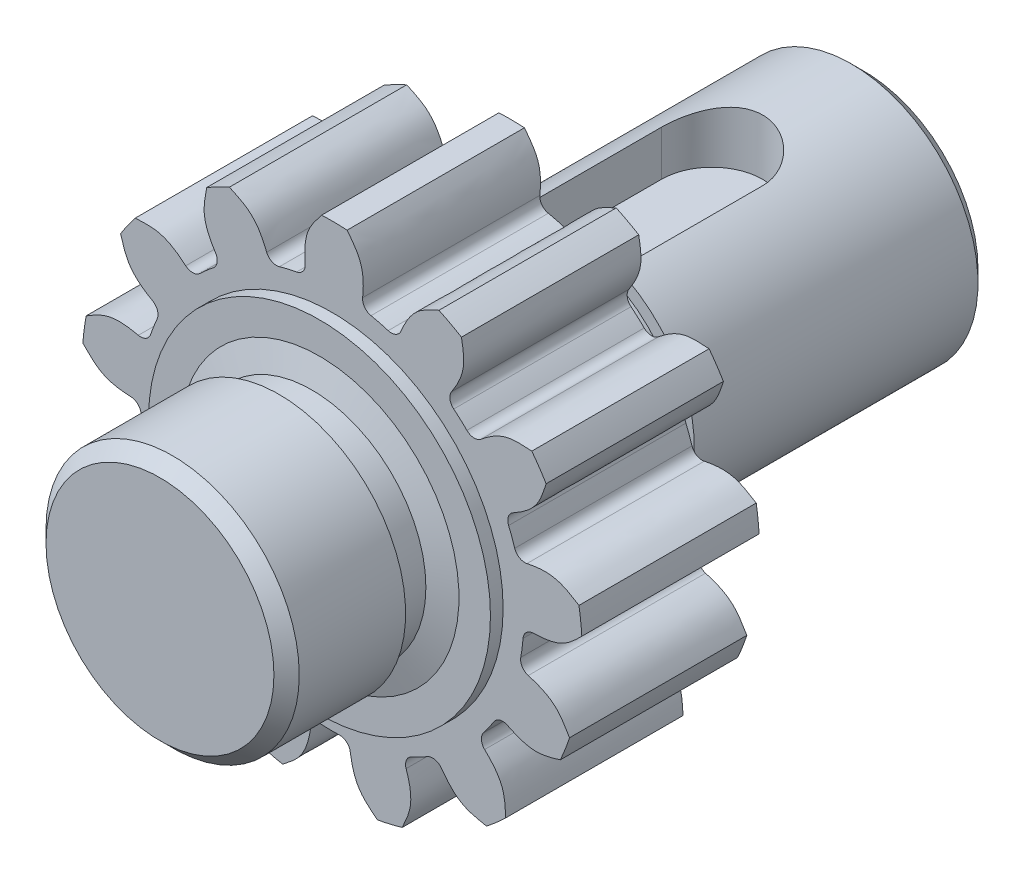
ISO-10303-21;
HEADER;
FILE_DESCRIPTION(('STEP AP214'),'2;1');
FILE_NAME('part.step','',(''),(''),'','','');
FILE_SCHEMA(('AUTOMOTIVE_DESIGN { 1 0 10303 214 1 1 1 1 }'));
ENDSEC;
DATA;
#1=APPLICATION_CONTEXT('core data for automotive mechanical design processes');
#2=APPLICATION_PROTOCOL_DEFINITION('international standard','automotive_design',2000,#1);
#3=PRODUCT_CONTEXT('',#1,'mechanical');
#4=PRODUCT('Part','Part','',(#3));
#5=PRODUCT_RELATED_PRODUCT_CATEGORY('part','',(#4));
#6=PRODUCT_DEFINITION_FORMATION('','',#4);
#7=PRODUCT_DEFINITION_CONTEXT('part definition',#1,'design');
#8=PRODUCT_DEFINITION('design','',#6,#7);
#9=PRODUCT_DEFINITION_SHAPE('','',#8);
#10=(LENGTH_UNIT() NAMED_UNIT(*) SI_UNIT(.MILLI.,.METRE.));
#11=(NAMED_UNIT(*) PLANE_ANGLE_UNIT() SI_UNIT($,.RADIAN.));
#12=(NAMED_UNIT(*) SI_UNIT($,.STERADIAN.) SOLID_ANGLE_UNIT());
#13=UNCERTAINTY_MEASURE_WITH_UNIT(LENGTH_MEASURE(1.E-05),#10,'distance_accuracy_value','');
#14=(GEOMETRIC_REPRESENTATION_CONTEXT(3) GLOBAL_UNCERTAINTY_ASSIGNED_CONTEXT((#13)) GLOBAL_UNIT_ASSIGNED_CONTEXT((#10,
#11,#12)) REPRESENTATION_CONTEXT('',''));
#15=CARTESIAN_POINT('',(0.,0.,0.));
#16=DIRECTION('',(0.,0.,1.));
#17=DIRECTION('',(1.,0.,0.));
#18=AXIS2_PLACEMENT_3D('',#15,#16,#17);
#19=CARTESIAN_POINT('',(0.,0.,7.));
#20=DIRECTION('',(0.,0.,-1.));
#21=DIRECTION('',(-1.,0.,0.));
#22=AXIS2_PLACEMENT_3D('',#19,#20,#21);
#23=CYLINDRICAL_SURFACE('',#22,7.5625);
#24=CARTESIAN_POINT('',(0.,0.,0.));
#25=DIRECTION('',(0.,0.,1.));
#26=DIRECTION('',(1.,0.,0.));
#27=AXIS2_PLACEMENT_3D('',#24,#25,#26);
#28=CIRCLE('',#27,7.5625);
#29=CARTESIAN_POINT('',(5.97799969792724,-4.63194622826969,0.));
#30=VERTEX_POINT('',#29);
#31=CARTESIAN_POINT('',(6.38065795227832,-4.05938546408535,0.));
#32=VERTEX_POINT('',#31);
#33=EDGE_CURVE('E1725',#30,#32,#28,.T.);
#34=ORIENTED_EDGE('',*,*,#33,.T.);
#35=DIRECTION('',(0.,0.,-1.));
#36=VECTOR('',#35,1.);
#37=CARTESIAN_POINT('',(6.38065795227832,-4.05938546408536,7.));
#38=LINE('',#37,#36);
#39=CARTESIAN_POINT('',(6.38065795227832,-4.05938546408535,7.));
#40=VERTEX_POINT('',#39);
#41=EDGE_CURVE('E1213',#32,#40,#38,.F.);
#42=ORIENTED_EDGE('',*,*,#41,.T.);
#43=CARTESIAN_POINT('',(0.,0.,7.));
#44=DIRECTION('',(0.,0.,1.));
#45=DIRECTION('',(1.,0.,0.));
#46=AXIS2_PLACEMENT_3D('',#43,#44,#45);
#47=CIRCLE('',#46,7.5625);
#48=CARTESIAN_POINT('',(5.97799969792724,-4.63194622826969,7.));
#49=VERTEX_POINT('',#48);
#50=EDGE_CURVE('E2473',#49,#40,#47,.T.);
#51=ORIENTED_EDGE('',*,*,#50,.F.);
#52=DIRECTION('',(0.,0.,-1.));
#53=VECTOR('',#52,1.);
#54=CARTESIAN_POINT('',(5.97799969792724,-4.63194622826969,7.));
#55=LINE('',#54,#53);
#56=EDGE_CURVE('E1200',#49,#30,#55,.T.);
#57=ORIENTED_EDGE('',*,*,#56,.T.);
#58=EDGE_LOOP('',(#34,#42,#51,#57));
#59=FACE_BOUND('',#58,.T.);
#60=ADVANCED_FACE('F351',(#59),#23,.T.);
#61=CARTESIAN_POINT('',(7.44582859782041,-1.32326971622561,7.));
#62=VERTEX_POINT('',#61);
#63=CARTESIAN_POINT('',(7.53628252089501,-0.629167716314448,7.));
#64=VERTEX_POINT('',#63);
#65=EDGE_CURVE('E1002',#62,#64,#47,.T.);
#66=ORIENTED_EDGE('',*,*,#65,.F.);
#67=DIRECTION('',(0.,0.,-1.));
#68=VECTOR('',#67,1.);
#69=CARTESIAN_POINT('',(7.44582859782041,-1.32326971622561,7.));
#70=LINE('',#69,#68);
#71=CARTESIAN_POINT('',(7.44582859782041,-1.32326971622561,0.));
#72=VERTEX_POINT('',#71);
#73=EDGE_CURVE('E1218',#62,#72,#70,.T.);
#74=ORIENTED_EDGE('',*,*,#73,.T.);
#75=CARTESIAN_POINT('',(7.53628252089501,-0.629167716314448,0.));
#76=VERTEX_POINT('',#75);
#77=EDGE_CURVE('E1005',#72,#76,#28,.T.);
#78=ORIENTED_EDGE('',*,*,#77,.T.);
#79=DIRECTION('',(0.,0.,-1.));
#80=VECTOR('',#79,1.);
#81=CARTESIAN_POINT('',(7.53628252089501,-0.629167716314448,7.));
#82=LINE('',#81,#80);
#83=EDGE_CURVE('E2454',#76,#64,#82,.F.);
#84=ORIENTED_EDGE('',*,*,#83,.T.);
#85=EDGE_LOOP('',(#66,#74,#78,#84));
#86=FACE_BOUND('',#85,.T.);
#87=ADVANCED_FACE('F969',(#86),#23,.T.);
#88=CARTESIAN_POINT('',(3.14068310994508,-6.8794996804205,0.));
#89=VERTEX_POINT('',#88);
#90=CARTESIAN_POINT('',(3.76330154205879,-6.55964692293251,0.));
#91=VERTEX_POINT('',#90);
#92=EDGE_CURVE('E2598',#89,#91,#28,.T.);
#93=ORIENTED_EDGE('',*,*,#92,.T.);
#94=DIRECTION('',(0.,0.,-1.));
#95=VECTOR('',#94,1.);
#96=CARTESIAN_POINT('',(3.76330154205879,-6.55964692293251,7.));
#97=LINE('',#96,#95);
#98=CARTESIAN_POINT('',(3.76330154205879,-6.55964692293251,7.));
#99=VERTEX_POINT('',#98);
#100=EDGE_CURVE('E1195',#91,#99,#97,.F.);
#101=ORIENTED_EDGE('',*,*,#100,.T.);
#102=CARTESIAN_POINT('',(3.14068310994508,-6.8794996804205,7.));
#103=VERTEX_POINT('',#102);
#104=EDGE_CURVE('E2475',#103,#99,#47,.T.);
#105=ORIENTED_EDGE('',*,*,#104,.F.);
#106=DIRECTION('',(0.,0.,-1.));
#107=VECTOR('',#106,1.);
#108=CARTESIAN_POINT('',(3.14068310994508,-6.8794996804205,7.));
#109=LINE('',#108,#107);
#110=EDGE_CURVE('E1182',#103,#89,#109,.T.);
#111=ORIENTED_EDGE('',*,*,#110,.T.);
#112=EDGE_LOOP('',(#93,#101,#105,#111));
#113=FACE_BOUND('',#112,.T.);
#114=ADVANCED_FACE('F975',(#113),#23,.T.);
#115=CARTESIAN_POINT('',(-0.416126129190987,-7.55104266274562,0.));
#116=VERTEX_POINT('',#115);
#117=CARTESIAN_POINT('',(0.283818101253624,-7.55717232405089,0.));
#118=VERTEX_POINT('',#117);
#119=EDGE_CURVE('E2594',#116,#118,#28,.T.);
#120=ORIENTED_EDGE('',*,*,#119,.T.);
#121=DIRECTION('',(0.,0.,-1.));
#122=VECTOR('',#121,1.);
#123=CARTESIAN_POINT('',(0.283818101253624,-7.5571723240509,7.));
#124=LINE('',#123,#122);
#125=CARTESIAN_POINT('',(0.283818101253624,-7.55717232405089,7.));
#126=VERTEX_POINT('',#125);
#127=EDGE_CURVE('E1177',#118,#126,#124,.F.);
#128=ORIENTED_EDGE('',*,*,#127,.T.);
#129=CARTESIAN_POINT('',(-0.416126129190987,-7.55104266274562,7.));
#130=VERTEX_POINT('',#129);
#131=EDGE_CURVE('E2479',#130,#126,#47,.T.);
#132=ORIENTED_EDGE('',*,*,#131,.F.);
#133=DIRECTION('',(0.,0.,-1.));
#134=VECTOR('',#133,1.);
#135=CARTESIAN_POINT('',(-0.416126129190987,-7.55104266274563,7.));
#136=LINE('',#135,#134);
#137=EDGE_CURVE('E1164',#130,#116,#136,.T.);
#138=ORIENTED_EDGE('',*,*,#137,.T.);
#139=EDGE_LOOP('',(#120,#128,#132,#138));
#140=FACE_BOUND('',#139,.T.);
#141=ADVANCED_FACE('F2342',(#140),#23,.T.);
#142=CARTESIAN_POINT('',(-3.87760588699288,-6.49273277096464,0.));
#143=VERTEX_POINT('',#142);
#144=CARTESIAN_POINT('',(-3.26068464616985,-6.82344061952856,0.));
#145=VERTEX_POINT('',#144);
#146=EDGE_CURVE('E2590',#143,#145,#28,.T.);
#147=ORIENTED_EDGE('',*,*,#146,.T.);
#148=DIRECTION('',(0.,0.,-1.));
#149=VECTOR('',#148,1.);
#150=CARTESIAN_POINT('',(-3.26068464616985,-6.82344061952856,7.));
#151=LINE('',#150,#149);
#152=CARTESIAN_POINT('',(-3.26068464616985,-6.82344061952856,7.));
#153=VERTEX_POINT('',#152);
#154=EDGE_CURVE('E1159',#145,#153,#151,.F.);
#155=ORIENTED_EDGE('',*,*,#154,.T.);
#156=CARTESIAN_POINT('',(-3.87760588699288,-6.49273277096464,7.));
#157=VERTEX_POINT('',#156);
#158=EDGE_CURVE('E2483',#157,#153,#47,.T.);
#159=ORIENTED_EDGE('',*,*,#158,.F.);
#160=DIRECTION('',(0.,0.,-1.));
#161=VECTOR('',#160,1.);
#162=CARTESIAN_POINT('',(-3.87760588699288,-6.49273277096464,7.));
#163=LINE('',#162,#161);
#164=EDGE_CURVE('E1146',#157,#143,#163,.T.);
#165=ORIENTED_EDGE('',*,*,#164,.T.);
#166=EDGE_LOOP('',(#147,#155,#159,#165));
#167=FACE_BOUND('',#166,.T.);
#168=ADVANCED_FACE('F2349',(#167),#23,.T.);
#169=CARTESIAN_POINT('',(-6.45077286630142,-3.94701604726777,0.));
#170=VERTEX_POINT('',#169);
#171=CARTESIAN_POINT('',(-6.05820383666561,-4.52654090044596,0.));
#172=VERTEX_POINT('',#171);
#173=EDGE_CURVE('E2586',#170,#172,#28,.T.);
#174=ORIENTED_EDGE('',*,*,#173,.T.);
#175=DIRECTION('',(0.,0.,-1.));
#176=VECTOR('',#175,1.);
#177=CARTESIAN_POINT('',(-6.05820383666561,-4.52654090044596,7.));
#178=LINE('',#177,#176);
#179=CARTESIAN_POINT('',(-6.05820383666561,-4.52654090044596,7.));
#180=VERTEX_POINT('',#179);
#181=EDGE_CURVE('E1141',#172,#180,#178,.F.);
#182=ORIENTED_EDGE('',*,*,#181,.T.);
#183=CARTESIAN_POINT('',(-6.45077286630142,-3.94701604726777,7.));
#184=VERTEX_POINT('',#183);
#185=EDGE_CURVE('E2487',#184,#180,#47,.T.);
#186=ORIENTED_EDGE('',*,*,#185,.F.);
#187=DIRECTION('',(0.,0.,-1.));
#188=VECTOR('',#187,1.);
#189=CARTESIAN_POINT('',(-6.45077286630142,-3.94701604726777,7.));
#190=LINE('',#189,#188);
#191=EDGE_CURVE('E1128',#184,#170,#190,.T.);
#192=ORIENTED_EDGE('',*,*,#191,.T.);
#193=EDGE_LOOP('',(#174,#182,#186,#192));
#194=FACE_BOUND('',#193,.T.);
#195=ADVANCED_FACE('F2356',(#194),#23,.T.);
#196=CARTESIAN_POINT('',(-7.54614552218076,-0.497085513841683,0.));
#197=VERTEX_POINT('',#196);
#198=CARTESIAN_POINT('',(-7.46786153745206,-1.19266521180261,0.));
#199=VERTEX_POINT('',#198);
#200=EDGE_CURVE('E2582',#197,#199,#28,.T.);
#201=ORIENTED_EDGE('',*,*,#200,.T.);
#202=DIRECTION('',(0.,0.,-1.));
#203=VECTOR('',#202,1.);
#204=CARTESIAN_POINT('',(-7.46786153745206,-1.19266521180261,7.));
#205=LINE('',#204,#203);
#206=CARTESIAN_POINT('',(-7.46786153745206,-1.19266521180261,7.));
#207=VERTEX_POINT('',#206);
#208=EDGE_CURVE('E1123',#199,#207,#205,.F.);
#209=ORIENTED_EDGE('',*,*,#208,.T.);
#210=CARTESIAN_POINT('',(-7.54614552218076,-0.497085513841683,7.));
#211=VERTEX_POINT('',#210);
#212=EDGE_CURVE('E2491',#211,#207,#47,.T.);
#213=ORIENTED_EDGE('',*,*,#212,.F.);
#214=DIRECTION('',(0.,0.,-1.));
#215=VECTOR('',#214,1.);
#216=CARTESIAN_POINT('',(-7.54614552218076,-0.497085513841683,7.));
#217=LINE('',#216,#215);
#218=EDGE_CURVE('E1110',#211,#197,#217,.T.);
#219=ORIENTED_EDGE('',*,*,#218,.T.);
#220=EDGE_LOOP('',(#201,#209,#213,#219));
#221=FACE_BOUND('',#220,.T.);
#222=ADVANCED_FACE('F2363',(#221),#23,.T.);
#223=CARTESIAN_POINT('',(-6.91278717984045,3.06672132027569,0.));
#224=VERTEX_POINT('',#223);
#225=CARTESIAN_POINT('',(-7.16672215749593,2.4144357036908,0.));
#226=VERTEX_POINT('',#225);
#227=EDGE_CURVE('E2578',#224,#226,#28,.T.);
#228=ORIENTED_EDGE('',*,*,#227,.T.);
#229=DIRECTION('',(0.,0.,-1.));
#230=VECTOR('',#229,1.);
#231=CARTESIAN_POINT('',(-7.16672215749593,2.4144357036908,7.));
#232=LINE('',#231,#230);
#233=CARTESIAN_POINT('',(-7.16672215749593,2.4144357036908,7.));
#234=VERTEX_POINT('',#233);
#235=EDGE_CURVE('E1105',#226,#234,#232,.F.);
#236=ORIENTED_EDGE('',*,*,#235,.T.);
#237=CARTESIAN_POINT('',(-6.91278717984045,3.06672132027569,7.));
#238=VERTEX_POINT('',#237);
#239=EDGE_CURVE('E2495',#238,#234,#47,.T.);
#240=ORIENTED_EDGE('',*,*,#239,.F.);
#241=DIRECTION('',(0.,0.,-1.));
#242=VECTOR('',#241,1.);
#243=CARTESIAN_POINT('',(-6.91278717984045,3.06672132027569,7.));
#244=LINE('',#243,#242);
#245=EDGE_CURVE('E1092',#238,#224,#244,.T.);
#246=ORIENTED_EDGE('',*,*,#245,.T.);
#247=EDGE_LOOP('',(#228,#236,#240,#246));
#248=FACE_BOUND('',#247,.T.);
#249=ADVANCED_FACE('F2370',(#248),#23,.T.);
#250=CARTESIAN_POINT('',(-4.69579260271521,5.92797925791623,0.));
#251=VERTEX_POINT('',#250);
#252=CARTESIAN_POINT('',(-5.22377309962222,5.46841849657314,0.));
#253=VERTEX_POINT('',#252);
#254=EDGE_CURVE('E2574',#251,#253,#28,.T.);
#255=ORIENTED_EDGE('',*,*,#254,.T.);
#256=DIRECTION('',(0.,0.,-1.));
#257=VECTOR('',#256,1.);
#258=CARTESIAN_POINT('',(-5.22377309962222,5.46841849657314,7.));
#259=LINE('',#258,#257);
#260=CARTESIAN_POINT('',(-5.22377309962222,5.46841849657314,7.));
#261=VERTEX_POINT('',#260);
#262=EDGE_CURVE('E1087',#253,#261,#259,.F.);
#263=ORIENTED_EDGE('',*,*,#262,.T.);
#264=CARTESIAN_POINT('',(-4.69579260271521,5.92797925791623,7.));
#265=VERTEX_POINT('',#264);
#266=EDGE_CURVE('E2499',#265,#261,#47,.T.);
#267=ORIENTED_EDGE('',*,*,#266,.F.);
#268=DIRECTION('',(0.,0.,-1.));
#269=VECTOR('',#268,1.);
#270=CARTESIAN_POINT('',(-4.69579260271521,5.92797925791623,7.));
#271=LINE('',#270,#269);
#272=EDGE_CURVE('E1074',#265,#251,#271,.T.);
#273=ORIENTED_EDGE('',*,*,#272,.T.);
#274=EDGE_LOOP('',(#255,#263,#267,#273));
#275=FACE_BOUND('',#274,.T.);
#276=ADVANCED_FACE('F2377',(#275),#23,.T.);
#277=CARTESIAN_POINT('',(-1.40304853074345,7.43120858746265,0.));
#278=VERTEX_POINT('',#277);
#279=CARTESIAN_POINT('',(-2.08412057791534,7.2696525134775,0.));
#280=VERTEX_POINT('',#279);
#281=EDGE_CURVE('E2570',#278,#280,#28,.T.);
#282=ORIENTED_EDGE('',*,*,#281,.T.);
#283=DIRECTION('',(0.,0.,-1.));
#284=VECTOR('',#283,1.);
#285=CARTESIAN_POINT('',(-2.08412057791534,7.26965251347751,7.));
#286=LINE('',#285,#284);
#287=CARTESIAN_POINT('',(-2.08412057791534,7.2696525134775,7.));
#288=VERTEX_POINT('',#287);
#289=EDGE_CURVE('E1069',#280,#288,#286,.F.);
#290=ORIENTED_EDGE('',*,*,#289,.T.);
#291=CARTESIAN_POINT('',(-1.40304853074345,7.43120858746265,7.));
#292=VERTEX_POINT('',#291);
#293=EDGE_CURVE('E2503',#292,#288,#47,.T.);
#294=ORIENTED_EDGE('',*,*,#293,.F.);
#295=DIRECTION('',(0.,0.,-1.));
#296=VECTOR('',#295,1.);
#297=CARTESIAN_POINT('',(-1.40304853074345,7.43120858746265,7.));
#298=LINE('',#297,#296);
#299=EDGE_CURVE('E1056',#292,#278,#298,.T.);
#300=ORIENTED_EDGE('',*,*,#299,.T.);
#301=EDGE_LOOP('',(#282,#290,#294,#300));
#302=FACE_BOUND('',#301,.T.);
#303=ADVANCED_FACE('F2384',(#302),#23,.T.);
#304=CARTESIAN_POINT('',(2.21111705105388,7.23203758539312,0.));
#305=VERTEX_POINT('',#304);
#306=CARTESIAN_POINT('',(1.53297885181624,7.40549674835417,0.));
#307=VERTEX_POINT('',#306);
#308=EDGE_CURVE('E2568',#305,#307,#28,.T.);
#309=ORIENTED_EDGE('',*,*,#308,.T.);
#310=DIRECTION('',(0.,0.,-1.));
#311=VECTOR('',#310,1.);
#312=CARTESIAN_POINT('',(1.53297885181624,7.40549674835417,7.));
#313=LINE('',#312,#311);
#314=CARTESIAN_POINT('',(1.53297885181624,7.40549674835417,7.));
#315=VERTEX_POINT('',#314);
#316=EDGE_CURVE('E1051',#307,#315,#313,.F.);
#317=ORIENTED_EDGE('',*,*,#316,.T.);
#318=CARTESIAN_POINT('',(2.21111705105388,7.23203758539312,7.));
#319=VERTEX_POINT('',#318);
#320=EDGE_CURVE('E2507',#319,#315,#47,.T.);
#321=ORIENTED_EDGE('',*,*,#320,.F.);
#322=DIRECTION('',(0.,0.,-1.));
#323=VECTOR('',#322,1.);
#324=CARTESIAN_POINT('',(2.21111705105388,7.23203758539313,7.));
#325=LINE('',#324,#323);
#326=EDGE_CURVE('E1038',#319,#305,#325,.T.);
#327=ORIENTED_EDGE('',*,*,#326,.T.);
#328=EDGE_LOOP('',(#309,#317,#321,#327));
#329=FACE_BOUND('',#328,.T.);
#330=ADVANCED_FACE('F989',(#329),#23,.T.);
#331=CARTESIAN_POINT('',(5.31874236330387,5.37609392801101,0.));
#332=VERTEX_POINT('',#331);
#333=CARTESIAN_POINT('',(4.7988913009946,5.84483092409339,0.));
#334=VERTEX_POINT('',#333);
#335=EDGE_CURVE('E1003',#332,#334,#28,.T.);
#336=ORIENTED_EDGE('',*,*,#335,.T.);
#337=DIRECTION('',(0.,0.,-1.));
#338=VECTOR('',#337,1.);
#339=CARTESIAN_POINT('',(4.7988913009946,5.84483092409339,7.));
#340=LINE('',#339,#338);
#341=CARTESIAN_POINT('',(4.7988913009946,5.84483092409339,7.));
#342=VERTEX_POINT('',#341);
#343=EDGE_CURVE('E1033',#334,#342,#340,.F.);
#344=ORIENTED_EDGE('',*,*,#343,.T.);
#345=CARTESIAN_POINT('',(5.31874236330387,5.37609392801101,7.));
#346=VERTEX_POINT('',#345);
#347=EDGE_CURVE('E2450',#346,#342,#47,.T.);
#348=ORIENTED_EDGE('',*,*,#347,.F.);
#349=DIRECTION('',(0.,0.,-1.));
#350=VECTOR('',#349,1.);
#351=CARTESIAN_POINT('',(5.31874236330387,5.37609392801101,7.));
#352=LINE('',#351,#350);
#353=EDGE_CURVE('E1017',#346,#332,#352,.T.);
#354=ORIENTED_EDGE('',*,*,#353,.T.);
#355=EDGE_LOOP('',(#336,#344,#348,#354));
#356=FACE_BOUND('',#355,.T.);
#357=ADVANCED_FACE('F980',(#356),#23,.T.);
#358=CARTESIAN_POINT('',(7.20790789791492,2.28855194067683,0.));
#359=VERTEX_POINT('',#358);
#360=CARTESIAN_POINT('',(6.96543558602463,2.94518477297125,0.));
#361=VERTEX_POINT('',#360);
#362=EDGE_CURVE('E993',#359,#361,#28,.T.);
#363=ORIENTED_EDGE('',*,*,#362,.T.);
#364=DIRECTION('',(0.,0.,-1.));
#365=VECTOR('',#364,1.);
#366=CARTESIAN_POINT('',(6.96543558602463,2.94518477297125,7.));
#367=LINE('',#366,#365);
#368=CARTESIAN_POINT('',(6.96543558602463,2.94518477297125,7.));
#369=VERTEX_POINT('',#368);
#370=EDGE_CURVE('E996',#361,#369,#367,.F.);
#371=ORIENTED_EDGE('',*,*,#370,.T.);
#372=CARTESIAN_POINT('',(7.20790789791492,2.28855194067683,7.));
#373=VERTEX_POINT('',#372);
#374=EDGE_CURVE('E2447',#373,#369,#47,.T.);
#375=ORIENTED_EDGE('',*,*,#374,.F.);
#376=DIRECTION('',(0.,0.,-1.));
#377=VECTOR('',#376,1.);
#378=CARTESIAN_POINT('',(7.20790789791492,2.28855194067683,7.));
#379=LINE('',#378,#377);
#380=EDGE_CURVE('E999',#373,#359,#379,.T.);
#381=ORIENTED_EDGE('',*,*,#380,.T.);
#382=EDGE_LOOP('',(#363,#371,#375,#381));
#383=FACE_BOUND('',#382,.T.);
#384=ADVANCED_FACE('F353',(#383),#23,.T.);
#385=CARTESIAN_POINT('',(0.,0.,7.));
#386=DIRECTION('',(0.,0.,1.));
#387=DIRECTION('',(1.,0.,0.));
#388=AXIS2_PLACEMENT_3D('',#385,#386,#387);
#389=PLANE('',#388);
#390=CARTESIAN_POINT('',(0.,0.,7.));
#391=DIRECTION('',(0.,0.,1.));
#392=DIRECTION('',(1.,0.,0.));
#393=AXIS2_PLACEMENT_3D('',#390,#391,#392);
#394=CIRCLE('',#393,6.75);
#395=CARTESIAN_POINT('',(6.75,0.,7.));
#396=VERTEX_POINT('',#395);
#397=EDGE_CURVE('E1227',#396,#396,#394,.T.);
#398=ORIENTED_EDGE('',*,*,#397,.F.);
#399=EDGE_LOOP('',(#398));
#400=FACE_BOUND('',#399,.T.);
#401=CARTESIAN_POINT('',(6.85483104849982,-7.1082287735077,7.));
#402=CARTESIAN_POINT('',(6.83891306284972,-6.78380023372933,7.));
#403=CARTESIAN_POINT('',(6.79756170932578,-5.9410077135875,7.));
#404=CARTESIAN_POINT('',(5.81593526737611,-4.95850978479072,7.));
#405=CARTESIAN_POINT('',(4.82843674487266,-4.18133451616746,7.));
#406=CARTESIAN_POINT('',(4.15695048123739,-4.22740336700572,7.));
#407=CARTESIAN_POINT('',(3.99690326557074,-4.23838377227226,7.));
#408=B_SPLINE_CURVE_WITH_KNOTS('',3,(#401,#402,#403,#404,#405,#406,#407),.UNSPECIFIED.,.F.,.F.,
(4,1,1,1,4),(0.,0.212967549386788,0.553241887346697,0.893516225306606,1.),.UNSPECIFIED.);
#409=CARTESIAN_POINT('',(6.85483104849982,-7.1082287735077,7.));
#410=VERTEX_POINT('',#409);
#411=CARTESIAN_POINT('',(6.01975265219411,-5.18854625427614,7.));
#412=VERTEX_POINT('',#411);
#413=EDGE_CURVE('E1348',#410,#412,#408,.T.);
#414=ORIENTED_EDGE('',*,*,#413,.T.);
#415=CARTESIAN_POINT('',(6.30731337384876,-4.88710904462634,7.));
#416=DIRECTION('',(0.,0.,1.));
#417=DIRECTION('',(1.,0.,0.));
#418=AXIS2_PLACEMENT_3D('',#415,#416,#417);
#419=CIRCLE('',#418,0.4166);
#420=EDGE_CURVE('E1206',#412,#49,#419,.F.);
#421=ORIENTED_EDGE('',*,*,#420,.T.);
#422=ORIENTED_EDGE('',*,*,#50,.T.);
#423=CARTESIAN_POINT('',(6.73215310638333,-4.28300728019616,7.));
#424=DIRECTION('',(0.,0.,1.));
#425=DIRECTION('',(1.,0.,0.));
#426=AXIS2_PLACEMENT_3D('',#423,#424,#425);
#427=CIRCLE('',#426,0.4166);
#428=CARTESIAN_POINT('',(6.91858468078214,-3.91045013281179,7.));
#429=VERTEX_POINT('',#428);
#430=EDGE_CURVE('E1222',#40,#429,#427,.F.);
#431=ORIENTED_EDGE('',*,*,#430,.T.);
#432=CARTESIAN_POINT('',(5.3403252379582,-2.32810203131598,7.));
#433=CARTESIAN_POINT('',(5.38411576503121,-2.48243307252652,7.));
#434=CARTESIAN_POINT('',(5.56784115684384,-3.12993683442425,7.));
#435=CARTESIAN_POINT('',(6.63317524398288,-3.79643365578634,7.));
#436=CARTESIAN_POINT('',(7.88974923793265,-4.38796932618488,7.));
#437=CARTESIAN_POINT('',(8.69687109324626,-4.14187284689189,7.));
#438=CARTESIAN_POINT('',(9.0075683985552,-4.04713930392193,7.));
#439=B_SPLINE_CURVE_WITH_KNOTS('',3,(#432,#433,#434,#435,#436,#437,#438),.UNSPECIFIED.,.F.,.F.,
(4,1,1,1,4),(0.,0.106483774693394,0.446758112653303,0.787032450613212,1.),.UNSPECIFIED.);
#440=CARTESIAN_POINT('',(9.0075683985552,-4.04713930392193,7.));
#441=VERTEX_POINT('',#440);
#442=EDGE_CURVE('E1318',#429,#441,#439,.T.);
#443=ORIENTED_EDGE('',*,*,#442,.T.);
#444=CARTESIAN_POINT('',(0.,0.,7.));
#445=DIRECTION('',(0.,0.,1.));
#446=DIRECTION('',(-0.885456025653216,0.464723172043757,0.));
#447=AXIS2_PLACEMENT_3D('',#444,#445,#446);
#448=CIRCLE('',#447,9.875);
#449=CARTESIAN_POINT('',(9.37301007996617,-3.10842517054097,7.));
#450=VERTEX_POINT('',#449);
#451=EDGE_CURVE('E1326',#441,#450,#448,.T.);
#452=ORIENTED_EDGE('',*,*,#451,.T.);
#453=CARTESIAN_POINT('',(9.37301007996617,-3.10842517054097,7.));
#454=CARTESIAN_POINT('',(9.20814594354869,-2.8285554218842,7.));
#455=CARTESIAN_POINT('',(8.77986592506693,-2.10151663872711,7.));
#456=CARTESIAN_POINT('',(7.45408932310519,-1.68774248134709,7.));
#457=CARTESIAN_POINT('',(6.21853144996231,-1.45850140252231,7.));
#458=CARTESIAN_POINT('',(5.64536915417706,-1.81134857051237,7.));
#459=CARTESIAN_POINT('',(5.5087572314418,-1.89544888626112,7.));
#460=B_SPLINE_CURVE_WITH_KNOTS('',3,(#453,#454,#455,#456,#457,#458,#459),.UNSPECIFIED.,.F.,.F.,
(4,1,1,1,4),(0.,0.212967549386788,0.553241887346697,0.893516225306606,1.),.UNSPECIFIED.);
#461=CARTESIAN_POINT('',(7.7414639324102,-1.79671099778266,7.));
#462=VERTEX_POINT('',#461);
#463=EDGE_CURVE('E1734',#450,#462,#460,.T.);
#464=ORIENTED_EDGE('',*,*,#463,.T.);
#465=CARTESIAN_POINT('',(7.85600144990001,-1.39616547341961,7.));
#466=DIRECTION('',(0.,0.,1.));
#467=DIRECTION('',(1.,0.,0.));
#468=AXIS2_PLACEMENT_3D('',#465,#466,#467);
#469=CIRCLE('',#468,0.4166);
#470=EDGE_CURVE('E374',#462,#62,#469,.F.);
#471=ORIENTED_EDGE('',*,*,#470,.T.);
#472=ORIENTED_EDGE('',*,*,#65,.T.);
#473=CARTESIAN_POINT('',(7.9514382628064,-0.663827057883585,7.));
#474=DIRECTION('',(0.,0.,1.));
#475=DIRECTION('',(1.,0.,0.));
#476=AXIS2_PLACEMENT_3D('',#473,#474,#475);
#477=CIRCLE('',#476,0.4166);
#478=CARTESIAN_POINT('',(7.94337928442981,-0.247305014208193,7.));
#479=VERTEX_POINT('',#478);
#480=EDGE_CURVE('E2460',#64,#479,#477,.F.);
#481=ORIENTED_EDGE('',*,*,#480,.T.);
#482=CARTESIAN_POINT('',(5.8105461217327,0.420340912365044,7.));
#483=CARTESIAN_POINT('',(5.92104191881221,0.304038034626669,7.));
#484=CARTESIAN_POINT('',(6.38463267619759,-0.183916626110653,7.));
#485=CARTESIAN_POINT('',(7.63767567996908,-0.278984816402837,7.));
#486=CARTESIAN_POINT('',(9.02521702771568,-0.218804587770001,7.));
#487=CARTESIAN_POINT('',(9.62552120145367,0.374191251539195,7.));
#488=CARTESIAN_POINT('',(9.85660513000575,0.602461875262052,7.));
#489=B_SPLINE_CURVE_WITH_KNOTS('',3,(#482,#483,#484,#485,#486,#487,#488),.UNSPECIFIED.,.F.,.F.,
(4,1,1,1,4),(0.,0.106483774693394,0.446758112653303,0.787032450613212,1.),.UNSPECIFIED.);
#490=CARTESIAN_POINT('',(9.85660513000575,0.60246187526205,7.));
#491=VERTEX_POINT('',#490);
#492=EDGE_CURVE('E1690',#479,#491,#489,.T.);
#493=ORIENTED_EDGE('',*,*,#492,.T.);
#494=CARTESIAN_POINT('',(0.,0.,7.));
#495=DIRECTION('',(0.,0.,1.));
#496=DIRECTION('',(-1.,0.,0.));
#497=AXIS2_PLACEMENT_3D('',#494,#495,#496);
#498=CIRCLE('',#497,9.875);
#499=CARTESIAN_POINT('',(9.74394545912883,1.60348117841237,7.));
#500=VERTEX_POINT('',#499);
#501=EDGE_CURVE('E1698',#491,#500,#498,.T.);
#502=ORIENTED_EDGE('',*,*,#501,.T.);
#503=CARTESIAN_POINT('',(9.74394545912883,1.60348117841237,7.));
#504=CARTESIAN_POINT('',(9.467903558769,1.77467734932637,7.));
#505=CARTESIAN_POINT('',(8.75080866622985,2.21940657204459,7.));
#506=CARTESIAN_POINT('',(7.38460134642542,1.96966628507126,7.));
#507=CARTESIAN_POINT('',(6.18403554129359,1.5984568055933,7.));
#508=CARTESIAN_POINT('',(5.84050178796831,1.01966435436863,7.));
#509=CARTESIAN_POINT('',(5.75862130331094,0.881710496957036,7.));
#510=B_SPLINE_CURVE_WITH_KNOTS('',3,(#503,#504,#505,#506,#507,#508,#509),.UNSPECIFIED.,.F.,.F.,
(4,1,1,1,4),(0.,0.212967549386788,0.553241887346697,0.893516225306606,1.),.UNSPECIFIED.);
#511=CARTESIAN_POINT('',(7.68969912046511,2.00672909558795,7.));
#512=VERTEX_POINT('',#511);
#513=EDGE_CURVE('E2433',#500,#512,#510,.T.);
#514=ORIENTED_EDGE('',*,*,#513,.T.);
#515=CARTESIAN_POINT('',(7.60497426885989,2.41462278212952,7.));
#516=DIRECTION('',(0.,0.,1.));
#517=DIRECTION('',(1.,0.,0.));
#518=AXIS2_PLACEMENT_3D('',#515,#516,#517);
#519=CIRCLE('',#518,0.4166);
#520=EDGE_CURVE('E2462',#512,#373,#519,.F.);
#521=ORIENTED_EDGE('',*,*,#520,.T.);
#522=ORIENTED_EDGE('',*,*,#374,.T.);
#523=CARTESIAN_POINT('',(7.34914473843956,3.10742794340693,7.));
#524=DIRECTION('',(0.,0.,1.));
#525=DIRECTION('',(1.,0.,0.));
#526=AXIS2_PLACEMENT_3D('',#523,#524,#525);
#527=CIRCLE('',#526,0.4166);
#528=CARTESIAN_POINT('',(7.14844142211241,3.47249470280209,7.));
#529=VERTEX_POINT('',#528);
#530=EDGE_CURVE('E1012',#369,#529,#527,.F.);
#531=ORIENTED_EDGE('',*,*,#530,.T.);
#532=CARTESIAN_POINT('',(4.94964091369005,3.07248881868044,7.));
#533=CARTESIAN_POINT('',(5.10152872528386,3.02085769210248,7.));
#534=CARTESIAN_POINT('',(5.73878179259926,2.80423666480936,7.));
#535=CARTESIAN_POINT('',(6.89247666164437,3.30237608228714,7.));
#536=CARTESIAN_POINT('',(8.093116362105,4.00048564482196,7.));
#537=CARTESIAN_POINT('',(8.34908040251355,4.8045326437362,7.));
#538=CARTESIAN_POINT('',(8.44761241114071,5.11404629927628,7.));
#539=B_SPLINE_CURVE_WITH_KNOTS('',3,(#532,#533,#534,#535,#536,#537,#538),.UNSPECIFIED.,.F.,.F.,
(4,1,1,1,4),(0.,0.106483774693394,0.446758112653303,0.787032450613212,1.),.UNSPECIFIED.);
#540=CARTESIAN_POINT('',(8.44761241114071,5.11404629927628,7.));
#541=VERTEX_POINT('',#540);
#542=EDGE_CURVE('E2549',#529,#541,#539,.T.);
#543=ORIENTED_EDGE('',*,*,#542,.T.);
#544=CARTESIAN_POINT('',(0.,0.,7.));
#545=DIRECTION('',(0.,0.,1.));
#546=DIRECTION('',(-0.885456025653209,-0.46472317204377,0.));
#547=AXIS2_PLACEMENT_3D('',#544,#545,#546);
#548=CIRCLE('',#547,9.875);
#549=CARTESIAN_POINT('',(7.88266036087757,5.94804931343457,7.));
#550=VERTEX_POINT('',#549);
#551=EDGE_CURVE('E1666',#541,#550,#548,.T.);
#552=ORIENTED_EDGE('',*,*,#551,.T.);
#553=CARTESIAN_POINT('',(7.88266036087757,5.94804931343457,7.));
#554=CARTESIAN_POINT('',(7.55867856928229,5.97135292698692,7.));
#555=CARTESIAN_POINT('',(6.7170466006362,6.03189048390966,7.));
#556=CARTESIAN_POINT('',(5.62339019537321,5.17584824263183,7.));
#557=CARTESIAN_POINT('',(4.73285161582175,4.28922782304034,7.));
#558=CARTESIAN_POINT('',(4.69764584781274,3.61708446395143,7.));
#559=CARTESIAN_POINT('',(4.68925463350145,3.45688063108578,7.));
#560=B_SPLINE_CURVE_WITH_KNOTS('',3,(#553,#554,#555,#556,#557,#558,#559),.UNSPECIFIED.,.F.,.F.,
(4,1,1,1,4),(0.,0.212967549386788,0.553241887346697,0.893516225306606,1.),.UNSPECIFIED.);
#561=CARTESIAN_POINT('',(5.87631691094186,5.35045173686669,7.));
#562=VERTEX_POINT('',#561);
#563=EDGE_CURVE('E1658',#550,#562,#560,.T.);
#564=ORIENTED_EDGE('',*,*,#563,.T.);
#565=CARTESIAN_POINT('',(5.61173913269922,5.67225005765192,7.));
#566=DIRECTION('',(0.,0.,1.));
#567=DIRECTION('',(1.,0.,0.));
#568=AXIS2_PLACEMENT_3D('',#565,#566,#567);
#569=CIRCLE('',#568,0.4166);
#570=EDGE_CURVE('E1026',#562,#346,#569,.F.);
#571=ORIENTED_EDGE('',*,*,#570,.T.);
#572=ORIENTED_EDGE('',*,*,#347,.T.);
#573=CARTESIAN_POINT('',(5.06325072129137,6.16680865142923,7.));
#574=DIRECTION('',(0.,0.,1.));
#575=DIRECTION('',(1.,0.,0.));
#576=AXIS2_PLACEMENT_3D('',#573,#574,#575);
#577=CIRCLE('',#576,0.4166);
#578=CARTESIAN_POINT('',(4.71588177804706,6.39678773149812,7.));
#579=VERTEX_POINT('',#578);
#580=EDGE_CURVE('E1042',#342,#579,#577,.F.);
#581=ORIENTED_EDGE('',*,*,#580,.T.);
#582=CARTESIAN_POINT('',(2.95483262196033,5.02076656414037,7.));
#583=CARTESIAN_POINT('',(3.11331678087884,5.04563525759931,7.));
#584=CARTESIAN_POINT('',(3.7782451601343,5.14997313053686,7.));
#585=CARTESIAN_POINT('',(4.56829430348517,6.12720241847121,7.));
#586=CARTESIAN_POINT('',(5.30698027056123,7.30331282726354,7.));
#587=CARTESIAN_POINT('',(5.15996590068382,8.13421350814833,7.));
#588=CARTESIAN_POINT('',(5.10337349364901,8.45406434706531,7.));
#589=B_SPLINE_CURVE_WITH_KNOTS('',3,(#582,#583,#584,#585,#586,#587,#588),.UNSPECIFIED.,.F.,.F.,
(4,1,1,1,4),(0.,0.106483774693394,0.446758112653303,0.787032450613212,1.),.UNSPECIFIED.);
#590=CARTESIAN_POINT('',(5.10337349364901,8.45406434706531,7.));
#591=VERTEX_POINT('',#590);
#592=EDGE_CURVE('E1628',#579,#591,#589,.T.);
#593=ORIENTED_EDGE('',*,*,#592,.T.);
#594=CARTESIAN_POINT('',(0.,0.,7.));
#595=DIRECTION('',(0.,0.,1.));
#596=DIRECTION('',(-0.568064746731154,-0.822983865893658,0.));
#597=AXIS2_PLACEMENT_3D('',#594,#595,#596);
#598=CIRCLE('',#597,9.875);
#599=CARTESIAN_POINT('',(4.21555277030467,8.92999103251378,7.));
#600=VERTEX_POINT('',#599);
#601=EDGE_CURVE('E1636',#591,#600,#598,.T.);
#602=ORIENTED_EDGE('',*,*,#601,.T.);
#603=CARTESIAN_POINT('',(4.21555277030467,8.92999103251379,7.));
#604=CARTESIAN_POINT('',(3.91785141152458,8.80006351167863,7.));
#605=CARTESIAN_POINT('',(3.1444901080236,8.46254097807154,7.));
#606=CARTESIAN_POINT('',(2.57392811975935,7.1963057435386,7.));
#607=CARTESIAN_POINT('',(2.1974284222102,5.99738843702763,7.));
#608=CARTESIAN_POINT('',(2.47861585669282,5.38587411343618,7.));
#609=CARTESIAN_POINT('',(2.54563623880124,5.24012107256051,7.));
#610=B_SPLINE_CURVE_WITH_KNOTS('',3,(#603,#604,#605,#606,#607,#608,#609),.UNSPECIFIED.,.F.,.F.,
(4,1,1,1,4),(0.,0.212967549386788,0.553241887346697,0.893516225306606,1.),.UNSPECIFIED.);
#611=CARTESIAN_POINT('',(2.71674131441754,7.46845036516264,7.));
#612=VERTEX_POINT('',#611);
#613=EDGE_CURVE('E2536',#600,#612,#610,.T.);
#614=ORIENTED_EDGE('',*,*,#613,.T.);
#615=CARTESIAN_POINT('',(2.33292219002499,7.63043320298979,7.));
#616=DIRECTION('',(0.,0.,1.));
#617=DIRECTION('',(1.,0.,0.));
#618=AXIS2_PLACEMENT_3D('',#615,#616,#617);
#619=CIRCLE('',#618,0.4166);
#620=EDGE_CURVE('E1044',#612,#319,#619,.F.);
#621=ORIENTED_EDGE('',*,*,#620,.T.);
#622=ORIENTED_EDGE('',*,*,#320,.T.);
#623=CARTESIAN_POINT('',(1.61742698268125,7.81344781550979,7.));
#624=DIRECTION('',(0.,0.,1.));
#625=DIRECTION('',(1.,0.,0.));
#626=AXIS2_PLACEMENT_3D('',#623,#624,#625);
#627=CIRCLE('',#626,0.4166);
#628=CARTESIAN_POINT('',(1.20297045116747,7.85565378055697,7.));
#629=VERTEX_POINT('',#628);
#630=EDGE_CURVE('E1060',#315,#629,#627,.F.);
#631=ORIENTED_EDGE('',*,*,#630,.T.);
#632=CARTESIAN_POINT('',(0.283107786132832,5.81884719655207,7.));
#633=CARTESIAN_POINT('',(0.411881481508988,5.91451859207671,7.));
#634=CARTESIAN_POINT('',(0.952158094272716,6.31591281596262,7.));
#635=CARTESIAN_POINT('',(1.19757077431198,7.54836052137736,7.));
#636=CARTESIAN_POINT('',(1.30507895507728,8.93303905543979,7.));
#637=CARTESIAN_POINT('',(0.788765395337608,9.60044408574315,7.));
#638=CARTESIAN_POINT('',(0.590013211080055,9.8573581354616,7.));
#639=B_SPLINE_CURVE_WITH_KNOTS('',3,(#632,#633,#634,#635,#636,#637,#638),.UNSPECIFIED.,.F.,.F.,
(4,1,1,1,4),(0.,0.106483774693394,0.446758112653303,0.787032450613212,1.),.UNSPECIFIED.);
#640=CARTESIAN_POINT('',(0.590013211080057,9.8573581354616,7.));
#641=VERTEX_POINT('',#640);
#642=EDGE_CURVE('E2780',#629,#641,#639,.T.);
#643=ORIENTED_EDGE('',*,*,#642,.T.);
#644=CARTESIAN_POINT('',(0.,0.,7.));
#645=DIRECTION('',(0.,0.,1.));
#646=DIRECTION('',(-0.12053668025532,-0.992708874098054,0.));
#647=AXIS2_PLACEMENT_3D('',#644,#645,#646);
#648=CIRCLE('',#647,9.875);
#649=CARTESIAN_POINT('',(-0.417287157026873,9.86617942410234,7.));
#650=VERTEX_POINT('',#649);
#651=EDGE_CURVE('E1604',#641,#650,#648,.T.);
#652=ORIENTED_EDGE('',*,*,#651,.T.);
#653=CARTESIAN_POINT('',(-0.417287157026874,9.86617942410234,7.));
#654=CARTESIAN_POINT('',(-0.620508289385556,9.61278559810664,7.));
#655=CARTESIAN_POINT('',(-1.14843117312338,8.95452531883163,7.));
#656=CARTESIAN_POINT('',(-1.0651898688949,7.56817632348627,7.));
#657=CARTESIAN_POINT('',(-0.841399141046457,6.33161963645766,7.));
#658=CARTESIAN_POINT('',(-0.308235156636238,5.92082491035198,7.));
#659=CARTESIAN_POINT('',(-0.18115673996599,5.82291292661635,7.));
#660=B_SPLINE_CURVE_WITH_KNOTS('',3,(#653,#654,#655,#656,#657,#658,#659),.UNSPECIFIED.,.F.,.F.,
(4,1,1,1,4),(0.,0.212967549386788,0.553241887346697,0.893516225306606,1.),.UNSPECIFIED.);
#661=CARTESIAN_POINT('',(-1.0652069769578,7.87551701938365,7.));
#662=VERTEX_POINT('',#661);
#663=EDGE_CURVE('E1596',#650,#662,#660,.T.);
#664=ORIENTED_EDGE('',*,*,#663,.T.);
#665=CARTESIAN_POINT('',(-1.48033911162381,7.84057605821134,7.));
#666=DIRECTION('',(0.,0.,1.));
#667=DIRECTION('',(1.,0.,0.));
#668=AXIS2_PLACEMENT_3D('',#665,#666,#667);
#669=CIRCLE('',#668,0.4166);
#670=EDGE_CURVE('E1062',#662,#292,#669,.F.);
#671=ORIENTED_EDGE('',*,*,#670,.T.);
#672=ORIENTED_EDGE('',*,*,#293,.T.);
#673=CARTESIAN_POINT('',(-2.19892978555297,7.67012024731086,7.));
#674=DIRECTION('',(0.,0.,1.));
#675=DIRECTION('',(1.,0.,0.));
#676=AXIS2_PLACEMENT_3D('',#673,#674,#675);
#677=CIRCLE('',#676,0.4166);
#678=CARTESIAN_POINT('',(-2.58552690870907,7.51488421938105,7.));
#679=VERTEX_POINT('',#678);
#680=EDGE_CURVE('E1078',#288,#679,#677,.F.);
#681=ORIENTED_EDGE('',*,*,#680,.T.);
#682=CARTESIAN_POINT('',(-2.45347363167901,5.28390006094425,7.));
#683=CARTESIAN_POINT('',(-2.38391090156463,5.4284569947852,7.));
#684=CARTESIAN_POINT('',(-2.09205691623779,6.034952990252,7.));
#685=CARTESIAN_POINT('',(-2.44750178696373,7.24028019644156,7.));
#686=CARTESIAN_POINT('',(-2.99580022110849,8.5163136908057,7.));
#687=CARTESIAN_POINT('',(-3.76313175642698,8.86732862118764,7.));
#688=CARTESIAN_POINT('',(-4.05851198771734,9.00244996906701,7.));
#689=B_SPLINE_CURVE_WITH_KNOTS('',3,(#682,#683,#684,#685,#686,#687,#688),.UNSPECIFIED.,.F.,.F.,
(4,1,1,1,4),(0.,0.106483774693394,0.446758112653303,0.787032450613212,1.),.UNSPECIFIED.);
#690=CARTESIAN_POINT('',(-4.05851198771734,9.00244996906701,7.));
#691=VERTEX_POINT('',#690);
#692=EDGE_CURVE('E1566',#679,#691,#689,.T.);
#693=ORIENTED_EDGE('',*,*,#692,.T.);
#694=CARTESIAN_POINT('',(0.,0.,7.));
#695=DIRECTION('',(0.,0.,1.));
#696=DIRECTION('',(0.35460488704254,-0.935016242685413,0.));
#697=AXIS2_PLACEMENT_3D('',#694,#695,#696);
#698=CIRCLE('',#697,9.875);
#699=CARTESIAN_POINT('',(-4.95453162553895,8.54214500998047,7.));
#700=VERTEX_POINT('',#699);
#701=EDGE_CURVE('E1574',#691,#700,#698,.T.);
#702=ORIENTED_EDGE('',*,*,#701,.T.);
#703=CARTESIAN_POINT('',(-4.95453162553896,8.54214500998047,7.));
#704=CARTESIAN_POINT('',(-5.01671701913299,8.22333435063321,7.));
#705=CARTESIAN_POINT('',(-5.17826071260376,7.39513582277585,7.));
#706=CARTESIAN_POINT('',(-4.46028569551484,6.20626891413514,7.));
#707=CARTESIAN_POINT('',(-3.68747230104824,5.2153530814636,7.));
#708=CARTESIAN_POINT('',(-3.02447321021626,5.09938607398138,7.));
#709=CARTESIAN_POINT('',(-2.8664488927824,5.0717456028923,7.));
#710=B_SPLINE_CURVE_WITH_KNOTS('',3,(#703,#704,#705,#706,#707,#708,#709),.UNSPECIFIED.,.F.,.F.,
(4,1,1,1,4),(0.,0.212967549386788,0.553241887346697,0.893516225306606,1.),.UNSPECIFIED.);
#711=CARTESIAN_POINT('',(-4.60312918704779,6.47839763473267,7.));
#712=VERTEX_POINT('',#711);
#713=EDGE_CURVE('E2752',#700,#712,#710,.T.);
#714=ORIENTED_EDGE('',*,*,#713,.T.);
#715=CARTESIAN_POINT('',(-4.95447256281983,6.25453742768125,7.));
#716=DIRECTION('',(0.,0.,1.));
#717=DIRECTION('',(1.,0.,0.));
#718=AXIS2_PLACEMENT_3D('',#715,#716,#717);
#719=CIRCLE('',#718,0.4166);
#720=EDGE_CURVE('E1080',#712,#265,#719,.F.);
#721=ORIENTED_EDGE('',*,*,#720,.T.);
#722=ORIENTED_EDGE('',*,*,#266,.T.);
#723=CARTESIAN_POINT('',(-5.51153823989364,5.76966056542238,7.));
#724=DIRECTION('',(0.,0.,1.));
#725=DIRECTION('',(1.,0.,0.));
#726=AXIS2_PLACEMENT_3D('',#723,#724,#725);
#727=CIRCLE('',#726,0.4166);
#728=CARTESIAN_POINT('',(-5.78171121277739,5.45254524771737,7.));
#729=VERTEX_POINT('',#728);
#730=EDGE_CURVE('E1096',#261,#729,#727,.F.);
#731=ORIENTED_EDGE('',*,*,#730,.T.);
#732=CARTESIAN_POINT('',(-4.62799380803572,3.53847509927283,7.));
#733=CARTESIAN_POINT('',(-4.63357802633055,3.69880131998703,7.));
#734=CARTESIAN_POINT('',(-4.65700689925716,4.37145816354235,7.));
#735=CARTESIAN_POINT('',(-5.53188118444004,5.27353893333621,7.));
#736=CARTESIAN_POINT('',(-6.61037766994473,6.14860349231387,7.));
#737=CARTESIAN_POINT('',(-7.45294077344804,6.10281503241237,7.));
#738=CARTESIAN_POINT('',(-7.77728100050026,6.08518900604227,7.));
#739=B_SPLINE_CURVE_WITH_KNOTS('',3,(#732,#733,#734,#735,#736,#737,#738),.UNSPECIFIED.,.F.,.F.,
(4,1,1,1,4),(0.,0.106483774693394,0.446758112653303,0.787032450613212,1.),.UNSPECIFIED.);
#740=CARTESIAN_POINT('',(-7.77728100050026,6.08518900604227,7.));
#741=VERTEX_POINT('',#740);
#742=EDGE_CURVE('E2742',#729,#741,#739,.T.);
#743=ORIENTED_EDGE('',*,*,#742,.T.);
#744=CARTESIAN_POINT('',(0.,0.,7.));
#745=DIRECTION('',(0.,0.,1.));
#746=DIRECTION('',(0.748510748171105,-0.663122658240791,0.));
#747=AXIS2_PLACEMENT_3D('',#744,#745,#746);
#748=CIRCLE('',#747,9.875);
#749=CARTESIAN_POINT('',(-8.35675260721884,5.26120811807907,7.));
#750=VERTEX_POINT('',#749);
#751=EDGE_CURVE('E1542',#741,#750,#748,.T.);
#752=ORIENTED_EDGE('',*,*,#751,.T.);
#753=CARTESIAN_POINT('',(-8.35675260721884,5.26120811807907,7.));
#754=CARTESIAN_POINT('',(-8.26365633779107,4.95001630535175,7.));
#755=CARTESIAN_POINT('',(-8.02181312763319,4.14160983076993,7.));
#756=CARTESIAN_POINT('',(-6.83358382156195,3.42258009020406,7.));
#757=CARTESIAN_POINT('',(-5.68878999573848,2.9043119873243,7.));
#758=CARTESIAN_POINT('',(-5.04784090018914,3.10973934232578,7.));
#759=CARTESIAN_POINT('',(-4.89507214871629,3.15870248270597,7.));
#760=B_SPLINE_CURVE_WITH_KNOTS('',3,(#753,#754,#755,#756,#757,#758,#759),.UNSPECIFIED.,.F.,.F.,
(4,1,1,1,4),(0.,0.212967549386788,0.553241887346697,0.893516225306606,1.),.UNSPECIFIED.);
#761=CARTESIAN_POINT('',(-7.08652997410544,3.59715542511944,7.));
#762=VERTEX_POINT('',#761);
#763=EDGE_CURVE('E1534',#750,#762,#760,.T.);
#764=ORIENTED_EDGE('',*,*,#763,.T.);
#765=CARTESIAN_POINT('',(-7.29359605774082,3.23565964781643,7.));
#766=DIRECTION('',(0.,0.,1.));
#767=DIRECTION('',(1.,0.,0.));
#768=AXIS2_PLACEMENT_3D('',#765,#766,#767);
#769=CIRCLE('',#768,0.4166);
#770=EDGE_CURVE('E1098',#762,#238,#769,.F.);
#771=ORIENTED_EDGE('',*,*,#770,.T.);
#772=ORIENTED_EDGE('',*,*,#239,.T.);
#773=CARTESIAN_POINT('',(-7.56151970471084,2.54744117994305,7.));
#774=DIRECTION('',(0.,0.,1.));
#775=DIRECTION('',(1.,0.,0.));
#776=AXIS2_PLACEMENT_3D('',#773,#774,#775);
#777=CIRCLE('',#776,0.4166);
#778=CARTESIAN_POINT('',(-7.65337515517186,2.14109387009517,7.));
#779=VERTEX_POINT('',#778);
#780=EDGE_CURVE('E1114',#234,#779,#777,.F.);
#781=ORIENTED_EDGE('',*,*,#780,.T.);
#782=CARTESIAN_POINT('',(-5.74229637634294,0.982428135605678,7.));
#783=CARTESIAN_POINT('',(-5.82174826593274,1.12179483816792,7.));
#784=CARTESIAN_POINT('',(-6.15509272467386,1.70651495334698,7.));
#785=CARTESIAN_POINT('',(-7.34897326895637,2.09869345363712,7.));
#786=CARTESIAN_POINT('',(-8.71059725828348,2.37232233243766,7.));
#787=CARTESIAN_POINT('',(-9.43537087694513,1.9402200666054,7.));
#788=CARTESIAN_POINT('',(-9.71436866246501,1.77388457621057,7.));
#789=B_SPLINE_CURVE_WITH_KNOTS('',3,(#782,#783,#784,#785,#786,#787,#788),.UNSPECIFIED.,.F.,.F.,
(4,1,1,1,4),(0.,0.106483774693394,0.446758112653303,0.787032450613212,1.),.UNSPECIFIED.);
#790=CARTESIAN_POINT('',(-9.71436866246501,1.77388457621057,7.));
#791=VERTEX_POINT('',#790);
#792=EDGE_CURVE('E1504',#779,#791,#789,.T.);
#793=ORIENTED_EDGE('',*,*,#792,.T.);
#794=CARTESIAN_POINT('',(0.,0.,7.));
#795=DIRECTION('',(0.,0.,1.));
#796=DIRECTION('',(0.970941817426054,-0.239315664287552,0.));
#797=AXIS2_PLACEMENT_3D('',#794,#795,#796);
#798=CIRCLE('',#797,9.875);
#799=CARTESIAN_POINT('',(-9.84454227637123,0.774991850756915,7.));
#800=VERTEX_POINT('',#799);
#801=EDGE_CURVE('E1512',#791,#800,#798,.T.);
#802=ORIENTED_EDGE('',*,*,#801,.T.);
#803=CARTESIAN_POINT('',(-9.84454227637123,0.774991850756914,7.));
#804=CARTESIAN_POINT('',(-9.61749157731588,0.54270917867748,7.));
#805=CARTESIAN_POINT('',(-9.02766482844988,-0.0607090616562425,7.));
#806=CARTESIAN_POINT('',(-7.6413902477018,-0.145180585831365,7.));
#807=CARTESIAN_POINT('',(-6.38687445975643,-0.0720719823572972,7.));
#808=CARTESIAN_POINT('',(-5.91480907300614,0.407688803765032,7.));
#809=CARTESIAN_POINT('',(-5.8022933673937,0.522038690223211,7.));
#810=B_SPLINE_CURVE_WITH_KNOTS('',3,(#803,#804,#805,#806,#807,#808,#809),.UNSPECIFIED.,.F.,.F.,
(4,1,1,1,4),(0.,0.212967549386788,0.553241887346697,0.893516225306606,1.),.UNSPECIFIED.);
#811=CARTESIAN_POINT('',(-7.9464921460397,-0.108151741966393,7.));
#812=VERTEX_POINT('',#811);
#813=EDGE_CURVE('E2714',#800,#812,#810,.T.);
#814=ORIENTED_EDGE('',*,*,#813,.T.);
#815=CARTESIAN_POINT('',(-7.96184459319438,-0.524468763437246,7.));
#816=DIRECTION('',(0.,0.,1.));
#817=DIRECTION('',(1.,0.,0.));
#818=AXIS2_PLACEMENT_3D('',#815,#816,#817);
#819=CIRCLE('',#818,0.4166);
#820=EDGE_CURVE('E1116',#812,#211,#819,.F.);
#821=ORIENTED_EDGE('',*,*,#820,.T.);
#822=ORIENTED_EDGE('',*,*,#212,.T.);
#823=CARTESIAN_POINT('',(-7.87924813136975,-1.258366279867,7.));
#824=DIRECTION('',(0.,0.,1.));
#825=DIRECTION('',(1.,0.,0.));
#826=AXIS2_PLACEMENT_3D('',#823,#824,#825);
#827=CIRCLE('',#826,0.4166);
#828=CARTESIAN_POINT('',(-7.77174308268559,-1.66085631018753,7.));
#829=VERTEX_POINT('',#828);
#830=EDGE_CURVE('E1132',#207,#829,#827,.F.);
#831=ORIENTED_EDGE('',*,*,#830,.T.);
#832=CARTESIAN_POINT('',(-5.54110804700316,-1.79868127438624,7.));
#833=CARTESIAN_POINT('',(-5.67622613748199,-1.71220132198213,7.));
#834=CARTESIAN_POINT('',(-6.24312098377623,-1.34937026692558,7.));
#835=CARTESIAN_POINT('',(-7.48250414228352,-1.55693740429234,7.));
#836=CARTESIAN_POINT('',(-8.81532398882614,-1.94742928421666,7.));
#837=CARTESIAN_POINT('',(-9.25627122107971,-2.66685593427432,7.));
#838=CARTESIAN_POINT('',(-9.42601153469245,-2.94379543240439,7.));
#839=B_SPLINE_CURVE_WITH_KNOTS('',3,(#832,#833,#834,#835,#836,#837,#838),.UNSPECIFIED.,.F.,.F.,
(4,1,1,1,4),(0.,0.106483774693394,0.446758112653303,0.787032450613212,1.),.UNSPECIFIED.);
#840=CARTESIAN_POINT('',(-9.42601153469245,-2.94379543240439,7.));
#841=VERTEX_POINT('',#840);
#842=EDGE_CURVE('E2704',#829,#841,#839,.T.);
#843=ORIENTED_EDGE('',*,*,#842,.T.);
#844=CARTESIAN_POINT('',(0.,0.,7.));
#845=DIRECTION('',(0.,0.,1.));
#846=DIRECTION('',(0.97094181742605,0.239315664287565,0.));
#847=AXIS2_PLACEMENT_3D('',#844,#845,#846);
#848=CIRCLE('',#847,9.875);
#849=CARTESIAN_POINT('',(-9.07706594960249,-3.88876570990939,7.));
#850=VERTEX_POINT('',#849);
#851=EDGE_CURVE('E1480',#841,#850,#848,.T.);
#852=ORIENTED_EDGE('',*,*,#851,.T.);
#853=CARTESIAN_POINT('',(-9.07706594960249,-3.88876570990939,7.));
#854=CARTESIAN_POINT('',(-8.7680753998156,-3.9889260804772,7.));
#855=CARTESIAN_POINT('',(-7.96538731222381,-4.24912023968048,7.));
#856=CARTESIAN_POINT('',(-6.6986462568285,-3.67968213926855,7.));
#857=CARTESIAN_POINT('',(-5.62180295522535,-3.03194512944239,7.));
#858=CARTESIAN_POINT('',(-5.42676576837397,-2.38775832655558,7.));
#859=CARTESIAN_POINT('',(-5.3802791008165,-2.23421787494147,7.));
#860=B_SPLINE_CURVE_WITH_KNOTS('',3,(#853,#854,#855,#856,#857,#858,#859),.UNSPECIFIED.,.F.,.F.,
(4,1,1,1,4),(0.,0.212967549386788,0.553241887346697,0.893516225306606,1.),.UNSPECIFIED.);
#861=CARTESIAN_POINT('',(-6.98600873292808,-3.78868264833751,7.));
#862=VERTEX_POINT('',#861);
#863=EDGE_CURVE('E1472',#850,#862,#860,.T.);
#864=ORIENTED_EDGE('',*,*,#863,.T.);
#865=CARTESIAN_POINT('',(-6.80613048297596,-4.16444770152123,7.));
#866=DIRECTION('',(0.,0.,1.));
#867=DIRECTION('',(1.,0.,0.));
#868=AXIS2_PLACEMENT_3D('',#865,#866,#867);
#869=CIRCLE('',#868,0.4166);
#870=EDGE_CURVE('E1134',#862,#184,#869,.F.);
#871=ORIENTED_EDGE('',*,*,#870,.T.);
#872=ORIENTED_EDGE('',*,*,#185,.T.);
#873=CARTESIAN_POINT('',(-6.39193576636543,-4.77589718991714,7.));
#874=DIRECTION('',(0.,0.,1.));
#875=DIRECTION('',(1.,0.,0.));
#876=AXIS2_PLACEMENT_3D('',#873,#874,#875);
#877=CIRCLE('',#876,0.4166);
#878=CARTESIAN_POINT('',(-6.10969832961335,-5.08232432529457,7.));
#879=VERTEX_POINT('',#878);
#880=EDGE_CURVE('E1150',#180,#879,#877,.F.);
#881=ORIENTED_EDGE('',*,*,#880,.T.);
#882=CARTESIAN_POINT('',(-4.07051864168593,-4.16773448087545,7.));
#883=CARTESIAN_POINT('',(-4.2303490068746,-4.15395279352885,7.));
#884=CARTESIAN_POINT('',(-4.90092546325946,-4.09613102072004,7.));
#885=CARTESIAN_POINT('',(-5.90188349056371,-4.85589266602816,7.));
#886=CARTESIAN_POINT('',(-6.9005662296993,-5.82104832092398,7.));
#887=CARTESIAN_POINT('',(-6.95667137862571,-6.66298737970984,7.));
#888=CARTESIAN_POINT('',(-6.97826876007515,-6.9870873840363,7.));
#889=B_SPLINE_CURVE_WITH_KNOTS('',3,(#882,#883,#884,#885,#886,#887,#888),.UNSPECIFIED.,.F.,.F.,
(4,1,1,1,4),(0.,0.106483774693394,0.446758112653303,0.787032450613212,1.),.UNSPECIFIED.);
#890=CARTESIAN_POINT('',(-6.97826876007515,-6.9870873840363,7.));
#891=VERTEX_POINT('',#890);
#892=EDGE_CURVE('E1442',#879,#891,#889,.T.);
#893=ORIENTED_EDGE('',*,*,#892,.T.);
#894=CARTESIAN_POINT('',(0.,0.,7.));
#895=DIRECTION('',(0.,0.,1.));
#896=DIRECTION('',(0.748510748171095,0.663122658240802,0.));
#897=AXIS2_PLACEMENT_3D('',#894,#895,#896);
#898=CIRCLE('',#897,9.875);
#899=CARTESIAN_POINT('',(-6.23014320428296,-7.66165391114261,7.));
#900=VERTEX_POINT('',#899);
#901=EDGE_CURVE('E1450',#891,#900,#898,.T.);
#902=ORIENTED_EDGE('',*,*,#901,.T.);
#903=CARTESIAN_POINT('',(-6.23014320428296,-7.66165391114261,7.));
#904=CARTESIAN_POINT('',(-5.90999881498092,-7.60674644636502,7.));
#905=CARTESIAN_POINT('',(-5.0783355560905,-7.46410917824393,7.));
#906=CARTESIAN_POINT('',(-4.22132313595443,-6.3712128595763,7.));
#907=CARTESIAN_POINT('',(-3.56884414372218,-5.29723618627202,7.));
#908=CARTESIAN_POINT('',(-3.69551582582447,-4.63619879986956,7.));
#909=CARTESIAN_POINT('',(-3.72570773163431,-4.47864205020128,7.));
#910=B_SPLINE_CURVE_WITH_KNOTS('',3,(#903,#904,#905,#906,#907,#908,#909),.UNSPECIFIED.,.F.,.F.,
(4,1,1,1,4),(0.,0.212967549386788,0.553241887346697,0.893516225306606,1.),.UNSPECIFIED.);
#911=CARTESIAN_POINT('',(-4.42511490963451,-6.60127201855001,7.));
#912=VERTEX_POINT('',#911);
#913=EDGE_CURVE('E2676',#900,#912,#910,.T.);
#914=ORIENTED_EDGE('',*,*,#913,.T.);
#915=CARTESIAN_POINT('',(-4.09121390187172,-6.85040185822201,7.));
#916=DIRECTION('',(0.,0.,1.));
#917=DIRECTION('',(1.,0.,0.));
#918=AXIS2_PLACEMENT_3D('',#915,#916,#917);
#919=CIRCLE('',#918,0.4166);
#920=EDGE_CURVE('E1152',#912,#157,#919,.F.);
#921=ORIENTED_EDGE('',*,*,#920,.T.);
#922=ORIENTED_EDGE('',*,*,#158,.T.);
#923=CARTESIAN_POINT('',(-3.44030794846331,-7.19932760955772,7.));
#924=DIRECTION('',(0.,0.,1.));
#925=DIRECTION('',(1.,0.,0.));
#926=AXIS2_PLACEMENT_3D('',#923,#924,#925);
#927=CIRCLE('',#926,0.4166);
#928=CARTESIAN_POINT('',(-3.04799531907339,-7.3394930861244,7.));
#929=VERTEX_POINT('',#928);
#930=EDGE_CURVE('E1168',#153,#929,#927,.F.);
#931=ORIENTED_EDGE('',*,*,#930,.T.);
#932=CARTESIAN_POINT('',(-1.66742247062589,-5.5820099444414,7.));
#933=CARTESIAN_POINT('',(-1.81534990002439,-5.64408374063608,7.));
#934=CARTESIAN_POINT('',(-2.43598698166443,-5.9045175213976,7.));
#935=CARTESIAN_POINT('',(-2.96921245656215,-7.04242143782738,7.));
#936=CARTESIAN_POINT('',(-3.40497190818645,-8.3611353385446,7.));
#937=CARTESIAN_POINT('',(-3.06338196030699,-9.1327087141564,7.));
#938=CARTESIAN_POINT('',(-2.93188870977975,-9.42972181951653,7.));
#939=B_SPLINE_CURVE_WITH_KNOTS('',3,(#932,#933,#934,#935,#936,#937,#938),.UNSPECIFIED.,.F.,.F.,
(4,1,1,1,4),(0.,0.106483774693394,0.446758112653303,0.787032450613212,1.),.UNSPECIFIED.);
#940=CARTESIAN_POINT('',(-2.93188870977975,-9.42972181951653,7.));
#941=VERTEX_POINT('',#940);
#942=EDGE_CURVE('E2666',#929,#941,#939,.T.);
#943=ORIENTED_EDGE('',*,*,#942,.T.);
#944=CARTESIAN_POINT('',(0.,0.,7.));
#945=DIRECTION('',(0.,0.,1.));
#946=DIRECTION('',(0.354604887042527,0.935016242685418,0.));
#947=AXIS2_PLACEMENT_3D('',#944,#945,#946);
#948=CIRCLE('',#947,9.875);
#949=CARTESIAN_POINT('',(-1.955969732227,-9.67934953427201,7.));
#950=VERTEX_POINT('',#949);
#951=EDGE_CURVE('E1418',#941,#950,#948,.T.);
#952=ORIENTED_EDGE('',*,*,#951,.T.);
#953=CARTESIAN_POINT('',(-1.955969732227,-9.67934953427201,7.));
#954=CARTESIAN_POINT('',(-1.69801272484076,-9.48195287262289,7.));
#955=CARTESIAN_POINT('',(-1.02789832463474,-8.96916065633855,7.));
#956=CARTESIAN_POINT('',(-0.776945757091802,-7.60317549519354,7.));
#957=CARTESIAN_POINT('',(-0.698306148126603,-6.34899427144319,7.));
#958=CARTESIAN_POINT('',(-1.11766774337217,-5.82254200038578,7.));
#959=CARTESIAN_POINT('',(-1.2176216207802,-5.69706330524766,7.));
#960=B_SPLINE_CURVE_WITH_KNOTS('',3,(#953,#954,#955,#956,#957,#958,#959),.UNSPECIFIED.,.F.,.F.,
(4,1,1,1,4),(0.,0.212967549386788,0.553241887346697,0.893516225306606,1.),.UNSPECIFIED.);
#961=CARTESIAN_POINT('',(-0.850480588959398,-7.90158952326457,7.));
#962=VERTEX_POINT('',#961);
#963=EDGE_CURVE('E1410',#950,#962,#960,.T.);
#964=ORIENTED_EDGE('',*,*,#963,.T.);
#965=CARTESIAN_POINT('',(-0.439049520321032,-7.96701150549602,7.));
#966=DIRECTION('',(0.,0.,1.));
#967=DIRECTION('',(1.,0.,0.));
#968=AXIS2_PLACEMENT_3D('',#965,#966,#967);
#969=CIRCLE('',#968,0.4166);
#970=EDGE_CURVE('E1170',#962,#130,#969,.F.);
#971=ORIENTED_EDGE('',*,*,#970,.T.);
#972=ORIENTED_EDGE('',*,*,#131,.T.);
#973=CARTESIAN_POINT('',(0.299452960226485,-7.97347883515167,7.));
#974=DIRECTION('',(0.,0.,1.));
#975=DIRECTION('',(1.,0.,0.));
#976=AXIS2_PLACEMENT_3D('',#973,#974,#975);
#977=CIRCLE('',#976,0.4166);
#978=CARTESIAN_POINT('',(0.71196668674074,-7.91527243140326,7.));
#979=VERTEX_POINT('',#978);
#980=EDGE_CURVE('E1186',#126,#979,#977,.F.);
#981=ORIENTED_EDGE('',*,*,#980,.T.);
#982=CARTESIAN_POINT('',(1.11766009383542,-5.7175142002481,7.));
#983=CARTESIAN_POINT('',(1.01552399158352,-5.84122312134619,7.));
#984=CARTESIAN_POINT('',(0.587006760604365,-6.36025021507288,7.));
#985=CARTESIAN_POINT('',(0.64366936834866,-7.61561632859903,7.));
#986=CARTESIAN_POINT('',(0.870660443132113,-8.98578701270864,7.));
#987=CARTESIAN_POINT('',(1.53169134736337,-9.51023654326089,7.));
#988=CARTESIAN_POINT('',(1.78615171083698,-9.71212062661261,7.));
#989=B_SPLINE_CURVE_WITH_KNOTS('',3,(#982,#983,#984,#985,#986,#987,#988),.UNSPECIFIED.,.F.,.F.,
(4,1,1,1,4),(0.,0.106483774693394,0.446758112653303,0.787032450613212,1.),.UNSPECIFIED.);
#990=CARTESIAN_POINT('',(1.78615171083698,-9.71212062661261,7.));
#991=VERTEX_POINT('',#990);
#992=EDGE_CURVE('E1380',#979,#991,#989,.T.);
#993=ORIENTED_EDGE('',*,*,#992,.T.);
#994=CARTESIAN_POINT('',(0.,0.,7.));
#995=DIRECTION('',(0.,0.,1.));
#996=DIRECTION('',(-0.120536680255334,0.992708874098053,0.));
#997=AXIS2_PLACEMENT_3D('',#994,#995,#996);
#998=CIRCLE('',#997,9.875);
#999=CARTESIAN_POINT('',(2.76629283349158,-9.47962282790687,7.));
#1000=VERTEX_POINT('',#999);
#1001=EDGE_CURVE('E1388',#991,#1000,#998,.T.);
#1002=ORIENTED_EDGE('',*,*,#1001,.T.);
#1003=CARTESIAN_POINT('',(2.76629283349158,-9.47962282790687,7.));
#1004=CARTESIAN_POINT('',(2.90296761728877,-9.18495816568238,7.));
#1005=CARTESIAN_POINT('',(3.25801802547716,-8.4194855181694,7.));
#1006=CARTESIAN_POINT('',(2.84542053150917,-7.09334225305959,7.));
#1007=CARTESIAN_POINT('',(2.33220537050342,-5.94627428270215,7.));
#1008=CARTESIAN_POINT('',(1.71622454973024,-5.6750109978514,7.));
#1009=CARTESIAN_POINT('',(1.5694069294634,-5.61035601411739,7.));
#1010=B_SPLINE_CURVE_WITH_KNOTS('',3,(#1003,#1004,#1005,#1006,#1007,#1008,#1009),.UNSPECIFIED.,
.F.,.F.,(4,1,1,1,4),(0.,0.212967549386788,0.553241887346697,0.893516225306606,1.),.UNSPECIFIED.);
#1011=CARTESIAN_POINT('',(2.91898858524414,-7.39174809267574,7.));
#1012=VERTEX_POINT('',#1011);
#1013=EDGE_CURVE('E2638',#1000,#1012,#1010,.T.);
#1014=ORIENTED_EDGE('',*,*,#1013,.T.);
#1015=CARTESIAN_POINT('',(3.31369581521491,-7.25847482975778,7.));
#1016=DIRECTION('',(0.,0.,1.));
#1017=DIRECTION('',(1.,0.,0.));
#1018=AXIS2_PLACEMENT_3D('',#1015,#1016,#1017);
#1019=CIRCLE('',#1018,0.4166);
#1020=EDGE_CURVE('E1188',#1012,#103,#1019,.F.);
#1021=ORIENTED_EDGE('',*,*,#1020,.T.);
#1022=ORIENTED_EDGE('',*,*,#104,.T.);
#1023=CARTESIAN_POINT('',(3.97061280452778,-6.92100215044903,7.));
#1024=DIRECTION('',(0.,0.,1.));
#1025=DIRECTION('',(1.,0.,0.));
#1026=AXIS2_PLACEMENT_3D('',#1023,#1024,#1025);
#1027=CIRCLE('',#1026,0.4166);
#1028=CARTESIAN_POINT('',(4.30882570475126,-6.67775825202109,7.));
#1029=VERTEX_POINT('',#1028);
#1030=EDGE_CURVE('E1204',#99,#1029,#1027,.F.);
#1031=ORIENTED_EDGE('',*,*,#1030,.T.);
#1032=CARTESIAN_POINT('',(3.64670020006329,-4.54320485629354,7.));
#1033=CARTESIAN_POINT('',(3.61375357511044,-4.70020867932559,7.));
#1034=CARTESIAN_POINT('',(3.47552432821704,-5.35892623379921,7.));
#1035=CARTESIAN_POINT('',(4.10909429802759,-6.44416529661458,7.));
#1036=CARTESIAN_POINT('',(4.94683497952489,-7.55190317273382,7.));
#1037=CARTESIAN_POINT('',(5.77587262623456,-7.709083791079,7.));
#1038=CARTESIAN_POINT('',(6.09500629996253,-7.76958964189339,7.));
#1039=B_SPLINE_CURVE_WITH_KNOTS('',3,(#1032,#1033,#1034,#1035,#1036,#1037,#1038),.UNSPECIFIED.,
.F.,.F.,(4,1,1,1,4),(0.,0.106483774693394,0.446758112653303,0.787032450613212,1.),.UNSPECIFIED.);
#1040=CARTESIAN_POINT('',(6.09500629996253,-7.76958964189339,7.));
#1041=VERTEX_POINT('',#1040);
#1042=EDGE_CURVE('E2628',#1029,#1041,#1039,.T.);
#1043=ORIENTED_EDGE('',*,*,#1042,.T.);
#1044=CARTESIAN_POINT('',(0.,0.,7.));
#1045=DIRECTION('',(0.,0.,1.));
#1046=DIRECTION('',(-0.568064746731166,0.822983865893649,0.));
#1047=AXIS2_PLACEMENT_3D('',#1044,#1045,#1046);
#1048=CIRCLE('',#1047,9.875);
#1049=EDGE_CURVE('E1356',#1041,#410,#1048,.T.);
#1050=ORIENTED_EDGE('',*,*,#1049,.T.);
#1051=EDGE_LOOP('',(#414,#421,#422,#431,#443,#452,#464,#471,#472,#481,#493,#502,#514,#521,#522,
#531,#543,#552,#564,#571,#572,#581,#593,#602,#614,#621,#622,#631,#643,#652,#664,#671,#672,#681,
#693,#702,#714,#721,#722,#731,#743,#752,#764,#771,#772,#781,#793,#802,#814,#821,#822,#831,#843,
#852,#864,#871,#872,#881,#893,#902,#914,#921,#922,#931,#943,#952,#964,#971,#972,#981,#993,#1002,
#1014,#1021,#1022,#1031,#1043,#1050));
#1052=FACE_BOUND('',#1051,.T.);
#1053=ADVANCED_FACE('F979',(#400,#1052),#389,.T.);
#1054=CARTESIAN_POINT('',(0.,0.,0.));
#1055=DIRECTION('',(0.,0.,1.));
#1056=DIRECTION('',(1.,0.,0.));
#1057=AXIS2_PLACEMENT_3D('',#1054,#1055,#1056);
#1058=PLANE('',#1057);
#1059=CARTESIAN_POINT('',(0.,0.,0.));
#1060=DIRECTION('',(0.,0.,1.));
#1061=DIRECTION('',(1.,0.,0.));
#1062=AXIS2_PLACEMENT_3D('',#1059,#1060,#1061);
#1063=CIRCLE('',#1062,6.75);
#1064=CARTESIAN_POINT('',(6.75,0.,0.));
#1065=VERTEX_POINT('',#1064);
#1066=EDGE_CURVE('E1228',#1065,#1065,#1063,.T.);
#1067=ORIENTED_EDGE('',*,*,#1066,.T.);
#1068=EDGE_LOOP('',(#1067));
#1069=FACE_BOUND('',#1068,.T.);
#1070=ORIENTED_EDGE('',*,*,#77,.F.);
#1071=CARTESIAN_POINT('',(7.85600144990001,-1.39616547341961,0.));
#1072=DIRECTION('',(0.,0.,1.));
#1073=DIRECTION('',(1.,0.,0.));
#1074=AXIS2_PLACEMENT_3D('',#1071,#1072,#1073);
#1075=CIRCLE('',#1074,0.4166);
#1076=CARTESIAN_POINT('',(7.7414639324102,-1.79671099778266,0.));
#1077=VERTEX_POINT('',#1076);
#1078=EDGE_CURVE('E1225',#72,#1077,#1075,.T.);
#1079=ORIENTED_EDGE('',*,*,#1078,.T.);
#1080=CARTESIAN_POINT('',(9.37301007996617,-3.10842517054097,0.));
#1081=CARTESIAN_POINT('',(9.20814594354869,-2.8285554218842,0.));
#1082=CARTESIAN_POINT('',(8.77986592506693,-2.10151663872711,0.));
#1083=CARTESIAN_POINT('',(7.45408932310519,-1.68774248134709,0.));
#1084=CARTESIAN_POINT('',(6.21853144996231,-1.45850140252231,0.));
#1085=CARTESIAN_POINT('',(5.64536915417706,-1.81134857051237,0.));
#1086=CARTESIAN_POINT('',(5.5087572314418,-1.89544888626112,0.));
#1087=B_SPLINE_CURVE_WITH_KNOTS('',3,(#1080,#1081,#1082,#1083,#1084,#1085,#1086),.UNSPECIFIED.,
.F.,.F.,(4,1,1,1,4),(0.,0.212967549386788,0.553241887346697,0.893516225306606,1.),.UNSPECIFIED.);
#1088=CARTESIAN_POINT('',(9.37301007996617,-3.10842517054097,0.));
#1089=VERTEX_POINT('',#1088);
#1090=EDGE_CURVE('E1313',#1089,#1077,#1087,.T.);
#1091=ORIENTED_EDGE('',*,*,#1090,.F.);
#1092=CARTESIAN_POINT('',(0.,0.,0.));
#1093=DIRECTION('',(0.,0.,1.));
#1094=DIRECTION('',(-0.885456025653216,0.464723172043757,0.));
#1095=AXIS2_PLACEMENT_3D('',#1092,#1093,#1094);
#1096=CIRCLE('',#1095,9.875);
#1097=CARTESIAN_POINT('',(9.0075683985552,-4.04713930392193,0.));
#1098=VERTEX_POINT('',#1097);
#1099=EDGE_CURVE('E1308',#1098,#1089,#1096,.T.);
#1100=ORIENTED_EDGE('',*,*,#1099,.F.);
#1101=CARTESIAN_POINT('',(5.3403252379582,-2.32810203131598,0.));
#1102=CARTESIAN_POINT('',(5.38411576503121,-2.48243307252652,0.));
#1103=CARTESIAN_POINT('',(5.56784115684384,-3.12993683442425,0.));
#1104=CARTESIAN_POINT('',(6.63317524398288,-3.79643365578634,0.));
#1105=CARTESIAN_POINT('',(7.88974923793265,-4.38796932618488,0.));
#1106=CARTESIAN_POINT('',(8.69687109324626,-4.14187284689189,0.));
#1107=CARTESIAN_POINT('',(9.0075683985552,-4.04713930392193,0.));
#1108=B_SPLINE_CURVE_WITH_KNOTS('',3,(#1101,#1102,#1103,#1104,#1105,#1106,#1107),.UNSPECIFIED.,
.F.,.F.,(4,1,1,1,4),(0.,0.106483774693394,0.446758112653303,0.787032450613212,1.),.UNSPECIFIED.);
#1109=CARTESIAN_POINT('',(6.91858468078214,-3.91045013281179,0.));
#1110=VERTEX_POINT('',#1109);
#1111=EDGE_CURVE('E1231',#1110,#1098,#1108,.T.);
#1112=ORIENTED_EDGE('',*,*,#1111,.F.);
#1113=CARTESIAN_POINT('',(6.73215310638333,-4.28300728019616,0.));
#1114=DIRECTION('',(0.,0.,1.));
#1115=DIRECTION('',(1.,0.,0.));
#1116=AXIS2_PLACEMENT_3D('',#1113,#1114,#1115);
#1117=CIRCLE('',#1116,0.4166);
#1118=EDGE_CURVE('E1220',#1110,#32,#1117,.T.);
#1119=ORIENTED_EDGE('',*,*,#1118,.T.);
#1120=ORIENTED_EDGE('',*,*,#33,.F.);
#1121=CARTESIAN_POINT('',(6.30731337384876,-4.88710904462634,0.));
#1122=DIRECTION('',(0.,0.,1.));
#1123=DIRECTION('',(1.,0.,0.));
#1124=AXIS2_PLACEMENT_3D('',#1121,#1122,#1123);
#1125=CIRCLE('',#1124,0.4166);
#1126=CARTESIAN_POINT('',(6.01975265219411,-5.18854625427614,0.));
#1127=VERTEX_POINT('',#1126);
#1128=EDGE_CURVE('E1208',#30,#1127,#1125,.T.);
#1129=ORIENTED_EDGE('',*,*,#1128,.T.);
#1130=CARTESIAN_POINT('',(6.85483104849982,-7.1082287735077,0.));
#1131=CARTESIAN_POINT('',(6.83891306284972,-6.78380023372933,0.));
#1132=CARTESIAN_POINT('',(6.79756170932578,-5.9410077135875,0.));
#1133=CARTESIAN_POINT('',(5.81593526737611,-4.95850978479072,0.));
#1134=CARTESIAN_POINT('',(4.82843674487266,-4.18133451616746,0.));
#1135=CARTESIAN_POINT('',(4.15695048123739,-4.22740336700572,0.));
#1136=CARTESIAN_POINT('',(3.99690326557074,-4.23838377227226,0.));
#1137=B_SPLINE_CURVE_WITH_KNOTS('',3,(#1130,#1131,#1132,#1133,#1134,#1135,#1136),.UNSPECIFIED.,
.F.,.F.,(4,1,1,1,4),(0.,0.212967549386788,0.553241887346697,0.893516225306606,1.),.UNSPECIFIED.);
#1138=CARTESIAN_POINT('',(6.85483104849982,-7.1082287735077,0.));
#1139=VERTEX_POINT('',#1138);
#1140=EDGE_CURVE('E2624',#1139,#1127,#1137,.T.);
#1141=ORIENTED_EDGE('',*,*,#1140,.F.);
#1142=CARTESIAN_POINT('',(0.,0.,0.));
#1143=DIRECTION('',(0.,0.,1.));
#1144=DIRECTION('',(-0.568064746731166,0.822983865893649,0.));
#1145=AXIS2_PLACEMENT_3D('',#1142,#1143,#1144);
#1146=CIRCLE('',#1145,9.875);
#1147=CARTESIAN_POINT('',(6.09500629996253,-7.76958964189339,0.));
#1148=VERTEX_POINT('',#1147);
#1149=EDGE_CURVE('E2615',#1148,#1139,#1146,.T.);
#1150=ORIENTED_EDGE('',*,*,#1149,.F.);
#1151=CARTESIAN_POINT('',(3.64670020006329,-4.54320485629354,0.));
#1152=CARTESIAN_POINT('',(3.61375357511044,-4.70020867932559,0.));
#1153=CARTESIAN_POINT('',(3.47552432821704,-5.35892623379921,0.));
#1154=CARTESIAN_POINT('',(4.10909429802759,-6.44416529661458,0.));
#1155=CARTESIAN_POINT('',(4.94683497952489,-7.55190317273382,0.));
#1156=CARTESIAN_POINT('',(5.77587262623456,-7.709083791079,0.));
#1157=CARTESIAN_POINT('',(6.09500629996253,-7.76958964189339,0.));
#1158=B_SPLINE_CURVE_WITH_KNOTS('',3,(#1151,#1152,#1153,#1154,#1155,#1156,#1157),.UNSPECIFIED.,
.F.,.F.,(4,1,1,1,4),(0.,0.106483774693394,0.446758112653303,0.787032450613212,1.),.UNSPECIFIED.);
#1159=CARTESIAN_POINT('',(4.30882570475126,-6.67775825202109,0.));
#1160=VERTEX_POINT('',#1159);
#1161=EDGE_CURVE('E2614',#1160,#1148,#1158,.T.);
#1162=ORIENTED_EDGE('',*,*,#1161,.F.);
#1163=CARTESIAN_POINT('',(3.97061280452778,-6.92100215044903,0.));
#1164=DIRECTION('',(0.,0.,1.));
#1165=DIRECTION('',(1.,0.,0.));
#1166=AXIS2_PLACEMENT_3D('',#1163,#1164,#1165);
#1167=CIRCLE('',#1166,0.4166);
#1168=EDGE_CURVE('E1202',#1160,#91,#1167,.T.);
#1169=ORIENTED_EDGE('',*,*,#1168,.T.);
#1170=ORIENTED_EDGE('',*,*,#92,.F.);
#1171=CARTESIAN_POINT('',(3.31369581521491,-7.25847482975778,0.));
#1172=DIRECTION('',(0.,0.,1.));
#1173=DIRECTION('',(1.,0.,0.));
#1174=AXIS2_PLACEMENT_3D('',#1171,#1172,#1173);
#1175=CIRCLE('',#1174,0.4166);
#1176=CARTESIAN_POINT('',(2.91898858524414,-7.39174809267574,0.));
#1177=VERTEX_POINT('',#1176);
#1178=EDGE_CURVE('E1190',#89,#1177,#1175,.T.);
#1179=ORIENTED_EDGE('',*,*,#1178,.T.);
#1180=CARTESIAN_POINT('',(2.76629283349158,-9.47962282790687,0.));
#1181=CARTESIAN_POINT('',(2.90296761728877,-9.18495816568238,0.));
#1182=CARTESIAN_POINT('',(3.25801802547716,-8.4194855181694,0.));
#1183=CARTESIAN_POINT('',(2.84542053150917,-7.09334225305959,0.));
#1184=CARTESIAN_POINT('',(2.33220537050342,-5.94627428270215,0.));
#1185=CARTESIAN_POINT('',(1.71622454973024,-5.6750109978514,0.));
#1186=CARTESIAN_POINT('',(1.5694069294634,-5.61035601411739,0.));
#1187=B_SPLINE_CURVE_WITH_KNOTS('',3,(#1180,#1181,#1182,#1183,#1184,#1185,#1186),.UNSPECIFIED.,
.F.,.F.,(4,1,1,1,4),(0.,0.212967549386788,0.553241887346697,0.893516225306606,1.),.UNSPECIFIED.);
#1188=CARTESIAN_POINT('',(2.76629283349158,-9.47962282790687,0.));
#1189=VERTEX_POINT('',#1188);
#1190=EDGE_CURVE('E1375',#1189,#1177,#1187,.T.);
#1191=ORIENTED_EDGE('',*,*,#1190,.F.);
#1192=CARTESIAN_POINT('',(0.,0.,0.));
#1193=DIRECTION('',(0.,0.,1.));
#1194=DIRECTION('',(-0.120536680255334,0.992708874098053,0.));
#1195=AXIS2_PLACEMENT_3D('',#1192,#1193,#1194);
#1196=CIRCLE('',#1195,9.875);
#1197=CARTESIAN_POINT('',(1.78615171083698,-9.71212062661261,0.));
#1198=VERTEX_POINT('',#1197);
#1199=EDGE_CURVE('E1370',#1198,#1189,#1196,.T.);
#1200=ORIENTED_EDGE('',*,*,#1199,.F.);
#1201=CARTESIAN_POINT('',(1.11766009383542,-5.7175142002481,0.));
#1202=CARTESIAN_POINT('',(1.01552399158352,-5.84122312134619,0.));
#1203=CARTESIAN_POINT('',(0.587006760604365,-6.36025021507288,0.));
#1204=CARTESIAN_POINT('',(0.64366936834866,-7.61561632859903,0.));
#1205=CARTESIAN_POINT('',(0.870660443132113,-8.98578701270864,0.));
#1206=CARTESIAN_POINT('',(1.53169134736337,-9.51023654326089,0.));
#1207=CARTESIAN_POINT('',(1.78615171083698,-9.71212062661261,0.));
#1208=B_SPLINE_CURVE_WITH_KNOTS('',3,(#1201,#1202,#1203,#1204,#1205,#1206,#1207),.UNSPECIFIED.,
.F.,.F.,(4,1,1,1,4),(0.,0.106483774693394,0.446758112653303,0.787032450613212,1.),.UNSPECIFIED.);
#1209=CARTESIAN_POINT('',(0.71196668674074,-7.91527243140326,0.));
#1210=VERTEX_POINT('',#1209);
#1211=EDGE_CURVE('E1366',#1210,#1198,#1208,.T.);
#1212=ORIENTED_EDGE('',*,*,#1211,.F.);
#1213=CARTESIAN_POINT('',(0.299452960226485,-7.97347883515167,0.));
#1214=DIRECTION('',(0.,0.,1.));
#1215=DIRECTION('',(1.,0.,0.));
#1216=AXIS2_PLACEMENT_3D('',#1213,#1214,#1215);
#1217=CIRCLE('',#1216,0.4166);
#1218=EDGE_CURVE('E1184',#1210,#118,#1217,.T.);
#1219=ORIENTED_EDGE('',*,*,#1218,.T.);
#1220=ORIENTED_EDGE('',*,*,#119,.F.);
#1221=CARTESIAN_POINT('',(-0.439049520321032,-7.96701150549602,0.));
#1222=DIRECTION('',(0.,0.,1.));
#1223=DIRECTION('',(1.,0.,0.));
#1224=AXIS2_PLACEMENT_3D('',#1221,#1222,#1223);
#1225=CIRCLE('',#1224,0.4166);
#1226=CARTESIAN_POINT('',(-0.850480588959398,-7.90158952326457,0.));
#1227=VERTEX_POINT('',#1226);
#1228=EDGE_CURVE('E1172',#116,#1227,#1225,.T.);
#1229=ORIENTED_EDGE('',*,*,#1228,.T.);
#1230=CARTESIAN_POINT('',(-1.955969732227,-9.67934953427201,0.));
#1231=CARTESIAN_POINT('',(-1.69801272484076,-9.48195287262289,0.));
#1232=CARTESIAN_POINT('',(-1.02789832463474,-8.96916065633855,0.));
#1233=CARTESIAN_POINT('',(-0.776945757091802,-7.60317549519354,0.));
#1234=CARTESIAN_POINT('',(-0.698306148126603,-6.34899427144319,0.));
#1235=CARTESIAN_POINT('',(-1.11766774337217,-5.82254200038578,0.));
#1236=CARTESIAN_POINT('',(-1.2176216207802,-5.69706330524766,0.));
#1237=B_SPLINE_CURVE_WITH_KNOTS('',3,(#1230,#1231,#1232,#1233,#1234,#1235,#1236),.UNSPECIFIED.,
.F.,.F.,(4,1,1,1,4),(0.,0.212967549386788,0.553241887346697,0.893516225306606,1.),.UNSPECIFIED.);
#1238=CARTESIAN_POINT('',(-1.955969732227,-9.67934953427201,0.));
#1239=VERTEX_POINT('',#1238);
#1240=EDGE_CURVE('E2662',#1239,#1227,#1237,.T.);
#1241=ORIENTED_EDGE('',*,*,#1240,.F.);
#1242=CARTESIAN_POINT('',(0.,0.,0.));
#1243=DIRECTION('',(0.,0.,1.));
#1244=DIRECTION('',(0.354604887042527,0.935016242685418,0.));
#1245=AXIS2_PLACEMENT_3D('',#1242,#1243,#1244);
#1246=CIRCLE('',#1245,9.875);
#1247=CARTESIAN_POINT('',(-2.93188870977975,-9.42972181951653,0.));
#1248=VERTEX_POINT('',#1247);
#1249=EDGE_CURVE('E2657',#1248,#1239,#1246,.T.);
#1250=ORIENTED_EDGE('',*,*,#1249,.F.);
#1251=CARTESIAN_POINT('',(-1.66742247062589,-5.5820099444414,0.));
#1252=CARTESIAN_POINT('',(-1.81534990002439,-5.64408374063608,0.));
#1253=CARTESIAN_POINT('',(-2.43598698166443,-5.9045175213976,0.));
#1254=CARTESIAN_POINT('',(-2.96921245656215,-7.04242143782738,0.));
#1255=CARTESIAN_POINT('',(-3.40497190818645,-8.3611353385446,0.));
#1256=CARTESIAN_POINT('',(-3.06338196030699,-9.1327087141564,0.));
#1257=CARTESIAN_POINT('',(-2.93188870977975,-9.42972181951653,0.));
#1258=B_SPLINE_CURVE_WITH_KNOTS('',3,(#1251,#1252,#1253,#1254,#1255,#1256,#1257),.UNSPECIFIED.,
.F.,.F.,(4,1,1,1,4),(0.,0.106483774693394,0.446758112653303,0.787032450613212,1.),.UNSPECIFIED.);
#1259=CARTESIAN_POINT('',(-3.04799531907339,-7.3394930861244,0.));
#1260=VERTEX_POINT('',#1259);
#1261=EDGE_CURVE('E2653',#1260,#1248,#1258,.T.);
#1262=ORIENTED_EDGE('',*,*,#1261,.F.);
#1263=CARTESIAN_POINT('',(-3.44030794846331,-7.19932760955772,0.));
#1264=DIRECTION('',(0.,0.,1.));
#1265=DIRECTION('',(1.,0.,0.));
#1266=AXIS2_PLACEMENT_3D('',#1263,#1264,#1265);
#1267=CIRCLE('',#1266,0.4166);
#1268=EDGE_CURVE('E1166',#1260,#145,#1267,.T.);
#1269=ORIENTED_EDGE('',*,*,#1268,.T.);
#1270=ORIENTED_EDGE('',*,*,#146,.F.);
#1271=CARTESIAN_POINT('',(-4.09121390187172,-6.85040185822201,0.));
#1272=DIRECTION('',(0.,0.,1.));
#1273=DIRECTION('',(1.,0.,0.));
#1274=AXIS2_PLACEMENT_3D('',#1271,#1272,#1273);
#1275=CIRCLE('',#1274,0.4166);
#1276=CARTESIAN_POINT('',(-4.42511490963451,-6.60127201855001,0.));
#1277=VERTEX_POINT('',#1276);
#1278=EDGE_CURVE('E1154',#143,#1277,#1275,.T.);
#1279=ORIENTED_EDGE('',*,*,#1278,.T.);
#1280=CARTESIAN_POINT('',(-6.23014320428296,-7.66165391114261,0.));
#1281=CARTESIAN_POINT('',(-5.90999881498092,-7.60674644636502,0.));
#1282=CARTESIAN_POINT('',(-5.0783355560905,-7.46410917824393,0.));
#1283=CARTESIAN_POINT('',(-4.22132313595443,-6.3712128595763,0.));
#1284=CARTESIAN_POINT('',(-3.56884414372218,-5.29723618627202,0.));
#1285=CARTESIAN_POINT('',(-3.69551582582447,-4.63619879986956,0.));
#1286=CARTESIAN_POINT('',(-3.72570773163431,-4.47864205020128,0.));
#1287=B_SPLINE_CURVE_WITH_KNOTS('',3,(#1280,#1281,#1282,#1283,#1284,#1285,#1286),.UNSPECIFIED.,
.F.,.F.,(4,1,1,1,4),(0.,0.212967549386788,0.553241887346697,0.893516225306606,1.),.UNSPECIFIED.);
#1288=CARTESIAN_POINT('',(-6.23014320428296,-7.66165391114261,0.));
#1289=VERTEX_POINT('',#1288);
#1290=EDGE_CURVE('E1437',#1289,#1277,#1287,.T.);
#1291=ORIENTED_EDGE('',*,*,#1290,.F.);
#1292=CARTESIAN_POINT('',(0.,0.,0.));
#1293=DIRECTION('',(0.,0.,1.));
#1294=DIRECTION('',(0.748510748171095,0.663122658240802,0.));
#1295=AXIS2_PLACEMENT_3D('',#1292,#1293,#1294);
#1296=CIRCLE('',#1295,9.875);
#1297=CARTESIAN_POINT('',(-6.97826876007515,-6.9870873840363,0.));
#1298=VERTEX_POINT('',#1297);
#1299=EDGE_CURVE('E1432',#1298,#1289,#1296,.T.);
#1300=ORIENTED_EDGE('',*,*,#1299,.F.);
#1301=CARTESIAN_POINT('',(-4.07051864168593,-4.16773448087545,0.));
#1302=CARTESIAN_POINT('',(-4.2303490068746,-4.15395279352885,0.));
#1303=CARTESIAN_POINT('',(-4.90092546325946,-4.09613102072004,0.));
#1304=CARTESIAN_POINT('',(-5.90188349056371,-4.85589266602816,0.));
#1305=CARTESIAN_POINT('',(-6.9005662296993,-5.82104832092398,0.));
#1306=CARTESIAN_POINT('',(-6.95667137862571,-6.66298737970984,0.));
#1307=CARTESIAN_POINT('',(-6.97826876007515,-6.9870873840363,0.));
#1308=B_SPLINE_CURVE_WITH_KNOTS('',3,(#1301,#1302,#1303,#1304,#1305,#1306,#1307),.UNSPECIFIED.,
.F.,.F.,(4,1,1,1,4),(0.,0.106483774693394,0.446758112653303,0.787032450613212,1.),.UNSPECIFIED.);
#1309=CARTESIAN_POINT('',(-6.10969832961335,-5.08232432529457,0.));
#1310=VERTEX_POINT('',#1309);
#1311=EDGE_CURVE('E1428',#1310,#1298,#1308,.T.);
#1312=ORIENTED_EDGE('',*,*,#1311,.F.);
#1313=CARTESIAN_POINT('',(-6.39193576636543,-4.77589718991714,0.));
#1314=DIRECTION('',(0.,0.,1.));
#1315=DIRECTION('',(1.,0.,0.));
#1316=AXIS2_PLACEMENT_3D('',#1313,#1314,#1315);
#1317=CIRCLE('',#1316,0.4166);
#1318=EDGE_CURVE('E1148',#1310,#172,#1317,.T.);
#1319=ORIENTED_EDGE('',*,*,#1318,.T.);
#1320=ORIENTED_EDGE('',*,*,#173,.F.);
#1321=CARTESIAN_POINT('',(-6.80613048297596,-4.16444770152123,0.));
#1322=DIRECTION('',(0.,0.,1.));
#1323=DIRECTION('',(1.,0.,0.));
#1324=AXIS2_PLACEMENT_3D('',#1321,#1322,#1323);
#1325=CIRCLE('',#1324,0.4166);
#1326=CARTESIAN_POINT('',(-6.98600873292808,-3.78868264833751,0.));
#1327=VERTEX_POINT('',#1326);
#1328=EDGE_CURVE('E1136',#170,#1327,#1325,.T.);
#1329=ORIENTED_EDGE('',*,*,#1328,.T.);
#1330=CARTESIAN_POINT('',(-9.07706594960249,-3.88876570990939,0.));
#1331=CARTESIAN_POINT('',(-8.7680753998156,-3.9889260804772,0.));
#1332=CARTESIAN_POINT('',(-7.96538731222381,-4.24912023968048,0.));
#1333=CARTESIAN_POINT('',(-6.6986462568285,-3.67968213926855,0.));
#1334=CARTESIAN_POINT('',(-5.62180295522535,-3.03194512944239,0.));
#1335=CARTESIAN_POINT('',(-5.42676576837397,-2.38775832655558,0.));
#1336=CARTESIAN_POINT('',(-5.3802791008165,-2.23421787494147,0.));
#1337=B_SPLINE_CURVE_WITH_KNOTS('',3,(#1330,#1331,#1332,#1333,#1334,#1335,#1336),.UNSPECIFIED.,
.F.,.F.,(4,1,1,1,4),(0.,0.212967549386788,0.553241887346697,0.893516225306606,1.),.UNSPECIFIED.);
#1338=CARTESIAN_POINT('',(-9.07706594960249,-3.88876570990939,0.));
#1339=VERTEX_POINT('',#1338);
#1340=EDGE_CURVE('E2700',#1339,#1327,#1337,.T.);
#1341=ORIENTED_EDGE('',*,*,#1340,.F.);
#1342=CARTESIAN_POINT('',(0.,0.,0.));
#1343=DIRECTION('',(0.,0.,1.));
#1344=DIRECTION('',(0.97094181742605,0.239315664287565,0.));
#1345=AXIS2_PLACEMENT_3D('',#1342,#1343,#1344);
#1346=CIRCLE('',#1345,9.875);
#1347=CARTESIAN_POINT('',(-9.42601153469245,-2.94379543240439,0.));
#1348=VERTEX_POINT('',#1347);
#1349=EDGE_CURVE('E2695',#1348,#1339,#1346,.T.);
#1350=ORIENTED_EDGE('',*,*,#1349,.F.);
#1351=CARTESIAN_POINT('',(-5.54110804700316,-1.79868127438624,0.));
#1352=CARTESIAN_POINT('',(-5.67622613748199,-1.71220132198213,0.));
#1353=CARTESIAN_POINT('',(-6.24312098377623,-1.34937026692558,0.));
#1354=CARTESIAN_POINT('',(-7.48250414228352,-1.55693740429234,0.));
#1355=CARTESIAN_POINT('',(-8.81532398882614,-1.94742928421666,0.));
#1356=CARTESIAN_POINT('',(-9.25627122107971,-2.66685593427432,0.));
#1357=CARTESIAN_POINT('',(-9.42601153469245,-2.94379543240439,0.));
#1358=B_SPLINE_CURVE_WITH_KNOTS('',3,(#1351,#1352,#1353,#1354,#1355,#1356,#1357),.UNSPECIFIED.,
.F.,.F.,(4,1,1,1,4),(0.,0.106483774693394,0.446758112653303,0.787032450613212,1.),.UNSPECIFIED.);
#1359=CARTESIAN_POINT('',(-7.77174308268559,-1.66085631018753,0.));
#1360=VERTEX_POINT('',#1359);
#1361=EDGE_CURVE('E2691',#1360,#1348,#1358,.T.);
#1362=ORIENTED_EDGE('',*,*,#1361,.F.);
#1363=CARTESIAN_POINT('',(-7.87924813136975,-1.258366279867,0.));
#1364=DIRECTION('',(0.,0.,1.));
#1365=DIRECTION('',(1.,0.,0.));
#1366=AXIS2_PLACEMENT_3D('',#1363,#1364,#1365);
#1367=CIRCLE('',#1366,0.4166);
#1368=EDGE_CURVE('E1130',#1360,#199,#1367,.T.);
#1369=ORIENTED_EDGE('',*,*,#1368,.T.);
#1370=ORIENTED_EDGE('',*,*,#200,.F.);
#1371=CARTESIAN_POINT('',(-7.96184459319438,-0.524468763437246,0.));
#1372=DIRECTION('',(0.,0.,1.));
#1373=DIRECTION('',(1.,0.,0.));
#1374=AXIS2_PLACEMENT_3D('',#1371,#1372,#1373);
#1375=CIRCLE('',#1374,0.4166);
#1376=CARTESIAN_POINT('',(-7.9464921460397,-0.108151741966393,0.));
#1377=VERTEX_POINT('',#1376);
#1378=EDGE_CURVE('E1118',#197,#1377,#1375,.T.);
#1379=ORIENTED_EDGE('',*,*,#1378,.T.);
#1380=CARTESIAN_POINT('',(-9.84454227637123,0.774991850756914,0.));
#1381=CARTESIAN_POINT('',(-9.61749157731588,0.54270917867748,0.));
#1382=CARTESIAN_POINT('',(-9.02766482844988,-0.0607090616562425,0.));
#1383=CARTESIAN_POINT('',(-7.6413902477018,-0.145180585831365,0.));
#1384=CARTESIAN_POINT('',(-6.38687445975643,-0.0720719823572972,0.));
#1385=CARTESIAN_POINT('',(-5.91480907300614,0.407688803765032,0.));
#1386=CARTESIAN_POINT('',(-5.8022933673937,0.522038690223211,0.));
#1387=B_SPLINE_CURVE_WITH_KNOTS('',3,(#1380,#1381,#1382,#1383,#1384,#1385,#1386),.UNSPECIFIED.,
.F.,.F.,(4,1,1,1,4),(0.,0.212967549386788,0.553241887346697,0.893516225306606,1.),.UNSPECIFIED.);
#1388=CARTESIAN_POINT('',(-9.84454227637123,0.774991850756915,0.));
#1389=VERTEX_POINT('',#1388);
#1390=EDGE_CURVE('E1499',#1389,#1377,#1387,.T.);
#1391=ORIENTED_EDGE('',*,*,#1390,.F.);
#1392=CARTESIAN_POINT('',(0.,0.,0.));
#1393=DIRECTION('',(0.,0.,1.));
#1394=DIRECTION('',(0.970941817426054,-0.239315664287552,0.));
#1395=AXIS2_PLACEMENT_3D('',#1392,#1393,#1394);
#1396=CIRCLE('',#1395,9.875);
#1397=CARTESIAN_POINT('',(-9.71436866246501,1.77388457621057,0.));
#1398=VERTEX_POINT('',#1397);
#1399=EDGE_CURVE('E1494',#1398,#1389,#1396,.T.);
#1400=ORIENTED_EDGE('',*,*,#1399,.F.);
#1401=CARTESIAN_POINT('',(-5.74229637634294,0.982428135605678,0.));
#1402=CARTESIAN_POINT('',(-5.82174826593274,1.12179483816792,0.));
#1403=CARTESIAN_POINT('',(-6.15509272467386,1.70651495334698,0.));
#1404=CARTESIAN_POINT('',(-7.34897326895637,2.09869345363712,0.));
#1405=CARTESIAN_POINT('',(-8.71059725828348,2.37232233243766,0.));
#1406=CARTESIAN_POINT('',(-9.43537087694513,1.9402200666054,0.));
#1407=CARTESIAN_POINT('',(-9.71436866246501,1.77388457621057,0.));
#1408=B_SPLINE_CURVE_WITH_KNOTS('',3,(#1401,#1402,#1403,#1404,#1405,#1406,#1407),.UNSPECIFIED.,
.F.,.F.,(4,1,1,1,4),(0.,0.106483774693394,0.446758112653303,0.787032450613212,1.),.UNSPECIFIED.);
#1409=CARTESIAN_POINT('',(-7.65337515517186,2.14109387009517,0.));
#1410=VERTEX_POINT('',#1409);
#1411=EDGE_CURVE('E1490',#1410,#1398,#1408,.T.);
#1412=ORIENTED_EDGE('',*,*,#1411,.F.);
#1413=CARTESIAN_POINT('',(-7.56151970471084,2.54744117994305,0.));
#1414=DIRECTION('',(0.,0.,1.));
#1415=DIRECTION('',(1.,0.,0.));
#1416=AXIS2_PLACEMENT_3D('',#1413,#1414,#1415);
#1417=CIRCLE('',#1416,0.4166);
#1418=EDGE_CURVE('E1112',#1410,#226,#1417,.T.);
#1419=ORIENTED_EDGE('',*,*,#1418,.T.);
#1420=ORIENTED_EDGE('',*,*,#227,.F.);
#1421=CARTESIAN_POINT('',(-7.29359605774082,3.23565964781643,0.));
#1422=DIRECTION('',(0.,0.,1.));
#1423=DIRECTION('',(1.,0.,0.));
#1424=AXIS2_PLACEMENT_3D('',#1421,#1422,#1423);
#1425=CIRCLE('',#1424,0.4166);
#1426=CARTESIAN_POINT('',(-7.08652997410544,3.59715542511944,0.));
#1427=VERTEX_POINT('',#1426);
#1428=EDGE_CURVE('E1100',#224,#1427,#1425,.T.);
#1429=ORIENTED_EDGE('',*,*,#1428,.T.);
#1430=CARTESIAN_POINT('',(-8.35675260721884,5.26120811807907,0.));
#1431=CARTESIAN_POINT('',(-8.26365633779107,4.95001630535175,0.));
#1432=CARTESIAN_POINT('',(-8.02181312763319,4.14160983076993,0.));
#1433=CARTESIAN_POINT('',(-6.83358382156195,3.42258009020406,0.));
#1434=CARTESIAN_POINT('',(-5.68878999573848,2.9043119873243,0.));
#1435=CARTESIAN_POINT('',(-5.04784090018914,3.10973934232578,0.));
#1436=CARTESIAN_POINT('',(-4.89507214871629,3.15870248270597,0.));
#1437=B_SPLINE_CURVE_WITH_KNOTS('',3,(#1430,#1431,#1432,#1433,#1434,#1435,#1436),.UNSPECIFIED.,
.F.,.F.,(4,1,1,1,4),(0.,0.212967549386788,0.553241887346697,0.893516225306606,1.),.UNSPECIFIED.);
#1438=CARTESIAN_POINT('',(-8.35675260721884,5.26120811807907,0.));
#1439=VERTEX_POINT('',#1438);
#1440=EDGE_CURVE('E2738',#1439,#1427,#1437,.T.);
#1441=ORIENTED_EDGE('',*,*,#1440,.F.);
#1442=CARTESIAN_POINT('',(0.,0.,0.));
#1443=DIRECTION('',(0.,0.,1.));
#1444=DIRECTION('',(0.748510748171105,-0.663122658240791,0.));
#1445=AXIS2_PLACEMENT_3D('',#1442,#1443,#1444);
#1446=CIRCLE('',#1445,9.875);
#1447=CARTESIAN_POINT('',(-7.77728100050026,6.08518900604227,0.));
#1448=VERTEX_POINT('',#1447);
#1449=EDGE_CURVE('E2733',#1448,#1439,#1446,.T.);
#1450=ORIENTED_EDGE('',*,*,#1449,.F.);
#1451=CARTESIAN_POINT('',(-4.62799380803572,3.53847509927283,0.));
#1452=CARTESIAN_POINT('',(-4.63357802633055,3.69880131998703,0.));
#1453=CARTESIAN_POINT('',(-4.65700689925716,4.37145816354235,0.));
#1454=CARTESIAN_POINT('',(-5.53188118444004,5.27353893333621,0.));
#1455=CARTESIAN_POINT('',(-6.61037766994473,6.14860349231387,0.));
#1456=CARTESIAN_POINT('',(-7.45294077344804,6.10281503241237,0.));
#1457=CARTESIAN_POINT('',(-7.77728100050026,6.08518900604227,0.));
#1458=B_SPLINE_CURVE_WITH_KNOTS('',3,(#1451,#1452,#1453,#1454,#1455,#1456,#1457),.UNSPECIFIED.,
.F.,.F.,(4,1,1,1,4),(0.,0.106483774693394,0.446758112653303,0.787032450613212,1.),.UNSPECIFIED.);
#1459=CARTESIAN_POINT('',(-5.78171121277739,5.45254524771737,0.));
#1460=VERTEX_POINT('',#1459);
#1461=EDGE_CURVE('E2729',#1460,#1448,#1458,.T.);
#1462=ORIENTED_EDGE('',*,*,#1461,.F.);
#1463=CARTESIAN_POINT('',(-5.51153823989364,5.76966056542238,0.));
#1464=DIRECTION('',(0.,0.,1.));
#1465=DIRECTION('',(1.,0.,0.));
#1466=AXIS2_PLACEMENT_3D('',#1463,#1464,#1465);
#1467=CIRCLE('',#1466,0.4166);
#1468=EDGE_CURVE('E1094',#1460,#253,#1467,.T.);
#1469=ORIENTED_EDGE('',*,*,#1468,.T.);
#1470=ORIENTED_EDGE('',*,*,#254,.F.);
#1471=CARTESIAN_POINT('',(-4.95447256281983,6.25453742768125,0.));
#1472=DIRECTION('',(0.,0.,1.));
#1473=DIRECTION('',(1.,0.,0.));
#1474=AXIS2_PLACEMENT_3D('',#1471,#1472,#1473);
#1475=CIRCLE('',#1474,0.4166);
#1476=CARTESIAN_POINT('',(-4.60312918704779,6.47839763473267,0.));
#1477=VERTEX_POINT('',#1476);
#1478=EDGE_CURVE('E1082',#251,#1477,#1475,.T.);
#1479=ORIENTED_EDGE('',*,*,#1478,.T.);
#1480=CARTESIAN_POINT('',(-4.95453162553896,8.54214500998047,0.));
#1481=CARTESIAN_POINT('',(-5.01671701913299,8.22333435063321,0.));
#1482=CARTESIAN_POINT('',(-5.17826071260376,7.39513582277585,0.));
#1483=CARTESIAN_POINT('',(-4.46028569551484,6.20626891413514,0.));
#1484=CARTESIAN_POINT('',(-3.68747230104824,5.2153530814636,0.));
#1485=CARTESIAN_POINT('',(-3.02447321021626,5.09938607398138,0.));
#1486=CARTESIAN_POINT('',(-2.8664488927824,5.0717456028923,0.));
#1487=B_SPLINE_CURVE_WITH_KNOTS('',3,(#1480,#1481,#1482,#1483,#1484,#1485,#1486),.UNSPECIFIED.,
.F.,.F.,(4,1,1,1,4),(0.,0.212967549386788,0.553241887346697,0.893516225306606,1.),.UNSPECIFIED.);
#1488=CARTESIAN_POINT('',(-4.95453162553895,8.54214500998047,0.));
#1489=VERTEX_POINT('',#1488);
#1490=EDGE_CURVE('E1561',#1489,#1477,#1487,.T.);
#1491=ORIENTED_EDGE('',*,*,#1490,.F.);
#1492=CARTESIAN_POINT('',(0.,0.,0.));
#1493=DIRECTION('',(0.,0.,1.));
#1494=DIRECTION('',(0.35460488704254,-0.935016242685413,0.));
#1495=AXIS2_PLACEMENT_3D('',#1492,#1493,#1494);
#1496=CIRCLE('',#1495,9.875);
#1497=CARTESIAN_POINT('',(-4.05851198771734,9.00244996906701,0.));
#1498=VERTEX_POINT('',#1497);
#1499=EDGE_CURVE('E1556',#1498,#1489,#1496,.T.);
#1500=ORIENTED_EDGE('',*,*,#1499,.F.);
#1501=CARTESIAN_POINT('',(-2.45347363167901,5.28390006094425,0.));
#1502=CARTESIAN_POINT('',(-2.38391090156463,5.4284569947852,0.));
#1503=CARTESIAN_POINT('',(-2.09205691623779,6.034952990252,0.));
#1504=CARTESIAN_POINT('',(-2.44750178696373,7.24028019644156,0.));
#1505=CARTESIAN_POINT('',(-2.99580022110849,8.5163136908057,0.));
#1506=CARTESIAN_POINT('',(-3.76313175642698,8.86732862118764,0.));
#1507=CARTESIAN_POINT('',(-4.05851198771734,9.00244996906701,0.));
#1508=B_SPLINE_CURVE_WITH_KNOTS('',3,(#1501,#1502,#1503,#1504,#1505,#1506,#1507),.UNSPECIFIED.,
.F.,.F.,(4,1,1,1,4),(0.,0.106483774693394,0.446758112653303,0.787032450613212,1.),.UNSPECIFIED.);
#1509=CARTESIAN_POINT('',(-2.58552690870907,7.51488421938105,0.));
#1510=VERTEX_POINT('',#1509);
#1511=EDGE_CURVE('E1552',#1510,#1498,#1508,.T.);
#1512=ORIENTED_EDGE('',*,*,#1511,.F.);
#1513=CARTESIAN_POINT('',(-2.19892978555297,7.67012024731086,0.));
#1514=DIRECTION('',(0.,0.,1.));
#1515=DIRECTION('',(1.,0.,0.));
#1516=AXIS2_PLACEMENT_3D('',#1513,#1514,#1515);
#1517=CIRCLE('',#1516,0.4166);
#1518=EDGE_CURVE('E1076',#1510,#280,#1517,.T.);
#1519=ORIENTED_EDGE('',*,*,#1518,.T.);
#1520=ORIENTED_EDGE('',*,*,#281,.F.);
#1521=CARTESIAN_POINT('',(-1.48033911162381,7.84057605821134,0.));
#1522=DIRECTION('',(0.,0.,1.));
#1523=DIRECTION('',(1.,0.,0.));
#1524=AXIS2_PLACEMENT_3D('',#1521,#1522,#1523);
#1525=CIRCLE('',#1524,0.4166);
#1526=CARTESIAN_POINT('',(-1.0652069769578,7.87551701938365,0.));
#1527=VERTEX_POINT('',#1526);
#1528=EDGE_CURVE('E1064',#278,#1527,#1525,.T.);
#1529=ORIENTED_EDGE('',*,*,#1528,.T.);
#1530=CARTESIAN_POINT('',(-0.417287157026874,9.86617942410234,0.));
#1531=CARTESIAN_POINT('',(-0.620508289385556,9.61278559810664,0.));
#1532=CARTESIAN_POINT('',(-1.14843117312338,8.95452531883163,0.));
#1533=CARTESIAN_POINT('',(-1.0651898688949,7.56817632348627,0.));
#1534=CARTESIAN_POINT('',(-0.841399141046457,6.33161963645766,0.));
#1535=CARTESIAN_POINT('',(-0.308235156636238,5.92082491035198,0.));
#1536=CARTESIAN_POINT('',(-0.18115673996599,5.82291292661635,0.));
#1537=B_SPLINE_CURVE_WITH_KNOTS('',3,(#1530,#1531,#1532,#1533,#1534,#1535,#1536),.UNSPECIFIED.,
.F.,.F.,(4,1,1,1,4),(0.,0.212967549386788,0.553241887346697,0.893516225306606,1.),.UNSPECIFIED.);
#1538=CARTESIAN_POINT('',(-0.417287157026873,9.86617942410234,0.));
#1539=VERTEX_POINT('',#1538);
#1540=EDGE_CURVE('E2776',#1539,#1527,#1537,.T.);
#1541=ORIENTED_EDGE('',*,*,#1540,.F.);
#1542=CARTESIAN_POINT('',(0.,0.,0.));
#1543=DIRECTION('',(0.,0.,1.));
#1544=DIRECTION('',(-0.12053668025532,-0.992708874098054,0.));
#1545=AXIS2_PLACEMENT_3D('',#1542,#1543,#1544);
#1546=CIRCLE('',#1545,9.875);
#1547=CARTESIAN_POINT('',(0.590013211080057,9.8573581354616,0.));
#1548=VERTEX_POINT('',#1547);
#1549=EDGE_CURVE('E2771',#1548,#1539,#1546,.T.);
#1550=ORIENTED_EDGE('',*,*,#1549,.F.);
#1551=CARTESIAN_POINT('',(0.283107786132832,5.81884719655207,0.));
#1552=CARTESIAN_POINT('',(0.411881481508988,5.91451859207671,0.));
#1553=CARTESIAN_POINT('',(0.952158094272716,6.31591281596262,0.));
#1554=CARTESIAN_POINT('',(1.19757077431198,7.54836052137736,0.));
#1555=CARTESIAN_POINT('',(1.30507895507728,8.93303905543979,0.));
#1556=CARTESIAN_POINT('',(0.788765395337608,9.60044408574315,0.));
#1557=CARTESIAN_POINT('',(0.590013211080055,9.8573581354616,0.));
#1558=B_SPLINE_CURVE_WITH_KNOTS('',3,(#1551,#1552,#1553,#1554,#1555,#1556,#1557),.UNSPECIFIED.,
.F.,.F.,(4,1,1,1,4),(0.,0.106483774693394,0.446758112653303,0.787032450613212,1.),.UNSPECIFIED.);
#1559=CARTESIAN_POINT('',(1.20297045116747,7.85565378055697,0.));
#1560=VERTEX_POINT('',#1559);
#1561=EDGE_CURVE('E2767',#1560,#1548,#1558,.T.);
#1562=ORIENTED_EDGE('',*,*,#1561,.F.);
#1563=CARTESIAN_POINT('',(1.61742698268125,7.81344781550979,0.));
#1564=DIRECTION('',(0.,0.,1.));
#1565=DIRECTION('',(1.,0.,0.));
#1566=AXIS2_PLACEMENT_3D('',#1563,#1564,#1565);
#1567=CIRCLE('',#1566,0.4166);
#1568=EDGE_CURVE('E1058',#1560,#307,#1567,.T.);
#1569=ORIENTED_EDGE('',*,*,#1568,.T.);
#1570=ORIENTED_EDGE('',*,*,#308,.F.);
#1571=CARTESIAN_POINT('',(2.33292219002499,7.63043320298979,0.));
#1572=DIRECTION('',(0.,0.,1.));
#1573=DIRECTION('',(1.,0.,0.));
#1574=AXIS2_PLACEMENT_3D('',#1571,#1572,#1573);
#1575=CIRCLE('',#1574,0.4166);
#1576=CARTESIAN_POINT('',(2.71674131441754,7.46845036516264,0.));
#1577=VERTEX_POINT('',#1576);
#1578=EDGE_CURVE('E1046',#305,#1577,#1575,.T.);
#1579=ORIENTED_EDGE('',*,*,#1578,.T.);
#1580=CARTESIAN_POINT('',(4.21555277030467,8.92999103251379,0.));
#1581=CARTESIAN_POINT('',(3.91785141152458,8.80006351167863,0.));
#1582=CARTESIAN_POINT('',(3.1444901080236,8.46254097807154,0.));
#1583=CARTESIAN_POINT('',(2.57392811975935,7.1963057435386,0.));
#1584=CARTESIAN_POINT('',(2.1974284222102,5.99738843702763,0.));
#1585=CARTESIAN_POINT('',(2.47861585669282,5.38587411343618,0.));
#1586=CARTESIAN_POINT('',(2.54563623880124,5.24012107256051,0.));
#1587=B_SPLINE_CURVE_WITH_KNOTS('',3,(#1580,#1581,#1582,#1583,#1584,#1585,#1586),.UNSPECIFIED.,
.F.,.F.,(4,1,1,1,4),(0.,0.212967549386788,0.553241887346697,0.893516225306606,1.),.UNSPECIFIED.);
#1588=CARTESIAN_POINT('',(4.21555277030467,8.92999103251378,0.));
#1589=VERTEX_POINT('',#1588);
#1590=EDGE_CURVE('E1623',#1589,#1577,#1587,.T.);
#1591=ORIENTED_EDGE('',*,*,#1590,.F.);
#1592=CARTESIAN_POINT('',(0.,0.,0.));
#1593=DIRECTION('',(0.,0.,1.));
#1594=DIRECTION('',(-0.568064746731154,-0.822983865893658,0.));
#1595=AXIS2_PLACEMENT_3D('',#1592,#1593,#1594);
#1596=CIRCLE('',#1595,9.875);
#1597=CARTESIAN_POINT('',(5.10337349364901,8.45406434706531,0.));
#1598=VERTEX_POINT('',#1597);
#1599=EDGE_CURVE('E1618',#1598,#1589,#1596,.T.);
#1600=ORIENTED_EDGE('',*,*,#1599,.F.);
#1601=CARTESIAN_POINT('',(2.95483262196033,5.02076656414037,0.));
#1602=CARTESIAN_POINT('',(3.11331678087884,5.04563525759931,0.));
#1603=CARTESIAN_POINT('',(3.7782451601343,5.14997313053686,0.));
#1604=CARTESIAN_POINT('',(4.56829430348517,6.12720241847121,0.));
#1605=CARTESIAN_POINT('',(5.30698027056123,7.30331282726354,0.));
#1606=CARTESIAN_POINT('',(5.15996590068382,8.13421350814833,0.));
#1607=CARTESIAN_POINT('',(5.10337349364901,8.45406434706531,0.));
#1608=B_SPLINE_CURVE_WITH_KNOTS('',3,(#1601,#1602,#1603,#1604,#1605,#1606,#1607),.UNSPECIFIED.,
.F.,.F.,(4,1,1,1,4),(0.,0.106483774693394,0.446758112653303,0.787032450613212,1.),.UNSPECIFIED.);
#1609=CARTESIAN_POINT('',(4.71588177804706,6.39678773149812,0.));
#1610=VERTEX_POINT('',#1609);
#1611=EDGE_CURVE('E1614',#1610,#1598,#1608,.T.);
#1612=ORIENTED_EDGE('',*,*,#1611,.F.);
#1613=CARTESIAN_POINT('',(5.06325072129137,6.16680865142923,0.));
#1614=DIRECTION('',(0.,0.,1.));
#1615=DIRECTION('',(1.,0.,0.));
#1616=AXIS2_PLACEMENT_3D('',#1613,#1614,#1615);
#1617=CIRCLE('',#1616,0.4166);
#1618=EDGE_CURVE('E1040',#1610,#334,#1617,.T.);
#1619=ORIENTED_EDGE('',*,*,#1618,.T.);
#1620=ORIENTED_EDGE('',*,*,#335,.F.);
#1621=CARTESIAN_POINT('',(5.61173913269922,5.67225005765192,0.));
#1622=DIRECTION('',(0.,0.,1.));
#1623=DIRECTION('',(1.,0.,0.));
#1624=AXIS2_PLACEMENT_3D('',#1621,#1622,#1623);
#1625=CIRCLE('',#1624,0.4166);
#1626=CARTESIAN_POINT('',(5.87631691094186,5.35045173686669,0.));
#1627=VERTEX_POINT('',#1626);
#1628=EDGE_CURVE('E1028',#332,#1627,#1625,.T.);
#1629=ORIENTED_EDGE('',*,*,#1628,.T.);
#1630=CARTESIAN_POINT('',(7.88266036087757,5.94804931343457,0.));
#1631=CARTESIAN_POINT('',(7.55867856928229,5.97135292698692,0.));
#1632=CARTESIAN_POINT('',(6.7170466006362,6.03189048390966,0.));
#1633=CARTESIAN_POINT('',(5.62339019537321,5.17584824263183,0.));
#1634=CARTESIAN_POINT('',(4.73285161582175,4.28922782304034,0.));
#1635=CARTESIAN_POINT('',(4.69764584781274,3.61708446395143,0.));
#1636=CARTESIAN_POINT('',(4.68925463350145,3.45688063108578,0.));
#1637=B_SPLINE_CURVE_WITH_KNOTS('',3,(#1630,#1631,#1632,#1633,#1634,#1635,#1636),.UNSPECIFIED.,
.F.,.F.,(4,1,1,1,4),(0.,0.212967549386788,0.553241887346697,0.893516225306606,1.),.UNSPECIFIED.);
#1638=CARTESIAN_POINT('',(7.88266036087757,5.94804931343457,0.));
#1639=VERTEX_POINT('',#1638);
#1640=EDGE_CURVE('E2545',#1639,#1627,#1637,.T.);
#1641=ORIENTED_EDGE('',*,*,#1640,.F.);
#1642=CARTESIAN_POINT('',(0.,0.,0.));
#1643=DIRECTION('',(0.,0.,1.));
#1644=DIRECTION('',(-0.885456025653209,-0.46472317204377,0.));
#1645=AXIS2_PLACEMENT_3D('',#1642,#1643,#1644);
#1646=CIRCLE('',#1645,9.875);
#1647=CARTESIAN_POINT('',(8.44761241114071,5.11404629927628,0.));
#1648=VERTEX_POINT('',#1647);
#1649=EDGE_CURVE('E2534',#1648,#1639,#1646,.T.);
#1650=ORIENTED_EDGE('',*,*,#1649,.F.);
#1651=CARTESIAN_POINT('',(4.94964091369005,3.07248881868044,0.));
#1652=CARTESIAN_POINT('',(5.10152872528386,3.02085769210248,0.));
#1653=CARTESIAN_POINT('',(5.73878179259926,2.80423666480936,0.));
#1654=CARTESIAN_POINT('',(6.89247666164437,3.30237608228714,0.));
#1655=CARTESIAN_POINT('',(8.093116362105,4.00048564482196,0.));
#1656=CARTESIAN_POINT('',(8.34908040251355,4.8045326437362,0.));
#1657=CARTESIAN_POINT('',(8.44761241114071,5.11404629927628,0.));
#1658=B_SPLINE_CURVE_WITH_KNOTS('',3,(#1651,#1652,#1653,#1654,#1655,#1656,#1657),.UNSPECIFIED.,
.F.,.F.,(4,1,1,1,4),(0.,0.106483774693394,0.446758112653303,0.787032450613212,1.),.UNSPECIFIED.);
#1659=CARTESIAN_POINT('',(7.14844142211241,3.47249470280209,0.));
#1660=VERTEX_POINT('',#1659);
#1661=EDGE_CURVE('E2531',#1660,#1648,#1658,.T.);
#1662=ORIENTED_EDGE('',*,*,#1661,.F.);
#1663=CARTESIAN_POINT('',(7.34914473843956,3.10742794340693,0.));
#1664=DIRECTION('',(0.,0.,1.));
#1665=DIRECTION('',(1.,0.,0.));
#1666=AXIS2_PLACEMENT_3D('',#1663,#1664,#1665);
#1667=CIRCLE('',#1666,0.4166);
#1668=EDGE_CURVE('E1010',#1660,#361,#1667,.T.);
#1669=ORIENTED_EDGE('',*,*,#1668,.T.);
#1670=ORIENTED_EDGE('',*,*,#362,.F.);
#1671=CARTESIAN_POINT('',(7.60497426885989,2.41462278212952,0.));
#1672=DIRECTION('',(0.,0.,1.));
#1673=DIRECTION('',(1.,0.,0.));
#1674=AXIS2_PLACEMENT_3D('',#1671,#1672,#1673);
#1675=CIRCLE('',#1674,0.4166);
#1676=CARTESIAN_POINT('',(7.68969912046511,2.00672909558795,0.));
#1677=VERTEX_POINT('',#1676);
#1678=EDGE_CURVE('E1019',#359,#1677,#1675,.T.);
#1679=ORIENTED_EDGE('',*,*,#1678,.T.);
#1680=CARTESIAN_POINT('',(9.74394545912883,1.60348117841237,0.));
#1681=CARTESIAN_POINT('',(9.467903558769,1.77467734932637,0.));
#1682=CARTESIAN_POINT('',(8.75080866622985,2.21940657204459,0.));
#1683=CARTESIAN_POINT('',(7.38460134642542,1.96966628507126,0.));
#1684=CARTESIAN_POINT('',(6.18403554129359,1.5984568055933,0.));
#1685=CARTESIAN_POINT('',(5.84050178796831,1.01966435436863,0.));
#1686=CARTESIAN_POINT('',(5.75862130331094,0.881710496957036,0.));
#1687=B_SPLINE_CURVE_WITH_KNOTS('',3,(#1680,#1681,#1682,#1683,#1684,#1685,#1686),.UNSPECIFIED.,
.F.,.F.,(4,1,1,1,4),(0.,0.212967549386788,0.553241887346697,0.893516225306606,1.),.UNSPECIFIED.);
#1688=CARTESIAN_POINT('',(9.74394545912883,1.60348117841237,0.));
#1689=VERTEX_POINT('',#1688);
#1690=EDGE_CURVE('E1685',#1689,#1677,#1687,.T.);
#1691=ORIENTED_EDGE('',*,*,#1690,.F.);
#1692=CARTESIAN_POINT('',(0.,0.,0.));
#1693=DIRECTION('',(0.,0.,1.));
#1694=DIRECTION('',(-1.,0.,0.));
#1695=AXIS2_PLACEMENT_3D('',#1692,#1693,#1694);
#1696=CIRCLE('',#1695,9.875);
#1697=CARTESIAN_POINT('',(9.85660513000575,0.60246187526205,0.));
#1698=VERTEX_POINT('',#1697);
#1699=EDGE_CURVE('E1680',#1698,#1689,#1696,.T.);
#1700=ORIENTED_EDGE('',*,*,#1699,.F.);
#1701=CARTESIAN_POINT('',(5.8105461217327,0.420340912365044,0.));
#1702=CARTESIAN_POINT('',(5.92104191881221,0.304038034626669,0.));
#1703=CARTESIAN_POINT('',(6.38463267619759,-0.183916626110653,0.));
#1704=CARTESIAN_POINT('',(7.63767567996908,-0.278984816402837,0.));
#1705=CARTESIAN_POINT('',(9.02521702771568,-0.218804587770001,0.));
#1706=CARTESIAN_POINT('',(9.62552120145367,0.374191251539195,0.));
#1707=CARTESIAN_POINT('',(9.85660513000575,0.602461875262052,0.));
#1708=B_SPLINE_CURVE_WITH_KNOTS('',3,(#1701,#1702,#1703,#1704,#1705,#1706,#1707),.UNSPECIFIED.,
.F.,.F.,(4,1,1,1,4),(0.,0.106483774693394,0.446758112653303,0.787032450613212,1.),.UNSPECIFIED.);
#1709=CARTESIAN_POINT('',(7.94337928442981,-0.247305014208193,0.));
#1710=VERTEX_POINT('',#1709);
#1711=EDGE_CURVE('E1676',#1710,#1698,#1708,.T.);
#1712=ORIENTED_EDGE('',*,*,#1711,.F.);
#1713=CARTESIAN_POINT('',(7.9514382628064,-0.663827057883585,0.));
#1714=DIRECTION('',(0.,0.,1.));
#1715=DIRECTION('',(1.,0.,0.));
#1716=AXIS2_PLACEMENT_3D('',#1713,#1714,#1715);
#1717=CIRCLE('',#1716,0.4166);
#1718=EDGE_CURVE('E1722',#1710,#76,#1717,.T.);
#1719=ORIENTED_EDGE('',*,*,#1718,.T.);
#1720=EDGE_LOOP('',(#1070,#1079,#1091,#1100,#1112,#1119,#1120,#1129,#1141,#1150,#1162,#1169,
#1170,#1179,#1191,#1200,#1212,#1219,#1220,#1229,#1241,#1250,#1262,#1269,#1270,#1279,#1291,#1300,
#1312,#1319,#1320,#1329,#1341,#1350,#1362,#1369,#1370,#1379,#1391,#1400,#1412,#1419,#1420,#1429,
#1441,#1450,#1462,#1469,#1470,#1479,#1491,#1500,#1512,#1519,#1520,#1529,#1541,#1550,#1562,#1569,
#1570,#1579,#1591,#1600,#1612,#1619,#1620,#1629,#1641,#1650,#1662,#1669,#1670,#1679,#1691,#1700,
#1712,#1719));
#1721=FACE_BOUND('',#1720,.T.);
#1722=ADVANCED_FACE('F987',(#1069,#1721),#1058,.F.);
#1723=DIRECTION('',(0.,0.,-1.));
#1724=VECTOR('',#1723,1.);
#1725=SURFACE_OF_LINEAR_EXTRUSION('',#489,#1724);
#1726=ORIENTED_EDGE('',*,*,#492,.F.);
#1727=DIRECTION('',(0.,0.,-1.));
#1728=VECTOR('',#1727,1.);
#1729=CARTESIAN_POINT('',(7.94337928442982,-0.247305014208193,7.));
#1730=LINE('',#1729,#1728);
#1731=EDGE_CURVE('E2449',#479,#1710,#1730,.T.);
#1732=ORIENTED_EDGE('',*,*,#1731,.T.);
#1733=ORIENTED_EDGE('',*,*,#1711,.T.);
#1734=DIRECTION('',(0.,0.,-1.));
#1735=VECTOR('',#1734,1.);
#1736=CARTESIAN_POINT('',(9.85660513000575,0.60246187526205,7.));
#1737=LINE('',#1736,#1735);
#1738=EDGE_CURVE('E1726',#491,#1698,#1737,.T.);
#1739=ORIENTED_EDGE('',*,*,#1738,.F.);
#1740=EDGE_LOOP('',(#1726,#1732,#1733,#1739));
#1741=FACE_BOUND('',#1740,.T.);
#1742=ADVANCED_FACE('F1704',(#1741),#1725,.F.);
#1743=DIRECTION('',(0.,0.,-1.));
#1744=VECTOR('',#1743,1.);
#1745=SURFACE_OF_LINEAR_EXTRUSION('',#510,#1744);
#1746=ORIENTED_EDGE('',*,*,#1690,.T.);
#1747=DIRECTION('',(0.,0.,-1.));
#1748=VECTOR('',#1747,1.);
#1749=CARTESIAN_POINT('',(7.68969912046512,2.00672909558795,0.));
#1750=LINE('',#1749,#1748);
#1751=EDGE_CURVE('E2456',#1677,#512,#1750,.F.);
#1752=ORIENTED_EDGE('',*,*,#1751,.T.);
#1753=ORIENTED_EDGE('',*,*,#513,.F.);
#1754=DIRECTION('',(0.,0.,-1.));
#1755=VECTOR('',#1754,1.);
#1756=CARTESIAN_POINT('',(9.74394545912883,1.60348117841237,7.));
#1757=LINE('',#1756,#1755);
#1758=EDGE_CURVE('E2439',#500,#1689,#1757,.T.);
#1759=ORIENTED_EDGE('',*,*,#1758,.T.);
#1760=EDGE_LOOP('',(#1746,#1752,#1753,#1759));
#1761=FACE_BOUND('',#1760,.T.);
#1762=ADVANCED_FACE('F1708',(#1761),#1745,.F.);
#1763=CARTESIAN_POINT('',(0.,0.,7.));
#1764=DIRECTION('',(0.,0.,-1.));
#1765=DIRECTION('',(-1.,0.,0.));
#1766=AXIS2_PLACEMENT_3D('',#1763,#1764,#1765);
#1767=CYLINDRICAL_SURFACE('',#1766,9.875);
#1768=ORIENTED_EDGE('',*,*,#1699,.T.);
#1769=ORIENTED_EDGE('',*,*,#1758,.F.);
#1770=ORIENTED_EDGE('',*,*,#501,.F.);
#1771=ORIENTED_EDGE('',*,*,#1738,.T.);
#1772=EDGE_LOOP('',(#1768,#1769,#1770,#1771));
#1773=FACE_BOUND('',#1772,.T.);
#1774=ADVANCED_FACE('F1710',(#1773),#1767,.T.);
#1775=CARTESIAN_POINT('',(7.9514382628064,-0.663827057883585,3.5));
#1776=DIRECTION('',(0.,0.,-1.));
#1777=DIRECTION('',(-1.,0.,0.));
#1778=AXIS2_PLACEMENT_3D('',#1775,#1776,#1777);
#1779=CYLINDRICAL_SURFACE('',#1778,0.4166);
#1780=ORIENTED_EDGE('',*,*,#480,.F.);
#1781=ORIENTED_EDGE('',*,*,#83,.F.);
#1782=ORIENTED_EDGE('',*,*,#1718,.F.);
#1783=ORIENTED_EDGE('',*,*,#1731,.F.);
#1784=EDGE_LOOP('',(#1780,#1781,#1782,#1783));
#1785=FACE_BOUND('',#1784,.T.);
#1786=ADVANCED_FACE('F2408',(#1785),#1779,.F.);
#1787=CARTESIAN_POINT('',(7.60497426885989,2.41462278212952,3.5));
#1788=DIRECTION('',(0.,0.,-1.));
#1789=DIRECTION('',(-1.,0.,0.));
#1790=AXIS2_PLACEMENT_3D('',#1787,#1788,#1789);
#1791=CYLINDRICAL_SURFACE('',#1790,0.4166);
#1792=ORIENTED_EDGE('',*,*,#1678,.F.);
#1793=ORIENTED_EDGE('',*,*,#380,.F.);
#1794=ORIENTED_EDGE('',*,*,#520,.F.);
#1795=ORIENTED_EDGE('',*,*,#1751,.F.);
#1796=EDGE_LOOP('',(#1792,#1793,#1794,#1795));
#1797=FACE_BOUND('',#1796,.T.);
#1798=ADVANCED_FACE('F2247',(#1797),#1791,.F.);
#1799=DIRECTION('',(0.,0.,-1.));
#1800=VECTOR('',#1799,1.);
#1801=SURFACE_OF_LINEAR_EXTRUSION('',#539,#1800);
#1802=ORIENTED_EDGE('',*,*,#542,.F.);
#1803=DIRECTION('',(0.,0.,-1.));
#1804=VECTOR('',#1803,1.);
#1805=CARTESIAN_POINT('',(7.14844142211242,3.4724947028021,7.));
#1806=LINE('',#1805,#1804);
#1807=EDGE_CURVE('E1014',#529,#1660,#1806,.T.);
#1808=ORIENTED_EDGE('',*,*,#1807,.T.);
#1809=ORIENTED_EDGE('',*,*,#1661,.T.);
#1810=DIRECTION('',(0.,0.,-1.));
#1811=VECTOR('',#1810,1.);
#1812=CARTESIAN_POINT('',(8.44761241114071,5.11404629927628,7.));
#1813=LINE('',#1812,#1811);
#1814=EDGE_CURVE('E1673',#541,#1648,#1813,.T.);
#1815=ORIENTED_EDGE('',*,*,#1814,.F.);
#1816=EDGE_LOOP('',(#1802,#1808,#1809,#1815));
#1817=FACE_BOUND('',#1816,.T.);
#1818=ADVANCED_FACE('F1655',(#1817),#1801,.F.);
#1819=DIRECTION('',(0.,0.,-1.));
#1820=VECTOR('',#1819,1.);
#1821=SURFACE_OF_LINEAR_EXTRUSION('',#560,#1820);
#1822=ORIENTED_EDGE('',*,*,#1640,.T.);
#1823=DIRECTION('',(0.,0.,-1.));
#1824=VECTOR('',#1823,1.);
#1825=CARTESIAN_POINT('',(5.87631691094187,5.3504517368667,0.));
#1826=LINE('',#1825,#1824);
#1827=EDGE_CURVE('E1013',#1627,#562,#1826,.F.);
#1828=ORIENTED_EDGE('',*,*,#1827,.T.);
#1829=ORIENTED_EDGE('',*,*,#563,.F.);
#1830=DIRECTION('',(0.,0.,-1.));
#1831=VECTOR('',#1830,1.);
#1832=CARTESIAN_POINT('',(7.88266036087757,5.94804931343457,7.));
#1833=LINE('',#1832,#1831);
#1834=EDGE_CURVE('E1665',#550,#1639,#1833,.T.);
#1835=ORIENTED_EDGE('',*,*,#1834,.T.);
#1836=EDGE_LOOP('',(#1822,#1828,#1829,#1835));
#1837=FACE_BOUND('',#1836,.T.);
#1838=ADVANCED_FACE('F1651',(#1837),#1821,.F.);
#1839=CARTESIAN_POINT('',(0.,0.,7.));
#1840=DIRECTION('',(0.,0.,-1.));
#1841=DIRECTION('',(-1.,0.,0.));
#1842=AXIS2_PLACEMENT_3D('',#1839,#1840,#1841);
#1843=CYLINDRICAL_SURFACE('',#1842,9.875);
#1844=ORIENTED_EDGE('',*,*,#1649,.T.);
#1845=ORIENTED_EDGE('',*,*,#1834,.F.);
#1846=ORIENTED_EDGE('',*,*,#551,.F.);
#1847=ORIENTED_EDGE('',*,*,#1814,.T.);
#1848=EDGE_LOOP('',(#1844,#1845,#1846,#1847));
#1849=FACE_BOUND('',#1848,.T.);
#1850=ADVANCED_FACE('F1647',(#1849),#1843,.T.);
#1851=DIRECTION('',(0.,0.,-1.));
#1852=VECTOR('',#1851,1.);
#1853=SURFACE_OF_LINEAR_EXTRUSION('',#589,#1852);
#1854=ORIENTED_EDGE('',*,*,#592,.F.);
#1855=DIRECTION('',(0.,0.,-1.));
#1856=VECTOR('',#1855,1.);
#1857=CARTESIAN_POINT('',(4.71588177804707,6.39678773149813,7.));
#1858=LINE('',#1857,#1856);
#1859=EDGE_CURVE('E1030',#579,#1610,#1858,.T.);
#1860=ORIENTED_EDGE('',*,*,#1859,.T.);
#1861=ORIENTED_EDGE('',*,*,#1611,.T.);
#1862=DIRECTION('',(0.,0.,-1.));
#1863=VECTOR('',#1862,1.);
#1864=CARTESIAN_POINT('',(5.10337349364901,8.45406434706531,7.));
#1865=LINE('',#1864,#1863);
#1866=EDGE_CURVE('E2530',#591,#1598,#1865,.T.);
#1867=ORIENTED_EDGE('',*,*,#1866,.F.);
#1868=EDGE_LOOP('',(#1854,#1860,#1861,#1867));
#1869=FACE_BOUND('',#1868,.T.);
#1870=ADVANCED_FACE('F1642',(#1869),#1853,.F.);
#1871=DIRECTION('',(0.,0.,-1.));
#1872=VECTOR('',#1871,1.);
#1873=SURFACE_OF_LINEAR_EXTRUSION('',#610,#1872);
#1874=ORIENTED_EDGE('',*,*,#1590,.T.);
#1875=DIRECTION('',(0.,0.,-1.));
#1876=VECTOR('',#1875,1.);
#1877=CARTESIAN_POINT('',(2.71674131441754,7.46845036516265,0.));
#1878=LINE('',#1877,#1876);
#1879=EDGE_CURVE('E1035',#1577,#612,#1878,.F.);
#1880=ORIENTED_EDGE('',*,*,#1879,.T.);
#1881=ORIENTED_EDGE('',*,*,#613,.F.);
#1882=DIRECTION('',(0.,0.,-1.));
#1883=VECTOR('',#1882,1.);
#1884=CARTESIAN_POINT('',(4.21555277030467,8.92999103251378,7.));
#1885=LINE('',#1884,#1883);
#1886=EDGE_CURVE('E2532',#600,#1589,#1885,.T.);
#1887=ORIENTED_EDGE('',*,*,#1886,.T.);
#1888=EDGE_LOOP('',(#1874,#1880,#1881,#1887));
#1889=FACE_BOUND('',#1888,.T.);
#1890=ADVANCED_FACE('F1646',(#1889),#1873,.F.);
#1891=CARTESIAN_POINT('',(0.,0.,7.));
#1892=DIRECTION('',(0.,0.,-1.));
#1893=DIRECTION('',(-1.,0.,0.));
#1894=AXIS2_PLACEMENT_3D('',#1891,#1892,#1893);
#1895=CYLINDRICAL_SURFACE('',#1894,9.875);
#1896=ORIENTED_EDGE('',*,*,#1599,.T.);
#1897=ORIENTED_EDGE('',*,*,#1886,.F.);
#1898=ORIENTED_EDGE('',*,*,#601,.F.);
#1899=ORIENTED_EDGE('',*,*,#1866,.T.);
#1900=EDGE_LOOP('',(#1896,#1897,#1898,#1899));
#1901=FACE_BOUND('',#1900,.T.);
#1902=ADVANCED_FACE('F1649',(#1901),#1895,.T.);
#1903=DIRECTION('',(0.,0.,-1.));
#1904=VECTOR('',#1903,1.);
#1905=SURFACE_OF_LINEAR_EXTRUSION('',#639,#1904);
#1906=ORIENTED_EDGE('',*,*,#642,.F.);
#1907=DIRECTION('',(0.,0.,-1.));
#1908=VECTOR('',#1907,1.);
#1909=CARTESIAN_POINT('',(1.20297045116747,7.85565378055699,7.));
#1910=LINE('',#1909,#1908);
#1911=EDGE_CURVE('E1048',#629,#1560,#1910,.T.);
#1912=ORIENTED_EDGE('',*,*,#1911,.T.);
#1913=ORIENTED_EDGE('',*,*,#1561,.T.);
#1914=DIRECTION('',(0.,0.,-1.));
#1915=VECTOR('',#1914,1.);
#1916=CARTESIAN_POINT('',(0.590013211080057,9.8573581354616,7.));
#1917=LINE('',#1916,#1915);
#1918=EDGE_CURVE('E1611',#641,#1548,#1917,.T.);
#1919=ORIENTED_EDGE('',*,*,#1918,.F.);
#1920=EDGE_LOOP('',(#1906,#1912,#1913,#1919));
#1921=FACE_BOUND('',#1920,.T.);
#1922=ADVANCED_FACE('F1593',(#1921),#1905,.F.);
#1923=DIRECTION('',(0.,0.,-1.));
#1924=VECTOR('',#1923,1.);
#1925=SURFACE_OF_LINEAR_EXTRUSION('',#660,#1924);
#1926=ORIENTED_EDGE('',*,*,#1540,.T.);
#1927=DIRECTION('',(0.,0.,-1.));
#1928=VECTOR('',#1927,1.);
#1929=CARTESIAN_POINT('',(-1.0652069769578,7.87551701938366,0.));
#1930=LINE('',#1929,#1928);
#1931=EDGE_CURVE('E1053',#1527,#662,#1930,.F.);
#1932=ORIENTED_EDGE('',*,*,#1931,.T.);
#1933=ORIENTED_EDGE('',*,*,#663,.F.);
#1934=DIRECTION('',(0.,0.,-1.));
#1935=VECTOR('',#1934,1.);
#1936=CARTESIAN_POINT('',(-0.417287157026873,9.86617942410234,7.));
#1937=LINE('',#1936,#1935);
#1938=EDGE_CURVE('E1603',#650,#1539,#1937,.T.);
#1939=ORIENTED_EDGE('',*,*,#1938,.T.);
#1940=EDGE_LOOP('',(#1926,#1932,#1933,#1939));
#1941=FACE_BOUND('',#1940,.T.);
#1942=ADVANCED_FACE('F1589',(#1941),#1925,.F.);
#1943=CARTESIAN_POINT('',(0.,0.,7.));
#1944=DIRECTION('',(0.,0.,-1.));
#1945=DIRECTION('',(-1.,0.,0.));
#1946=AXIS2_PLACEMENT_3D('',#1943,#1944,#1945);
#1947=CYLINDRICAL_SURFACE('',#1946,9.875);
#1948=ORIENTED_EDGE('',*,*,#1549,.T.);
#1949=ORIENTED_EDGE('',*,*,#1938,.F.);
#1950=ORIENTED_EDGE('',*,*,#651,.F.);
#1951=ORIENTED_EDGE('',*,*,#1918,.T.);
#1952=EDGE_LOOP('',(#1948,#1949,#1950,#1951));
#1953=FACE_BOUND('',#1952,.T.);
#1954=ADVANCED_FACE('F1585',(#1953),#1947,.T.);
#1955=DIRECTION('',(0.,0.,-1.));
#1956=VECTOR('',#1955,1.);
#1957=SURFACE_OF_LINEAR_EXTRUSION('',#689,#1956);
#1958=ORIENTED_EDGE('',*,*,#692,.F.);
#1959=DIRECTION('',(0.,0.,-1.));
#1960=VECTOR('',#1959,1.);
#1961=CARTESIAN_POINT('',(-2.58552690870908,7.51488421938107,7.));
#1962=LINE('',#1961,#1960);
#1963=EDGE_CURVE('E1066',#679,#1510,#1962,.T.);
#1964=ORIENTED_EDGE('',*,*,#1963,.T.);
#1965=ORIENTED_EDGE('',*,*,#1511,.T.);
#1966=DIRECTION('',(0.,0.,-1.));
#1967=VECTOR('',#1966,1.);
#1968=CARTESIAN_POINT('',(-4.05851198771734,9.00244996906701,7.));
#1969=LINE('',#1968,#1967);
#1970=EDGE_CURVE('E2764',#691,#1498,#1969,.T.);
#1971=ORIENTED_EDGE('',*,*,#1970,.F.);
#1972=EDGE_LOOP('',(#1958,#1964,#1965,#1971));
#1973=FACE_BOUND('',#1972,.T.);
#1974=ADVANCED_FACE('F1580',(#1973),#1957,.F.);
#1975=DIRECTION('',(0.,0.,-1.));
#1976=VECTOR('',#1975,1.);
#1977=SURFACE_OF_LINEAR_EXTRUSION('',#710,#1976);
#1978=ORIENTED_EDGE('',*,*,#1490,.T.);
#1979=DIRECTION('',(0.,0.,-1.));
#1980=VECTOR('',#1979,1.);
#1981=CARTESIAN_POINT('',(-4.6031291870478,6.47839763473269,0.));
#1982=LINE('',#1981,#1980);
#1983=EDGE_CURVE('E1071',#1477,#712,#1982,.F.);
#1984=ORIENTED_EDGE('',*,*,#1983,.T.);
#1985=ORIENTED_EDGE('',*,*,#713,.F.);
#1986=DIRECTION('',(0.,0.,-1.));
#1987=VECTOR('',#1986,1.);
#1988=CARTESIAN_POINT('',(-4.95453162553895,8.54214500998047,7.));
#1989=LINE('',#1988,#1987);
#1990=EDGE_CURVE('E2758',#700,#1489,#1989,.T.);
#1991=ORIENTED_EDGE('',*,*,#1990,.T.);
#1992=EDGE_LOOP('',(#1978,#1984,#1985,#1991));
#1993=FACE_BOUND('',#1992,.T.);
#1994=ADVANCED_FACE('F1584',(#1993),#1977,.F.);
#1995=CARTESIAN_POINT('',(0.,0.,7.));
#1996=DIRECTION('',(0.,0.,-1.));
#1997=DIRECTION('',(-1.,0.,0.));
#1998=AXIS2_PLACEMENT_3D('',#1995,#1996,#1997);
#1999=CYLINDRICAL_SURFACE('',#1998,9.875);
#2000=ORIENTED_EDGE('',*,*,#1499,.T.);
#2001=ORIENTED_EDGE('',*,*,#1990,.F.);
#2002=ORIENTED_EDGE('',*,*,#701,.F.);
#2003=ORIENTED_EDGE('',*,*,#1970,.T.);
#2004=EDGE_LOOP('',(#2000,#2001,#2002,#2003));
#2005=FACE_BOUND('',#2004,.T.);
#2006=ADVANCED_FACE('F1587',(#2005),#1999,.T.);
#2007=DIRECTION('',(0.,0.,-1.));
#2008=VECTOR('',#2007,1.);
#2009=SURFACE_OF_LINEAR_EXTRUSION('',#739,#2008);
#2010=ORIENTED_EDGE('',*,*,#742,.F.);
#2011=DIRECTION('',(0.,0.,-1.));
#2012=VECTOR('',#2011,1.);
#2013=CARTESIAN_POINT('',(-5.78171121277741,5.45254524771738,7.));
#2014=LINE('',#2013,#2012);
#2015=EDGE_CURVE('E1084',#729,#1460,#2014,.T.);
#2016=ORIENTED_EDGE('',*,*,#2015,.T.);
#2017=ORIENTED_EDGE('',*,*,#1461,.T.);
#2018=DIRECTION('',(0.,0.,-1.));
#2019=VECTOR('',#2018,1.);
#2020=CARTESIAN_POINT('',(-7.77728100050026,6.08518900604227,7.));
#2021=LINE('',#2020,#2019);
#2022=EDGE_CURVE('E1549',#741,#1448,#2021,.T.);
#2023=ORIENTED_EDGE('',*,*,#2022,.F.);
#2024=EDGE_LOOP('',(#2010,#2016,#2017,#2023));
#2025=FACE_BOUND('',#2024,.T.);
#2026=ADVANCED_FACE('F1531',(#2025),#2009,.F.);
#2027=DIRECTION('',(0.,0.,-1.));
#2028=VECTOR('',#2027,1.);
#2029=SURFACE_OF_LINEAR_EXTRUSION('',#760,#2028);
#2030=ORIENTED_EDGE('',*,*,#1440,.T.);
#2031=DIRECTION('',(0.,0.,-1.));
#2032=VECTOR('',#2031,1.);
#2033=CARTESIAN_POINT('',(-7.08652997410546,3.59715542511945,0.));
#2034=LINE('',#2033,#2032);
#2035=EDGE_CURVE('E1089',#1427,#762,#2034,.F.);
#2036=ORIENTED_EDGE('',*,*,#2035,.T.);
#2037=ORIENTED_EDGE('',*,*,#763,.F.);
#2038=DIRECTION('',(0.,0.,-1.));
#2039=VECTOR('',#2038,1.);
#2040=CARTESIAN_POINT('',(-8.35675260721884,5.26120811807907,7.));
#2041=LINE('',#2040,#2039);
#2042=EDGE_CURVE('E1541',#750,#1439,#2041,.T.);
#2043=ORIENTED_EDGE('',*,*,#2042,.T.);
#2044=EDGE_LOOP('',(#2030,#2036,#2037,#2043));
#2045=FACE_BOUND('',#2044,.T.);
#2046=ADVANCED_FACE('F1527',(#2045),#2029,.F.);
#2047=CARTESIAN_POINT('',(0.,0.,7.));
#2048=DIRECTION('',(0.,0.,-1.));
#2049=DIRECTION('',(-1.,0.,0.));
#2050=AXIS2_PLACEMENT_3D('',#2047,#2048,#2049);
#2051=CYLINDRICAL_SURFACE('',#2050,9.875);
#2052=ORIENTED_EDGE('',*,*,#1449,.T.);
#2053=ORIENTED_EDGE('',*,*,#2042,.F.);
#2054=ORIENTED_EDGE('',*,*,#751,.F.);
#2055=ORIENTED_EDGE('',*,*,#2022,.T.);
#2056=EDGE_LOOP('',(#2052,#2053,#2054,#2055));
#2057=FACE_BOUND('',#2056,.T.);
#2058=ADVANCED_FACE('F1523',(#2057),#2051,.T.);
#2059=DIRECTION('',(0.,0.,-1.));
#2060=VECTOR('',#2059,1.);
#2061=SURFACE_OF_LINEAR_EXTRUSION('',#789,#2060);
#2062=ORIENTED_EDGE('',*,*,#792,.F.);
#2063=DIRECTION('',(0.,0.,-1.));
#2064=VECTOR('',#2063,1.);
#2065=CARTESIAN_POINT('',(-7.65337515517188,2.14109387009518,7.));
#2066=LINE('',#2065,#2064);
#2067=EDGE_CURVE('E1102',#779,#1410,#2066,.T.);
#2068=ORIENTED_EDGE('',*,*,#2067,.T.);
#2069=ORIENTED_EDGE('',*,*,#1411,.T.);
#2070=DIRECTION('',(0.,0.,-1.));
#2071=VECTOR('',#2070,1.);
#2072=CARTESIAN_POINT('',(-9.71436866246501,1.77388457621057,7.));
#2073=LINE('',#2072,#2071);
#2074=EDGE_CURVE('E2726',#791,#1398,#2073,.T.);
#2075=ORIENTED_EDGE('',*,*,#2074,.F.);
#2076=EDGE_LOOP('',(#2062,#2068,#2069,#2075));
#2077=FACE_BOUND('',#2076,.T.);
#2078=ADVANCED_FACE('F1518',(#2077),#2061,.F.);
#2079=DIRECTION('',(0.,0.,-1.));
#2080=VECTOR('',#2079,1.);
#2081=SURFACE_OF_LINEAR_EXTRUSION('',#810,#2080);
#2082=ORIENTED_EDGE('',*,*,#1390,.T.);
#2083=DIRECTION('',(0.,0.,-1.));
#2084=VECTOR('',#2083,1.);
#2085=CARTESIAN_POINT('',(-7.94649214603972,-0.108151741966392,0.));
#2086=LINE('',#2085,#2084);
#2087=EDGE_CURVE('E1107',#1377,#812,#2086,.F.);
#2088=ORIENTED_EDGE('',*,*,#2087,.T.);
#2089=ORIENTED_EDGE('',*,*,#813,.F.);
#2090=DIRECTION('',(0.,0.,-1.));
#2091=VECTOR('',#2090,1.);
#2092=CARTESIAN_POINT('',(-9.84454227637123,0.774991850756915,7.));
#2093=LINE('',#2092,#2091);
#2094=EDGE_CURVE('E2720',#800,#1389,#2093,.T.);
#2095=ORIENTED_EDGE('',*,*,#2094,.T.);
#2096=EDGE_LOOP('',(#2082,#2088,#2089,#2095));
#2097=FACE_BOUND('',#2096,.T.);
#2098=ADVANCED_FACE('F1522',(#2097),#2081,.F.);
#2099=CARTESIAN_POINT('',(0.,0.,7.));
#2100=DIRECTION('',(0.,0.,-1.));
#2101=DIRECTION('',(-1.,0.,0.));
#2102=AXIS2_PLACEMENT_3D('',#2099,#2100,#2101);
#2103=CYLINDRICAL_SURFACE('',#2102,9.875);
#2104=ORIENTED_EDGE('',*,*,#1399,.T.);
#2105=ORIENTED_EDGE('',*,*,#2094,.F.);
#2106=ORIENTED_EDGE('',*,*,#801,.F.);
#2107=ORIENTED_EDGE('',*,*,#2074,.T.);
#2108=EDGE_LOOP('',(#2104,#2105,#2106,#2107));
#2109=FACE_BOUND('',#2108,.T.);
#2110=ADVANCED_FACE('F1525',(#2109),#2103,.T.);
#2111=DIRECTION('',(0.,0.,-1.));
#2112=VECTOR('',#2111,1.);
#2113=SURFACE_OF_LINEAR_EXTRUSION('',#839,#2112);
#2114=ORIENTED_EDGE('',*,*,#842,.F.);
#2115=DIRECTION('',(0.,0.,-1.));
#2116=VECTOR('',#2115,1.);
#2117=CARTESIAN_POINT('',(-7.77174308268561,-1.66085631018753,7.));
#2118=LINE('',#2117,#2116);
#2119=EDGE_CURVE('E1120',#829,#1360,#2118,.T.);
#2120=ORIENTED_EDGE('',*,*,#2119,.T.);
#2121=ORIENTED_EDGE('',*,*,#1361,.T.);
#2122=DIRECTION('',(0.,0.,-1.));
#2123=VECTOR('',#2122,1.);
#2124=CARTESIAN_POINT('',(-9.42601153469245,-2.94379543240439,7.));
#2125=LINE('',#2124,#2123);
#2126=EDGE_CURVE('E1487',#841,#1348,#2125,.T.);
#2127=ORIENTED_EDGE('',*,*,#2126,.F.);
#2128=EDGE_LOOP('',(#2114,#2120,#2121,#2127));
#2129=FACE_BOUND('',#2128,.T.);
#2130=ADVANCED_FACE('F1469',(#2129),#2113,.F.);
#2131=DIRECTION('',(0.,0.,-1.));
#2132=VECTOR('',#2131,1.);
#2133=SURFACE_OF_LINEAR_EXTRUSION('',#860,#2132);
#2134=ORIENTED_EDGE('',*,*,#1340,.T.);
#2135=DIRECTION('',(0.,0.,-1.));
#2136=VECTOR('',#2135,1.);
#2137=CARTESIAN_POINT('',(-6.98600873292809,-3.78868264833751,0.));
#2138=LINE('',#2137,#2136);
#2139=EDGE_CURVE('E1125',#1327,#862,#2138,.F.);
#2140=ORIENTED_EDGE('',*,*,#2139,.T.);
#2141=ORIENTED_EDGE('',*,*,#863,.F.);
#2142=DIRECTION('',(0.,0.,-1.));
#2143=VECTOR('',#2142,1.);
#2144=CARTESIAN_POINT('',(-9.07706594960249,-3.88876570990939,7.));
#2145=LINE('',#2144,#2143);
#2146=EDGE_CURVE('E1479',#850,#1339,#2145,.T.);
#2147=ORIENTED_EDGE('',*,*,#2146,.T.);
#2148=EDGE_LOOP('',(#2134,#2140,#2141,#2147));
#2149=FACE_BOUND('',#2148,.T.);
#2150=ADVANCED_FACE('F1465',(#2149),#2133,.F.);
#2151=CARTESIAN_POINT('',(0.,0.,7.));
#2152=DIRECTION('',(0.,0.,-1.));
#2153=DIRECTION('',(-1.,0.,0.));
#2154=AXIS2_PLACEMENT_3D('',#2151,#2152,#2153);
#2155=CYLINDRICAL_SURFACE('',#2154,9.875);
#2156=ORIENTED_EDGE('',*,*,#1349,.T.);
#2157=ORIENTED_EDGE('',*,*,#2146,.F.);
#2158=ORIENTED_EDGE('',*,*,#851,.F.);
#2159=ORIENTED_EDGE('',*,*,#2126,.T.);
#2160=EDGE_LOOP('',(#2156,#2157,#2158,#2159));
#2161=FACE_BOUND('',#2160,.T.);
#2162=ADVANCED_FACE('F1461',(#2161),#2155,.T.);
#2163=DIRECTION('',(0.,0.,-1.));
#2164=VECTOR('',#2163,1.);
#2165=SURFACE_OF_LINEAR_EXTRUSION('',#889,#2164);
#2166=ORIENTED_EDGE('',*,*,#892,.F.);
#2167=DIRECTION('',(0.,0.,-1.));
#2168=VECTOR('',#2167,1.);
#2169=CARTESIAN_POINT('',(-6.10969832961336,-5.08232432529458,7.));
#2170=LINE('',#2169,#2168);
#2171=EDGE_CURVE('E1138',#879,#1310,#2170,.T.);
#2172=ORIENTED_EDGE('',*,*,#2171,.T.);
#2173=ORIENTED_EDGE('',*,*,#1311,.T.);
#2174=DIRECTION('',(0.,0.,-1.));
#2175=VECTOR('',#2174,1.);
#2176=CARTESIAN_POINT('',(-6.97826876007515,-6.9870873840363,7.));
#2177=LINE('',#2176,#2175);
#2178=EDGE_CURVE('E2688',#891,#1298,#2177,.T.);
#2179=ORIENTED_EDGE('',*,*,#2178,.F.);
#2180=EDGE_LOOP('',(#2166,#2172,#2173,#2179));
#2181=FACE_BOUND('',#2180,.T.);
#2182=ADVANCED_FACE('F1456',(#2181),#2165,.F.);
#2183=DIRECTION('',(0.,0.,-1.));
#2184=VECTOR('',#2183,1.);
#2185=SURFACE_OF_LINEAR_EXTRUSION('',#910,#2184);
#2186=ORIENTED_EDGE('',*,*,#1290,.T.);
#2187=DIRECTION('',(0.,0.,-1.));
#2188=VECTOR('',#2187,1.);
#2189=CARTESIAN_POINT('',(-4.42511490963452,-6.60127201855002,0.));
#2190=LINE('',#2189,#2188);
#2191=EDGE_CURVE('E1143',#1277,#912,#2190,.F.);
#2192=ORIENTED_EDGE('',*,*,#2191,.T.);
#2193=ORIENTED_EDGE('',*,*,#913,.F.);
#2194=DIRECTION('',(0.,0.,-1.));
#2195=VECTOR('',#2194,1.);
#2196=CARTESIAN_POINT('',(-6.23014320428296,-7.66165391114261,7.));
#2197=LINE('',#2196,#2195);
#2198=EDGE_CURVE('E2682',#900,#1289,#2197,.T.);
#2199=ORIENTED_EDGE('',*,*,#2198,.T.);
#2200=EDGE_LOOP('',(#2186,#2192,#2193,#2199));
#2201=FACE_BOUND('',#2200,.T.);
#2202=ADVANCED_FACE('F1460',(#2201),#2185,.F.);
#2203=CARTESIAN_POINT('',(0.,0.,7.));
#2204=DIRECTION('',(0.,0.,-1.));
#2205=DIRECTION('',(-1.,0.,0.));
#2206=AXIS2_PLACEMENT_3D('',#2203,#2204,#2205);
#2207=CYLINDRICAL_SURFACE('',#2206,9.875);
#2208=ORIENTED_EDGE('',*,*,#1299,.T.);
#2209=ORIENTED_EDGE('',*,*,#2198,.F.);
#2210=ORIENTED_EDGE('',*,*,#901,.F.);
#2211=ORIENTED_EDGE('',*,*,#2178,.T.);
#2212=EDGE_LOOP('',(#2208,#2209,#2210,#2211));
#2213=FACE_BOUND('',#2212,.T.);
#2214=ADVANCED_FACE('F1463',(#2213),#2207,.T.);
#2215=DIRECTION('',(0.,0.,-1.));
#2216=VECTOR('',#2215,1.);
#2217=SURFACE_OF_LINEAR_EXTRUSION('',#939,#2216);
#2218=ORIENTED_EDGE('',*,*,#942,.F.);
#2219=DIRECTION('',(0.,0.,-1.));
#2220=VECTOR('',#2219,1.);
#2221=CARTESIAN_POINT('',(-3.04799531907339,-7.33949308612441,7.));
#2222=LINE('',#2221,#2220);
#2223=EDGE_CURVE('E1156',#929,#1260,#2222,.T.);
#2224=ORIENTED_EDGE('',*,*,#2223,.T.);
#2225=ORIENTED_EDGE('',*,*,#1261,.T.);
#2226=DIRECTION('',(0.,0.,-1.));
#2227=VECTOR('',#2226,1.);
#2228=CARTESIAN_POINT('',(-2.93188870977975,-9.42972181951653,7.));
#2229=LINE('',#2228,#2227);
#2230=EDGE_CURVE('E1425',#941,#1248,#2229,.T.);
#2231=ORIENTED_EDGE('',*,*,#2230,.F.);
#2232=EDGE_LOOP('',(#2218,#2224,#2225,#2231));
#2233=FACE_BOUND('',#2232,.T.);
#2234=ADVANCED_FACE('F1407',(#2233),#2217,.F.);
#2235=DIRECTION('',(0.,0.,-1.));
#2236=VECTOR('',#2235,1.);
#2237=SURFACE_OF_LINEAR_EXTRUSION('',#960,#2236);
#2238=ORIENTED_EDGE('',*,*,#1240,.T.);
#2239=DIRECTION('',(0.,0.,-1.));
#2240=VECTOR('',#2239,1.);
#2241=CARTESIAN_POINT('',(-0.8504805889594,-7.90158952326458,0.));
#2242=LINE('',#2241,#2240);
#2243=EDGE_CURVE('E1161',#1227,#962,#2242,.F.);
#2244=ORIENTED_EDGE('',*,*,#2243,.T.);
#2245=ORIENTED_EDGE('',*,*,#963,.F.);
#2246=DIRECTION('',(0.,0.,-1.));
#2247=VECTOR('',#2246,1.);
#2248=CARTESIAN_POINT('',(-1.955969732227,-9.67934953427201,7.));
#2249=LINE('',#2248,#2247);
#2250=EDGE_CURVE('E1417',#950,#1239,#2249,.T.);
#2251=ORIENTED_EDGE('',*,*,#2250,.T.);
#2252=EDGE_LOOP('',(#2238,#2244,#2245,#2251));
#2253=FACE_BOUND('',#2252,.T.);
#2254=ADVANCED_FACE('F1403',(#2253),#2237,.F.);
#2255=CARTESIAN_POINT('',(0.,0.,7.));
#2256=DIRECTION('',(0.,0.,-1.));
#2257=DIRECTION('',(-1.,0.,0.));
#2258=AXIS2_PLACEMENT_3D('',#2255,#2256,#2257);
#2259=CYLINDRICAL_SURFACE('',#2258,9.875);
#2260=ORIENTED_EDGE('',*,*,#1249,.T.);
#2261=ORIENTED_EDGE('',*,*,#2250,.F.);
#2262=ORIENTED_EDGE('',*,*,#951,.F.);
#2263=ORIENTED_EDGE('',*,*,#2230,.T.);
#2264=EDGE_LOOP('',(#2260,#2261,#2262,#2263));
#2265=FACE_BOUND('',#2264,.T.);
#2266=ADVANCED_FACE('F1399',(#2265),#2259,.T.);
#2267=DIRECTION('',(0.,0.,-1.));
#2268=VECTOR('',#2267,1.);
#2269=SURFACE_OF_LINEAR_EXTRUSION('',#989,#2268);
#2270=ORIENTED_EDGE('',*,*,#992,.F.);
#2271=DIRECTION('',(0.,0.,-1.));
#2272=VECTOR('',#2271,1.);
#2273=CARTESIAN_POINT('',(0.711966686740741,-7.91527243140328,7.));
#2274=LINE('',#2273,#2272);
#2275=EDGE_CURVE('E1174',#979,#1210,#2274,.T.);
#2276=ORIENTED_EDGE('',*,*,#2275,.T.);
#2277=ORIENTED_EDGE('',*,*,#1211,.T.);
#2278=DIRECTION('',(0.,0.,-1.));
#2279=VECTOR('',#2278,1.);
#2280=CARTESIAN_POINT('',(1.78615171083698,-9.71212062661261,7.));
#2281=LINE('',#2280,#2279);
#2282=EDGE_CURVE('E2650',#991,#1198,#2281,.T.);
#2283=ORIENTED_EDGE('',*,*,#2282,.F.);
#2284=EDGE_LOOP('',(#2270,#2276,#2277,#2283));
#2285=FACE_BOUND('',#2284,.T.);
#2286=ADVANCED_FACE('F1394',(#2285),#2269,.F.);
#2287=DIRECTION('',(0.,0.,-1.));
#2288=VECTOR('',#2287,1.);
#2289=SURFACE_OF_LINEAR_EXTRUSION('',#1010,#2288);
#2290=ORIENTED_EDGE('',*,*,#1190,.T.);
#2291=DIRECTION('',(0.,0.,-1.));
#2292=VECTOR('',#2291,1.);
#2293=CARTESIAN_POINT('',(2.91898858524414,-7.39174809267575,0.));
#2294=LINE('',#2293,#2292);
#2295=EDGE_CURVE('E1179',#1177,#1012,#2294,.F.);
#2296=ORIENTED_EDGE('',*,*,#2295,.T.);
#2297=ORIENTED_EDGE('',*,*,#1013,.F.);
#2298=DIRECTION('',(0.,0.,-1.));
#2299=VECTOR('',#2298,1.);
#2300=CARTESIAN_POINT('',(2.76629283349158,-9.47962282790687,7.));
#2301=LINE('',#2300,#2299);
#2302=EDGE_CURVE('E2644',#1000,#1189,#2301,.T.);
#2303=ORIENTED_EDGE('',*,*,#2302,.T.);
#2304=EDGE_LOOP('',(#2290,#2296,#2297,#2303));
#2305=FACE_BOUND('',#2304,.T.);
#2306=ADVANCED_FACE('F1398',(#2305),#2289,.F.);
#2307=CARTESIAN_POINT('',(0.,0.,7.));
#2308=DIRECTION('',(0.,0.,-1.));
#2309=DIRECTION('',(-1.,0.,0.));
#2310=AXIS2_PLACEMENT_3D('',#2307,#2308,#2309);
#2311=CYLINDRICAL_SURFACE('',#2310,9.875);
#2312=ORIENTED_EDGE('',*,*,#1199,.T.);
#2313=ORIENTED_EDGE('',*,*,#2302,.F.);
#2314=ORIENTED_EDGE('',*,*,#1001,.F.);
#2315=ORIENTED_EDGE('',*,*,#2282,.T.);
#2316=EDGE_LOOP('',(#2312,#2313,#2314,#2315));
#2317=FACE_BOUND('',#2316,.T.);
#2318=ADVANCED_FACE('F1401',(#2317),#2311,.T.);
#2319=DIRECTION('',(0.,0.,-1.));
#2320=VECTOR('',#2319,1.);
#2321=SURFACE_OF_LINEAR_EXTRUSION('',#1039,#2320);
#2322=ORIENTED_EDGE('',*,*,#1042,.F.);
#2323=DIRECTION('',(0.,0.,-1.));
#2324=VECTOR('',#2323,1.);
#2325=CARTESIAN_POINT('',(4.30882570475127,-6.6777582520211,7.));
#2326=LINE('',#2325,#2324);
#2327=EDGE_CURVE('E1192',#1029,#1160,#2326,.T.);
#2328=ORIENTED_EDGE('',*,*,#2327,.T.);
#2329=ORIENTED_EDGE('',*,*,#1161,.T.);
#2330=DIRECTION('',(0.,0.,-1.));
#2331=VECTOR('',#2330,1.);
#2332=CARTESIAN_POINT('',(6.09500629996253,-7.76958964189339,7.));
#2333=LINE('',#2332,#2331);
#2334=EDGE_CURVE('E1363',#1041,#1148,#2333,.T.);
#2335=ORIENTED_EDGE('',*,*,#2334,.F.);
#2336=EDGE_LOOP('',(#2322,#2328,#2329,#2335));
#2337=FACE_BOUND('',#2336,.T.);
#2338=ADVANCED_FACE('F1345',(#2337),#2321,.F.);
#2339=DIRECTION('',(0.,0.,-1.));
#2340=VECTOR('',#2339,1.);
#2341=SURFACE_OF_LINEAR_EXTRUSION('',#408,#2340);
#2342=ORIENTED_EDGE('',*,*,#1140,.T.);
#2343=DIRECTION('',(0.,0.,-1.));
#2344=VECTOR('',#2343,1.);
#2345=CARTESIAN_POINT('',(6.01975265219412,-5.18854625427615,0.));
#2346=LINE('',#2345,#2344);
#2347=EDGE_CURVE('E1197',#1127,#412,#2346,.F.);
#2348=ORIENTED_EDGE('',*,*,#2347,.T.);
#2349=ORIENTED_EDGE('',*,*,#413,.F.);
#2350=DIRECTION('',(0.,0.,-1.));
#2351=VECTOR('',#2350,1.);
#2352=CARTESIAN_POINT('',(6.85483104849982,-7.1082287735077,7.));
#2353=LINE('',#2352,#2351);
#2354=EDGE_CURVE('E1355',#410,#1139,#2353,.T.);
#2355=ORIENTED_EDGE('',*,*,#2354,.T.);
#2356=EDGE_LOOP('',(#2342,#2348,#2349,#2355));
#2357=FACE_BOUND('',#2356,.T.);
#2358=ADVANCED_FACE('F1341',(#2357),#2341,.F.);
#2359=CARTESIAN_POINT('',(0.,0.,7.));
#2360=DIRECTION('',(0.,0.,-1.));
#2361=DIRECTION('',(-1.,0.,0.));
#2362=AXIS2_PLACEMENT_3D('',#2359,#2360,#2361);
#2363=CYLINDRICAL_SURFACE('',#2362,9.875);
#2364=ORIENTED_EDGE('',*,*,#1149,.T.);
#2365=ORIENTED_EDGE('',*,*,#2354,.F.);
#2366=ORIENTED_EDGE('',*,*,#1049,.F.);
#2367=ORIENTED_EDGE('',*,*,#2334,.T.);
#2368=EDGE_LOOP('',(#2364,#2365,#2366,#2367));
#2369=FACE_BOUND('',#2368,.T.);
#2370=ADVANCED_FACE('F1337',(#2369),#2363,.T.);
#2371=DIRECTION('',(0.,0.,-1.));
#2372=VECTOR('',#2371,1.);
#2373=SURFACE_OF_LINEAR_EXTRUSION('',#439,#2372);
#2374=ORIENTED_EDGE('',*,*,#442,.F.);
#2375=DIRECTION('',(0.,0.,-1.));
#2376=VECTOR('',#2375,1.);
#2377=CARTESIAN_POINT('',(6.91858468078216,-3.9104501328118,7.));
#2378=LINE('',#2377,#2376);
#2379=EDGE_CURVE('E1210',#429,#1110,#2378,.T.);
#2380=ORIENTED_EDGE('',*,*,#2379,.T.);
#2381=ORIENTED_EDGE('',*,*,#1111,.T.);
#2382=DIRECTION('',(0.,0.,-1.));
#2383=VECTOR('',#2382,1.);
#2384=CARTESIAN_POINT('',(9.0075683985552,-4.04713930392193,7.));
#2385=LINE('',#2384,#2383);
#2386=EDGE_CURVE('E1738',#441,#1098,#2385,.T.);
#2387=ORIENTED_EDGE('',*,*,#2386,.F.);
#2388=EDGE_LOOP('',(#2374,#2380,#2381,#2387));
#2389=FACE_BOUND('',#2388,.T.);
#2390=ADVANCED_FACE('F1332',(#2389),#2373,.F.);
#2391=DIRECTION('',(0.,0.,-1.));
#2392=VECTOR('',#2391,1.);
#2393=SURFACE_OF_LINEAR_EXTRUSION('',#460,#2392);
#2394=ORIENTED_EDGE('',*,*,#1090,.T.);
#2395=DIRECTION('',(0.,0.,-1.));
#2396=VECTOR('',#2395,1.);
#2397=CARTESIAN_POINT('',(7.74146393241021,-1.79671099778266,0.));
#2398=LINE('',#2397,#2396);
#2399=EDGE_CURVE('E1215',#1077,#462,#2398,.F.);
#2400=ORIENTED_EDGE('',*,*,#2399,.T.);
#2401=ORIENTED_EDGE('',*,*,#463,.F.);
#2402=DIRECTION('',(0.,0.,-1.));
#2403=VECTOR('',#2402,1.);
#2404=CARTESIAN_POINT('',(9.37301007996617,-3.10842517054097,7.));
#2405=LINE('',#2404,#2403);
#2406=EDGE_CURVE('E1737',#450,#1089,#2405,.T.);
#2407=ORIENTED_EDGE('',*,*,#2406,.T.);
#2408=EDGE_LOOP('',(#2394,#2400,#2401,#2407));
#2409=FACE_BOUND('',#2408,.T.);
#2410=ADVANCED_FACE('F1336',(#2409),#2393,.F.);
#2411=CARTESIAN_POINT('',(0.,0.,7.));
#2412=DIRECTION('',(0.,0.,-1.));
#2413=DIRECTION('',(-1.,0.,0.));
#2414=AXIS2_PLACEMENT_3D('',#2411,#2412,#2413);
#2415=CYLINDRICAL_SURFACE('',#2414,9.875);
#2416=ORIENTED_EDGE('',*,*,#1099,.T.);
#2417=ORIENTED_EDGE('',*,*,#2406,.F.);
#2418=ORIENTED_EDGE('',*,*,#451,.F.);
#2419=ORIENTED_EDGE('',*,*,#2386,.T.);
#2420=EDGE_LOOP('',(#2416,#2417,#2418,#2419));
#2421=FACE_BOUND('',#2420,.T.);
#2422=ADVANCED_FACE('F1339',(#2421),#2415,.T.);
#2423=CARTESIAN_POINT('',(7.34914473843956,3.10742794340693,3.5));
#2424=DIRECTION('',(0.,0.,-1.));
#2425=DIRECTION('',(-1.,0.,0.));
#2426=AXIS2_PLACEMENT_3D('',#2423,#2424,#2425);
#2427=CYLINDRICAL_SURFACE('',#2426,0.4166);
#2428=ORIENTED_EDGE('',*,*,#530,.F.);
#2429=ORIENTED_EDGE('',*,*,#370,.F.);
#2430=ORIENTED_EDGE('',*,*,#1668,.F.);
#2431=ORIENTED_EDGE('',*,*,#1807,.F.);
#2432=EDGE_LOOP('',(#2428,#2429,#2430,#2431));
#2433=FACE_BOUND('',#2432,.T.);
#2434=ADVANCED_FACE('F1008',(#2433),#2427,.F.);
#2435=CARTESIAN_POINT('',(5.61173913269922,5.67225005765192,3.5));
#2436=DIRECTION('',(0.,0.,-1.));
#2437=DIRECTION('',(-1.,0.,0.));
#2438=AXIS2_PLACEMENT_3D('',#2435,#2436,#2437);
#2439=CYLINDRICAL_SURFACE('',#2438,0.4166);
#2440=ORIENTED_EDGE('',*,*,#1628,.F.);
#2441=ORIENTED_EDGE('',*,*,#353,.F.);
#2442=ORIENTED_EDGE('',*,*,#570,.F.);
#2443=ORIENTED_EDGE('',*,*,#1827,.F.);
#2444=EDGE_LOOP('',(#2440,#2441,#2442,#2443));
#2445=FACE_BOUND('',#2444,.T.);
#2446=ADVANCED_FACE('F1751',(#2445),#2439,.F.);
#2447=CARTESIAN_POINT('',(5.06325072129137,6.16680865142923,3.5));
#2448=DIRECTION('',(0.,0.,-1.));
#2449=DIRECTION('',(-1.,0.,0.));
#2450=AXIS2_PLACEMENT_3D('',#2447,#2448,#2449);
#2451=CYLINDRICAL_SURFACE('',#2450,0.4166);
#2452=ORIENTED_EDGE('',*,*,#580,.F.);
#2453=ORIENTED_EDGE('',*,*,#343,.F.);
#2454=ORIENTED_EDGE('',*,*,#1618,.F.);
#2455=ORIENTED_EDGE('',*,*,#1859,.F.);
#2456=EDGE_LOOP('',(#2452,#2453,#2454,#2455));
#2457=FACE_BOUND('',#2456,.T.);
#2458=ADVANCED_FACE('F1754',(#2457),#2451,.F.);
#2459=CARTESIAN_POINT('',(2.33292219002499,7.63043320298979,3.5));
#2460=DIRECTION('',(0.,0.,-1.));
#2461=DIRECTION('',(-1.,0.,0.));
#2462=AXIS2_PLACEMENT_3D('',#2459,#2460,#2461);
#2463=CYLINDRICAL_SURFACE('',#2462,0.4166);
#2464=ORIENTED_EDGE('',*,*,#1578,.F.);
#2465=ORIENTED_EDGE('',*,*,#326,.F.);
#2466=ORIENTED_EDGE('',*,*,#620,.F.);
#2467=ORIENTED_EDGE('',*,*,#1879,.F.);
#2468=EDGE_LOOP('',(#2464,#2465,#2466,#2467));
#2469=FACE_BOUND('',#2468,.T.);
#2470=ADVANCED_FACE('F1758',(#2469),#2463,.F.);
#2471=CARTESIAN_POINT('',(1.61742698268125,7.81344781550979,3.5));
#2472=DIRECTION('',(0.,0.,-1.));
#2473=DIRECTION('',(-1.,0.,0.));
#2474=AXIS2_PLACEMENT_3D('',#2471,#2472,#2473);
#2475=CYLINDRICAL_SURFACE('',#2474,0.4166);
#2476=ORIENTED_EDGE('',*,*,#630,.F.);
#2477=ORIENTED_EDGE('',*,*,#316,.F.);
#2478=ORIENTED_EDGE('',*,*,#1568,.F.);
#2479=ORIENTED_EDGE('',*,*,#1911,.F.);
#2480=EDGE_LOOP('',(#2476,#2477,#2478,#2479));
#2481=FACE_BOUND('',#2480,.T.);
#2482=ADVANCED_FACE('F1762',(#2481),#2475,.F.);
#2483=CARTESIAN_POINT('',(-1.48033911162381,7.84057605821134,3.5));
#2484=DIRECTION('',(0.,0.,-1.));
#2485=DIRECTION('',(-1.,0.,0.));
#2486=AXIS2_PLACEMENT_3D('',#2483,#2484,#2485);
#2487=CYLINDRICAL_SURFACE('',#2486,0.4166);
#2488=ORIENTED_EDGE('',*,*,#1528,.F.);
#2489=ORIENTED_EDGE('',*,*,#299,.F.);
#2490=ORIENTED_EDGE('',*,*,#670,.F.);
#2491=ORIENTED_EDGE('',*,*,#1931,.F.);
#2492=EDGE_LOOP('',(#2488,#2489,#2490,#2491));
#2493=FACE_BOUND('',#2492,.T.);
#2494=ADVANCED_FACE('F1766',(#2493),#2487,.F.);
#2495=CARTESIAN_POINT('',(-2.19892978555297,7.67012024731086,3.5));
#2496=DIRECTION('',(0.,0.,-1.));
#2497=DIRECTION('',(-1.,0.,0.));
#2498=AXIS2_PLACEMENT_3D('',#2495,#2496,#2497);
#2499=CYLINDRICAL_SURFACE('',#2498,0.4166);
#2500=ORIENTED_EDGE('',*,*,#680,.F.);
#2501=ORIENTED_EDGE('',*,*,#289,.F.);
#2502=ORIENTED_EDGE('',*,*,#1518,.F.);
#2503=ORIENTED_EDGE('',*,*,#1963,.F.);
#2504=EDGE_LOOP('',(#2500,#2501,#2502,#2503));
#2505=FACE_BOUND('',#2504,.T.);
#2506=ADVANCED_FACE('F1770',(#2505),#2499,.F.);
#2507=CARTESIAN_POINT('',(-4.95447256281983,6.25453742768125,3.5));
#2508=DIRECTION('',(0.,0.,-1.));
#2509=DIRECTION('',(-1.,0.,0.));
#2510=AXIS2_PLACEMENT_3D('',#2507,#2508,#2509);
#2511=CYLINDRICAL_SURFACE('',#2510,0.4166);
#2512=ORIENTED_EDGE('',*,*,#1478,.F.);
#2513=ORIENTED_EDGE('',*,*,#272,.F.);
#2514=ORIENTED_EDGE('',*,*,#720,.F.);
#2515=ORIENTED_EDGE('',*,*,#1983,.F.);
#2516=EDGE_LOOP('',(#2512,#2513,#2514,#2515));
#2517=FACE_BOUND('',#2516,.T.);
#2518=ADVANCED_FACE('F1774',(#2517),#2511,.F.);
#2519=CARTESIAN_POINT('',(-5.51153823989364,5.76966056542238,3.5));
#2520=DIRECTION('',(0.,0.,-1.));
#2521=DIRECTION('',(-1.,0.,0.));
#2522=AXIS2_PLACEMENT_3D('',#2519,#2520,#2521);
#2523=CYLINDRICAL_SURFACE('',#2522,0.4166);
#2524=ORIENTED_EDGE('',*,*,#730,.F.);
#2525=ORIENTED_EDGE('',*,*,#262,.F.);
#2526=ORIENTED_EDGE('',*,*,#1468,.F.);
#2527=ORIENTED_EDGE('',*,*,#2015,.F.);
#2528=EDGE_LOOP('',(#2524,#2525,#2526,#2527));
#2529=FACE_BOUND('',#2528,.T.);
#2530=ADVANCED_FACE('F1778',(#2529),#2523,.F.);
#2531=CARTESIAN_POINT('',(-7.29359605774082,3.23565964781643,3.5));
#2532=DIRECTION('',(0.,0.,-1.));
#2533=DIRECTION('',(-1.,0.,0.));
#2534=AXIS2_PLACEMENT_3D('',#2531,#2532,#2533);
#2535=CYLINDRICAL_SURFACE('',#2534,0.4166);
#2536=ORIENTED_EDGE('',*,*,#1428,.F.);
#2537=ORIENTED_EDGE('',*,*,#245,.F.);
#2538=ORIENTED_EDGE('',*,*,#770,.F.);
#2539=ORIENTED_EDGE('',*,*,#2035,.F.);
#2540=EDGE_LOOP('',(#2536,#2537,#2538,#2539));
#2541=FACE_BOUND('',#2540,.T.);
#2542=ADVANCED_FACE('F1782',(#2541),#2535,.F.);
#2543=CARTESIAN_POINT('',(-7.56151970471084,2.54744117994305,3.5));
#2544=DIRECTION('',(0.,0.,-1.));
#2545=DIRECTION('',(-1.,0.,0.));
#2546=AXIS2_PLACEMENT_3D('',#2543,#2544,#2545);
#2547=CYLINDRICAL_SURFACE('',#2546,0.4166);
#2548=ORIENTED_EDGE('',*,*,#780,.F.);
#2549=ORIENTED_EDGE('',*,*,#235,.F.);
#2550=ORIENTED_EDGE('',*,*,#1418,.F.);
#2551=ORIENTED_EDGE('',*,*,#2067,.F.);
#2552=EDGE_LOOP('',(#2548,#2549,#2550,#2551));
#2553=FACE_BOUND('',#2552,.T.);
#2554=ADVANCED_FACE('F1786',(#2553),#2547,.F.);
#2555=CARTESIAN_POINT('',(-7.96184459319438,-0.524468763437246,3.5));
#2556=DIRECTION('',(0.,0.,-1.));
#2557=DIRECTION('',(-1.,0.,0.));
#2558=AXIS2_PLACEMENT_3D('',#2555,#2556,#2557);
#2559=CYLINDRICAL_SURFACE('',#2558,0.4166);
#2560=ORIENTED_EDGE('',*,*,#1378,.F.);
#2561=ORIENTED_EDGE('',*,*,#218,.F.);
#2562=ORIENTED_EDGE('',*,*,#820,.F.);
#2563=ORIENTED_EDGE('',*,*,#2087,.F.);
#2564=EDGE_LOOP('',(#2560,#2561,#2562,#2563));
#2565=FACE_BOUND('',#2564,.T.);
#2566=ADVANCED_FACE('F1790',(#2565),#2559,.F.);
#2567=CARTESIAN_POINT('',(-7.87924813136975,-1.258366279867,3.5));
#2568=DIRECTION('',(0.,0.,-1.));
#2569=DIRECTION('',(-1.,0.,0.));
#2570=AXIS2_PLACEMENT_3D('',#2567,#2568,#2569);
#2571=CYLINDRICAL_SURFACE('',#2570,0.4166);
#2572=ORIENTED_EDGE('',*,*,#830,.F.);
#2573=ORIENTED_EDGE('',*,*,#208,.F.);
#2574=ORIENTED_EDGE('',*,*,#1368,.F.);
#2575=ORIENTED_EDGE('',*,*,#2119,.F.);
#2576=EDGE_LOOP('',(#2572,#2573,#2574,#2575));
#2577=FACE_BOUND('',#2576,.T.);
#2578=ADVANCED_FACE('F1794',(#2577),#2571,.F.);
#2579=CARTESIAN_POINT('',(-6.80613048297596,-4.16444770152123,3.5));
#2580=DIRECTION('',(0.,0.,-1.));
#2581=DIRECTION('',(-1.,0.,0.));
#2582=AXIS2_PLACEMENT_3D('',#2579,#2580,#2581);
#2583=CYLINDRICAL_SURFACE('',#2582,0.4166);
#2584=ORIENTED_EDGE('',*,*,#1328,.F.);
#2585=ORIENTED_EDGE('',*,*,#191,.F.);
#2586=ORIENTED_EDGE('',*,*,#870,.F.);
#2587=ORIENTED_EDGE('',*,*,#2139,.F.);
#2588=EDGE_LOOP('',(#2584,#2585,#2586,#2587));
#2589=FACE_BOUND('',#2588,.T.);
#2590=ADVANCED_FACE('F1798',(#2589),#2583,.F.);
#2591=CARTESIAN_POINT('',(-6.39193576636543,-4.77589718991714,3.5));
#2592=DIRECTION('',(0.,0.,-1.));
#2593=DIRECTION('',(-1.,0.,0.));
#2594=AXIS2_PLACEMENT_3D('',#2591,#2592,#2593);
#2595=CYLINDRICAL_SURFACE('',#2594,0.4166);
#2596=ORIENTED_EDGE('',*,*,#880,.F.);
#2597=ORIENTED_EDGE('',*,*,#181,.F.);
#2598=ORIENTED_EDGE('',*,*,#1318,.F.);
#2599=ORIENTED_EDGE('',*,*,#2171,.F.);
#2600=EDGE_LOOP('',(#2596,#2597,#2598,#2599));
#2601=FACE_BOUND('',#2600,.T.);
#2602=ADVANCED_FACE('F1802',(#2601),#2595,.F.);
#2603=CARTESIAN_POINT('',(-4.09121390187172,-6.85040185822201,3.5));
#2604=DIRECTION('',(0.,0.,-1.));
#2605=DIRECTION('',(-1.,0.,0.));
#2606=AXIS2_PLACEMENT_3D('',#2603,#2604,#2605);
#2607=CYLINDRICAL_SURFACE('',#2606,0.4166);
#2608=ORIENTED_EDGE('',*,*,#1278,.F.);
#2609=ORIENTED_EDGE('',*,*,#164,.F.);
#2610=ORIENTED_EDGE('',*,*,#920,.F.);
#2611=ORIENTED_EDGE('',*,*,#2191,.F.);
#2612=EDGE_LOOP('',(#2608,#2609,#2610,#2611));
#2613=FACE_BOUND('',#2612,.T.);
#2614=ADVANCED_FACE('F1806',(#2613),#2607,.F.);
#2615=CARTESIAN_POINT('',(-3.44030794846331,-7.19932760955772,3.5));
#2616=DIRECTION('',(0.,0.,-1.));
#2617=DIRECTION('',(-1.,0.,0.));
#2618=AXIS2_PLACEMENT_3D('',#2615,#2616,#2617);
#2619=CYLINDRICAL_SURFACE('',#2618,0.4166);
#2620=ORIENTED_EDGE('',*,*,#930,.F.);
#2621=ORIENTED_EDGE('',*,*,#154,.F.);
#2622=ORIENTED_EDGE('',*,*,#1268,.F.);
#2623=ORIENTED_EDGE('',*,*,#2223,.F.);
#2624=EDGE_LOOP('',(#2620,#2621,#2622,#2623));
#2625=FACE_BOUND('',#2624,.T.);
#2626=ADVANCED_FACE('F1810',(#2625),#2619,.F.);
#2627=CARTESIAN_POINT('',(-0.439049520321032,-7.96701150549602,3.5));
#2628=DIRECTION('',(0.,0.,-1.));
#2629=DIRECTION('',(-1.,0.,0.));
#2630=AXIS2_PLACEMENT_3D('',#2627,#2628,#2629);
#2631=CYLINDRICAL_SURFACE('',#2630,0.4166);
#2632=ORIENTED_EDGE('',*,*,#1228,.F.);
#2633=ORIENTED_EDGE('',*,*,#137,.F.);
#2634=ORIENTED_EDGE('',*,*,#970,.F.);
#2635=ORIENTED_EDGE('',*,*,#2243,.F.);
#2636=EDGE_LOOP('',(#2632,#2633,#2634,#2635));
#2637=FACE_BOUND('',#2636,.T.);
#2638=ADVANCED_FACE('F1814',(#2637),#2631,.F.);
#2639=CARTESIAN_POINT('',(0.299452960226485,-7.97347883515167,3.5));
#2640=DIRECTION('',(0.,0.,-1.));
#2641=DIRECTION('',(-1.,0.,0.));
#2642=AXIS2_PLACEMENT_3D('',#2639,#2640,#2641);
#2643=CYLINDRICAL_SURFACE('',#2642,0.4166);
#2644=ORIENTED_EDGE('',*,*,#980,.F.);
#2645=ORIENTED_EDGE('',*,*,#127,.F.);
#2646=ORIENTED_EDGE('',*,*,#1218,.F.);
#2647=ORIENTED_EDGE('',*,*,#2275,.F.);
#2648=EDGE_LOOP('',(#2644,#2645,#2646,#2647));
#2649=FACE_BOUND('',#2648,.T.);
#2650=ADVANCED_FACE('F1818',(#2649),#2643,.F.);
#2651=CARTESIAN_POINT('',(3.31369581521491,-7.25847482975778,3.5));
#2652=DIRECTION('',(0.,0.,-1.));
#2653=DIRECTION('',(-1.,0.,0.));
#2654=AXIS2_PLACEMENT_3D('',#2651,#2652,#2653);
#2655=CYLINDRICAL_SURFACE('',#2654,0.4166);
#2656=ORIENTED_EDGE('',*,*,#1178,.F.);
#2657=ORIENTED_EDGE('',*,*,#110,.F.);
#2658=ORIENTED_EDGE('',*,*,#1020,.F.);
#2659=ORIENTED_EDGE('',*,*,#2295,.F.);
#2660=EDGE_LOOP('',(#2656,#2657,#2658,#2659));
#2661=FACE_BOUND('',#2660,.T.);
#2662=ADVANCED_FACE('F1822',(#2661),#2655,.F.);
#2663=CARTESIAN_POINT('',(3.97061280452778,-6.92100215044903,3.5));
#2664=DIRECTION('',(0.,0.,-1.));
#2665=DIRECTION('',(-1.,0.,0.));
#2666=AXIS2_PLACEMENT_3D('',#2663,#2664,#2665);
#2667=CYLINDRICAL_SURFACE('',#2666,0.4166);
#2668=ORIENTED_EDGE('',*,*,#1030,.F.);
#2669=ORIENTED_EDGE('',*,*,#100,.F.);
#2670=ORIENTED_EDGE('',*,*,#1168,.F.);
#2671=ORIENTED_EDGE('',*,*,#2327,.F.);
#2672=EDGE_LOOP('',(#2668,#2669,#2670,#2671));
#2673=FACE_BOUND('',#2672,.T.);
#2674=ADVANCED_FACE('F1826',(#2673),#2667,.F.);
#2675=CARTESIAN_POINT('',(6.30731337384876,-4.88710904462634,3.5));
#2676=DIRECTION('',(0.,0.,-1.));
#2677=DIRECTION('',(-1.,0.,0.));
#2678=AXIS2_PLACEMENT_3D('',#2675,#2676,#2677);
#2679=CYLINDRICAL_SURFACE('',#2678,0.4166);
#2680=ORIENTED_EDGE('',*,*,#1128,.F.);
#2681=ORIENTED_EDGE('',*,*,#56,.F.);
#2682=ORIENTED_EDGE('',*,*,#420,.F.);
#2683=ORIENTED_EDGE('',*,*,#2347,.F.);
#2684=EDGE_LOOP('',(#2680,#2681,#2682,#2683));
#2685=FACE_BOUND('',#2684,.T.);
#2686=ADVANCED_FACE('F1830',(#2685),#2679,.F.);
#2687=CARTESIAN_POINT('',(6.73215310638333,-4.28300728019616,3.5));
#2688=DIRECTION('',(0.,0.,-1.));
#2689=DIRECTION('',(-1.,0.,0.));
#2690=AXIS2_PLACEMENT_3D('',#2687,#2688,#2689);
#2691=CYLINDRICAL_SURFACE('',#2690,0.4166);
#2692=ORIENTED_EDGE('',*,*,#430,.F.);
#2693=ORIENTED_EDGE('',*,*,#41,.F.);
#2694=ORIENTED_EDGE('',*,*,#1118,.F.);
#2695=ORIENTED_EDGE('',*,*,#2379,.F.);
#2696=EDGE_LOOP('',(#2692,#2693,#2694,#2695));
#2697=FACE_BOUND('',#2696,.T.);
#2698=ADVANCED_FACE('F1834',(#2697),#2691,.F.);
#2699=CARTESIAN_POINT('',(7.85600144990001,-1.39616547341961,3.5));
#2700=DIRECTION('',(0.,0.,-1.));
#2701=DIRECTION('',(-1.,0.,0.));
#2702=AXIS2_PLACEMENT_3D('',#2699,#2700,#2701);
#2703=CYLINDRICAL_SURFACE('',#2702,0.4166);
#2704=ORIENTED_EDGE('',*,*,#1078,.F.);
#2705=ORIENTED_EDGE('',*,*,#73,.F.);
#2706=ORIENTED_EDGE('',*,*,#470,.F.);
#2707=ORIENTED_EDGE('',*,*,#2399,.F.);
#2708=EDGE_LOOP('',(#2704,#2705,#2706,#2707));
#2709=FACE_BOUND('',#2708,.T.);
#2710=ADVANCED_FACE('F1730',(#2709),#2703,.F.);
#2711=CARTESIAN_POINT('',(0.,5.,-14.));
#2712=DIRECTION('',(0.,0.,-1.));
#2713=DIRECTION('',(-1.,0.,0.));
#2714=AXIS2_PLACEMENT_3D('',#2711,#2712,#2713);
#2715=PLANE('',#2714);
#2716=CARTESIAN_POINT('',(0.,0.,-14.));
#2717=DIRECTION('',(0.,0.,-1.));
#2718=DIRECTION('',(-1.,0.,0.));
#2719=AXIS2_PLACEMENT_3D('',#2716,#2717,#2718);
#2720=CIRCLE('',#2719,4.5);
#2721=CARTESIAN_POINT('',(-4.5,0.,-14.));
#2722=VERTEX_POINT('',#2721);
#2723=EDGE_CURVE('E1233',#2722,#2722,#2720,.T.);
#2724=ORIENTED_EDGE('',*,*,#2723,.T.);
#2725=EDGE_LOOP('',(#2724));
#2726=FACE_BOUND('',#2725,.T.);
#2727=ADVANCED_FACE('F944',(#2726),#2715,.T.);
#2728=CARTESIAN_POINT('',(0.,0.,-15.));
#2729=DIRECTION('',(0.,0.,-1.));
#2730=DIRECTION('',(-1.,0.,0.));
#2731=AXIS2_PLACEMENT_3D('',#2728,#2729,#2730);
#2732=CYLINDRICAL_SURFACE('',#2731,5.);
#2733=CARTESIAN_POINT('',(0.,5.,-1.));
#2734=CARTESIAN_POINT('',(0.10749300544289,4.99999271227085,-1.00000985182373));
#2735=CARTESIAN_POINT('',(0.215172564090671,4.99649294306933,-1.00871775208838));
#2736=CARTESIAN_POINT('',(0.427496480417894,4.98283453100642,-1.04324770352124));
#2737=CARTESIAN_POINT('',(0.532131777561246,4.97265778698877,-1.06911627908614));
#2738=CARTESIAN_POINT('',(0.734953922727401,4.94674209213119,-1.13687607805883));
#2739=CARTESIAN_POINT('',(0.833160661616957,4.93102136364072,-1.17871484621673));
#2740=CARTESIAN_POINT('',(1.02107197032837,4.89556610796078,-1.27701917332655));
#2741=CARTESIAN_POINT('',(1.11077947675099,4.87583297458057,-1.33347965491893));
#2742=CARTESIAN_POINT('',(1.28350100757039,4.83330886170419,-1.46223549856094));
#2743=CARTESIAN_POINT('',(1.36606227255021,4.81042296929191,-1.53510665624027));
#2744=CARTESIAN_POINT('',(1.51817500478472,4.76460576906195,-1.69340000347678));
#2745=CARTESIAN_POINT('',(1.58772010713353,4.74167444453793,-1.77882829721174));
#2746=CARTESIAN_POINT('',(1.71487456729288,4.69722791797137,-1.96442807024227));
#2747=CARTESIAN_POINT('',(1.77181498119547,4.67582115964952,-2.0650864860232));
#2748=CARTESIAN_POINT('',(1.86775471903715,4.63833647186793,-2.27553639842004));
#2749=CARTESIAN_POINT('',(1.90676256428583,4.62225601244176,-2.38532352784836));
#2750=CARTESIAN_POINT('',(1.96389882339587,4.59826357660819,-2.60571233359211));
#2751=CARTESIAN_POINT('',(1.98289396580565,4.59001420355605,-2.71605123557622));
#2752=CARTESIAN_POINT('',(2.00217296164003,4.58164004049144,-2.93863499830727));
#2753=CARTESIAN_POINT('',(2.00246601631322,4.58151125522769,-3.05087889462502));
#2754=CARTESIAN_POINT('',(1.98498936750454,4.58910500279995,-3.26575667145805));
#2755=CARTESIAN_POINT('',(1.96847531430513,4.5962817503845,-3.36851571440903));
#2756=CARTESIAN_POINT('',(1.91994688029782,4.61676187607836,-3.56965955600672));
#2757=CARTESIAN_POINT('',(1.88792979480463,4.63006632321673,-3.66804358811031));
#2758=CARTESIAN_POINT('',(1.80869473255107,4.66159485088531,-3.86001783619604));
#2759=CARTESIAN_POINT('',(1.76117986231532,4.67991379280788,-3.95346923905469));
#2760=CARTESIAN_POINT('',(1.65250646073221,4.7193811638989,-4.13141581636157));
#2761=CARTESIAN_POINT('',(1.59134280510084,4.74053065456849,-4.21590760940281));
#2762=CARTESIAN_POINT('',(1.45155059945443,4.78526736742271,-4.380409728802));
#2763=CARTESIAN_POINT('',(1.37193746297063,4.80891664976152,-4.45956872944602));
#2764=CARTESIAN_POINT('',(1.20031442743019,4.85459824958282,-4.60368447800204));
#2765=CARTESIAN_POINT('',(1.10830206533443,4.87663024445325,-4.6686383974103));
#2766=CARTESIAN_POINT('',(0.912077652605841,4.91714681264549,-4.78361744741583));
#2767=CARTESIAN_POINT('',(0.807660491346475,4.93555270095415,-4.83332228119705));
#2768=CARTESIAN_POINT('',(0.59102376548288,4.96614828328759,-4.91416786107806));
#2769=CARTESIAN_POINT('',(0.478808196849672,4.97834113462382,-4.94531803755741));
#2770=CARTESIAN_POINT('',(0.256895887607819,4.99456139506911,-4.98644829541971));
#2771=CARTESIAN_POINT('',(0.147443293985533,4.99902945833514,-4.99757245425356));
#2772=CARTESIAN_POINT('',(-0.0718453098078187,5.00068478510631,-5.00171310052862));
#2773=CARTESIAN_POINT('',(-0.181681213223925,4.99787393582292,-4.99473428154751));
#2774=CARTESIAN_POINT('',(-0.393432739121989,4.98557567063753,-4.96370824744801));
#2775=CARTESIAN_POINT('',(-0.495482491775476,4.97639391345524,-4.94044201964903));
#2776=CARTESIAN_POINT('',(-0.694135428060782,4.952594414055,-4.87856429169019));
#2777=CARTESIAN_POINT('',(-0.790737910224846,4.93797597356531,-4.83995082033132));
#2778=CARTESIAN_POINT('',(-0.979078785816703,4.90416594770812,-4.74721506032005));
#2779=CARTESIAN_POINT('',(-1.07057802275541,4.88484815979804,-4.69265452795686));
#2780=CARTESIAN_POINT('',(-1.24344359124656,4.84373364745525,-4.57005967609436));
#2781=CARTESIAN_POINT('',(-1.32480584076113,4.82193593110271,-4.50201995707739));
#2782=CARTESIAN_POINT('',(-1.48072304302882,4.77645117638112,-4.34912998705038));
#2783=CARTESIAN_POINT('',(-1.55447393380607,4.75273441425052,-4.26346645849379));
#2784=CARTESIAN_POINT('',(-1.68675119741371,4.70741672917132,-4.08055991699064));
#2785=CARTESIAN_POINT('',(-1.74527506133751,4.68581615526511,-3.98331499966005));
#2786=CARTESIAN_POINT('',(-1.84580750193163,4.64714299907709,-3.7785383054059));
#2787=CARTESIAN_POINT('',(-1.88765059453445,4.63011630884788,-3.67091600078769));
#2788=CARTESIAN_POINT('',(-1.9522962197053,4.60323673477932,-3.44926634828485));
#2789=CARTESIAN_POINT('',(-1.97511280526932,4.59337855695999,-3.33524379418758));
#2790=CARTESIAN_POINT('',(-1.9997156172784,4.58271759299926,-3.11287209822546));
#2791=CARTESIAN_POINT('',(-2.00289708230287,4.58131421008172,-3.00470516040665));
#2792=CARTESIAN_POINT('',(-1.99180315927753,4.58614836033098,-2.78945514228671));
#2793=CARTESIAN_POINT('',(-1.97752998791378,4.59238492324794,-2.68237192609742));
#2794=CARTESIAN_POINT('',(-1.93307136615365,4.61126649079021,-2.47666781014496));
#2795=CARTESIAN_POINT('',(-1.90353749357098,4.6236483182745,-2.377879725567));
#2796=CARTESIAN_POINT('',(-1.83000544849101,4.65324001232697,-2.18662137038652));
#2797=CARTESIAN_POINT('',(-1.78600328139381,4.67045121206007,-2.09415285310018));
#2798=CARTESIAN_POINT('',(-1.68187276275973,4.70898609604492,-1.91239038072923));
#2799=CARTESIAN_POINT('',(-1.62096533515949,4.73048882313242,-1.82358132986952));
#2800=CARTESIAN_POINT('',(-1.4858921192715,4.77463804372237,-1.65700668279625));
#2801=CARTESIAN_POINT('',(-1.41172233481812,4.79728488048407,-1.57924442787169));
#2802=CARTESIAN_POINT('',(-1.24650550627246,4.84293567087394,-1.43179714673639));
#2803=CARTESIAN_POINT('',(-1.15467600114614,4.86586757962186,-1.36296269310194));
#2804=CARTESIAN_POINT('',(-0.959900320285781,4.90800406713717,-1.24166295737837));
#2805=CARTESIAN_POINT('',(-0.856949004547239,4.92720691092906,-1.18920528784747));
#2806=CARTESIAN_POINT('',(-0.644738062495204,4.95939714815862,-1.10337778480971));
#2807=CARTESIAN_POINT('',(-0.535631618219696,4.97249363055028,-1.06967067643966));
#2808=CARTESIAN_POINT('',(-0.312876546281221,4.99144306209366,-1.02136087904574));
#2809=CARTESIAN_POINT('',(-0.199243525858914,4.99731899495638,-1.0066975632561));
#2810=CARTESIAN_POINT('',(-0.056912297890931,4.99975899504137,-1.00060461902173));
#2811=CARTESIAN_POINT('',(-0.0284626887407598,5.00000192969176,-0.999997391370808));
#2812=CARTESIAN_POINT('',(0.,5.,-1.));
#2813=B_SPLINE_CURVE_WITH_KNOTS('',3,(#2733,#2734,#2735,#2736,#2737,#2738,#2739,#2740,#2741,
#2742,#2743,#2744,#2745,#2746,#2747,#2748,#2749,#2750,#2751,#2752,#2753,#2754,#2755,#2756,#2757,
#2758,#2759,#2760,#2761,#2762,#2763,#2764,#2765,#2766,#2767,#2768,#2769,#2770,#2771,#2772,#2773,
#2774,#2775,#2776,#2777,#2778,#2779,#2780,#2781,#2782,#2783,#2784,#2785,#2786,#2787,#2788,#2789,
#2790,#2791,#2792,#2793,#2794,#2795,#2796,#2797,#2798,#2799,#2800,#2801,#2802,#2803,#2804,#2805,
#2806,#2807,#2808,#2809,#2810,#2811,#2812),.UNSPECIFIED.,.T.,.F.,(4,2,2,2,2,2,2,2,2,2,2,2,2,2,2,
2,2,2,2,2,2,2,2,2,2,2,2,2,2,2,2,2,2,2,2,2,2,2,2,4),(0.,0.322402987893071,0.645683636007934,
0.96791145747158,1.29002753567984,1.62597381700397,1.96208394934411,2.31315258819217,
2.66405423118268,2.99904105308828,3.33386306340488,3.64538328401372,3.95695787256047,
4.27489126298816,4.59294421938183,4.93558349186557,5.27829092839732,5.62776913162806,
5.9770695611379,6.30569184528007,6.63422893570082,6.94800455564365,7.26182048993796,
7.58523513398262,7.90877959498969,8.25368474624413,8.59864669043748,8.94695045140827,
9.29499672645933,9.61799673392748,9.94095572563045,10.2511431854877,10.5614163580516,
10.8894546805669,11.2175920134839,11.5670042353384,11.9165786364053,12.2596430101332,
12.6016125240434,12.6869804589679),.UNSPECIFIED.);
#2814=CARTESIAN_POINT('',(1.87349939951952,4.63573079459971,-2.3));
#2815=VERTEX_POINT('',#2814);
#2816=CARTESIAN_POINT('',(2.,4.58257569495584,-3.));
#2817=VERTEX_POINT('',#2816);
#2818=EDGE_CURVE('E882',#2815,#2817,#2813,.T.);
#2819=ORIENTED_EDGE('',*,*,#2818,.F.);
#2820=CARTESIAN_POINT('',(0.,0.,-2.3));
#2821=DIRECTION('',(0.,0.,-1.));
#2822=DIRECTION('',(-1.,0.,0.));
#2823=AXIS2_PLACEMENT_3D('',#2820,#2821,#2822);
#2824=CIRCLE('',#2823,5.);
#2825=CARTESIAN_POINT('',(-1.87349939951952,4.63573079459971,-2.3));
#2826=VERTEX_POINT('',#2825);
#2827=EDGE_CURVE('E1281',#2815,#2826,#2824,.T.);
#2828=ORIENTED_EDGE('',*,*,#2827,.T.);
#2829=CARTESIAN_POINT('',(-2.,4.58257569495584,-3.));
#2830=VERTEX_POINT('',#2829);
#2831=EDGE_CURVE('E931',#2830,#2826,#2813,.T.);
#2832=ORIENTED_EDGE('',*,*,#2831,.F.);
#2833=DIRECTION('',(0.,0.,-1.));
#2834=VECTOR('',#2833,1.);
#2835=CARTESIAN_POINT('',(-2.,4.58257569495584,-15.));
#2836=LINE('',#2835,#2834);
#2837=CARTESIAN_POINT('',(-2.,4.58257569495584,-8.));
#2838=VERTEX_POINT('',#2837);
#2839=EDGE_CURVE('E359',#2838,#2830,#2836,.F.);
#2840=ORIENTED_EDGE('',*,*,#2839,.F.);
#2841=CARTESIAN_POINT('',(2.,4.58257569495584,-8.));
#2842=CARTESIAN_POINT('',(2.00000798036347,4.58256464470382,-8.0538058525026));
#2843=CARTESIAN_POINT('',(1.99782891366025,4.58352306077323,-8.10760566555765));
#2844=CARTESIAN_POINT('',(1.98915905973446,4.58729625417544,-8.21477129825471));
#2845=CARTESIAN_POINT('',(1.98266991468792,4.59011032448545,-8.26813727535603));
#2846=CARTESIAN_POINT('',(1.9654760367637,4.5974978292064,-8.37384682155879));
#2847=CARTESIAN_POINT('',(1.95478796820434,4.60206430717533,-8.42619358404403));
#2848=CARTESIAN_POINT('',(1.9293163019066,4.61280053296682,-8.52970077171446));
#2849=CARTESIAN_POINT('',(1.9145324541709,4.61897037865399,-8.58086112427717));
#2850=CARTESIAN_POINT('',(1.86426971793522,4.63959291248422,-8.73193585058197));
#2851=CARTESIAN_POINT('',(1.82284489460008,4.65617449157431,-8.82965423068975));
#2852=CARTESIAN_POINT('',(1.72548191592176,4.6931237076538,-9.01679558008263));
#2853=CARTESIAN_POINT('',(1.66952996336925,4.71349493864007,-9.10621055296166));
#2854=CARTESIAN_POINT('',(1.54131835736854,4.75700999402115,-9.27926239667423));
#2855=CARTESIAN_POINT('',(1.4683691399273,4.78024245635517,-9.36236721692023));
#2856=CARTESIAN_POINT('',(1.30969646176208,4.82612790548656,-9.51554027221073));
#2857=CARTESIAN_POINT('',(1.22397038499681,4.84878077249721,-9.58560583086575));
#2858=CARTESIAN_POINT('',(1.03800590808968,4.89203417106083,-9.71340639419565));
#2859=CARTESIAN_POINT('',(0.937327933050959,4.91251824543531,-9.77054480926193));
#2860=CARTESIAN_POINT('',(0.726824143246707,4.94803944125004,-9.86684407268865));
#2861=CARTESIAN_POINT('',(0.617002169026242,4.96307883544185,-9.90601242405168));
#2862=CARTESIAN_POINT('',(0.396967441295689,4.98538314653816,-9.96334120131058));
#2863=CARTESIAN_POINT('',(0.287031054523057,4.99298922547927,-9.98242695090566));
#2864=CARTESIAN_POINT('',(0.065268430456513,5.00080310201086,-10.0020284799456));
#2865=CARTESIAN_POINT('',(-0.0465571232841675,5.0010135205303,-10.0025508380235));
#2866=CARTESIAN_POINT('',(-0.262233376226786,4.99421960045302,-9.98551716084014));
#2867=CARTESIAN_POINT('',(-0.366179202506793,4.98761985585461,-9.968974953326));
#2868=CARTESIAN_POINT('',(-0.569674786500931,4.96849270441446,-9.92000657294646));
#2869=CARTESIAN_POINT('',(-0.669224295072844,4.95596496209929,-9.88757950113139));
#2870=CARTESIAN_POINT('',(-0.862897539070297,4.92596830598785,-9.80736370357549));
#2871=CARTESIAN_POINT('',(-0.956916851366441,4.90842774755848,-9.75935075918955));
#2872=CARTESIAN_POINT('',(-1.13580746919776,4.87014602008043,-9.64953541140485));
#2873=CARTESIAN_POINT('',(-1.22067554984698,4.84940372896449,-9.58772817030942));
#2874=CARTESIAN_POINT('',(-1.38476339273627,4.80521782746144,-9.44735581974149));
#2875=CARTESIAN_POINT('',(-1.4632477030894,4.78168627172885,-9.36795752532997));
#2876=CARTESIAN_POINT('',(-1.60609926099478,4.7356195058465,-9.19701990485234));
#2877=CARTESIAN_POINT('',(-1.67046007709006,4.71308475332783,-9.10547507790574));
#2878=CARTESIAN_POINT('',(-1.78493657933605,4.67095688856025,-8.90952971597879));
#2879=CARTESIAN_POINT('',(-1.83458932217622,4.65146702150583,-8.8048351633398));
#2880=CARTESIAN_POINT('',(-1.91521298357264,4.61886105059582,-8.58763847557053));
#2881=CARTESIAN_POINT('',(-1.94621696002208,4.60573367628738,-8.47515055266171));
#2882=CARTESIAN_POINT('',(-1.9781058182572,4.59208303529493,-8.30125636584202));
#2883=CARTESIAN_POINT('',(-1.98630505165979,4.58853437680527,-8.24134245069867));
#2884=CARTESIAN_POINT('',(-1.99725282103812,4.58377540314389,-8.12096498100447));
#2885=CARTESIAN_POINT('',(-2.00000471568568,4.58256364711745,-8.06050178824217));
#2886=CARTESIAN_POINT('',(-2.,4.58257569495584,-8.));
#2887=B_SPLINE_CURVE_WITH_KNOTS('',3,(#2841,#2842,#2843,#2844,#2845,#2846,#2847,#2848,#2849,
#2850,#2851,#2852,#2853,#2854,#2855,#2856,#2857,#2858,#2859,#2860,#2861,#2862,#2863,#2864,#2865,
#2866,#2867,#2868,#2869,#2870,#2871,#2872,#2873,#2874,#2875,#2876,#2877,#2878,#2879,#2880,#2881,
#2882,#2883,#2884,#2885,#2886),.UNSPECIFIED.,.F.,.F.,(4,2,2,2,2,2,2,2,2,2,2,2,2,2,2,2,2,2,2,2,2,
2,4),(0.,0.161354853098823,0.322648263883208,0.483307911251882,0.643977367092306,
0.964683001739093,1.28569434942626,1.62318047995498,1.96073580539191,2.31162858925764,
2.66237473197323,2.9961387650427,3.32978451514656,3.64468915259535,3.95961161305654,
4.27928176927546,4.59906421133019,4.93981874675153,5.28072813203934,5.63144241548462,
5.98153315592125,6.16300192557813,6.3443587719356),.UNSPECIFIED.);
#2888=CARTESIAN_POINT('',(2.,4.58257569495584,-8.));
#2889=VERTEX_POINT('',#2888);
#2890=EDGE_CURVE('E949',#2889,#2838,#2887,.T.);
#2891=ORIENTED_EDGE('',*,*,#2890,.F.);
#2892=DIRECTION('',(0.,0.,-1.));
#2893=VECTOR('',#2892,1.);
#2894=CARTESIAN_POINT('',(2.,4.58257569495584,-15.));
#2895=LINE('',#2894,#2893);
#2896=EDGE_CURVE('E11',#2817,#2889,#2895,.T.);
#2897=ORIENTED_EDGE('',*,*,#2896,.F.);
#2898=EDGE_LOOP('',(#2819,#2828,#2832,#2840,#2891,#2897));
#2899=FACE_BOUND('',#2898,.T.);
#2900=CARTESIAN_POINT('',(0.,0.,-13.5));
#2901=DIRECTION('',(0.,0.,-1.));
#2902=DIRECTION('',(-1.,0.,0.));
#2903=AXIS2_PLACEMENT_3D('',#2900,#2901,#2902);
#2904=CIRCLE('',#2903,5.);
#2905=CARTESIAN_POINT('',(-5.,0.,-13.5));
#2906=VERTEX_POINT('',#2905);
#2907=EDGE_CURVE('E1236',#2906,#2906,#2904,.F.);
#2908=ORIENTED_EDGE('',*,*,#2907,.T.);
#2909=EDGE_LOOP('',(#2908));
#2910=FACE_BOUND('',#2909,.T.);
#2911=ADVANCED_FACE('F939',(#2899,#2910),#2732,.T.);
#2912=CARTESIAN_POINT('',(0.,4.5,-2.3));
#2913=DIRECTION('',(0.,0.,1.));
#2914=DIRECTION('',(1.,0.,0.));
#2915=AXIS2_PLACEMENT_3D('',#2912,#2913,#2914);
#2916=PLANE('',#2915);
#2917=DIRECTION('',(0.,1.,0.));
#2918=VECTOR('',#2917,1.);
#2919=CARTESIAN_POINT('',(1.87349939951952,2.8,-2.3));
#2920=LINE('',#2919,#2918);
#2921=CARTESIAN_POINT('',(1.87349939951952,4.09145450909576,-2.3));
#2922=VERTEX_POINT('',#2921);
#2923=EDGE_CURVE('E936',#2922,#2815,#2920,.T.);
#2924=ORIENTED_EDGE('',*,*,#2923,.F.);
#2925=CARTESIAN_POINT('',(0.,0.,-2.3));
#2926=DIRECTION('',(0.,0.,-1.));
#2927=DIRECTION('',(-1.,0.,0.));
#2928=AXIS2_PLACEMENT_3D('',#2925,#2926,#2927);
#2929=CIRCLE('',#2928,4.5);
#2930=CARTESIAN_POINT('',(-1.87349939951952,4.09145450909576,-2.3));
#2931=VERTEX_POINT('',#2930);
#2932=EDGE_CURVE('E1279',#2922,#2931,#2929,.T.);
#2933=ORIENTED_EDGE('',*,*,#2932,.T.);
#2934=DIRECTION('',(0.,1.,0.));
#2935=VECTOR('',#2934,1.);
#2936=CARTESIAN_POINT('',(-1.87349939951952,2.8,-2.3));
#2937=LINE('',#2936,#2935);
#2938=EDGE_CURVE('E366',#2826,#2931,#2937,.F.);
#2939=ORIENTED_EDGE('',*,*,#2938,.F.);
#2940=ORIENTED_EDGE('',*,*,#2827,.F.);
#2941=EDGE_LOOP('',(#2924,#2933,#2939,#2940));
#2942=FACE_BOUND('',#2941,.T.);
#2943=ADVANCED_FACE('F943',(#2942),#2916,.T.);
#2944=CARTESIAN_POINT('',(0.,0.,-15.));
#2945=DIRECTION('',(0.,0.,-1.));
#2946=DIRECTION('',(-1.,0.,0.));
#2947=AXIS2_PLACEMENT_3D('',#2944,#2945,#2946);
#2948=CYLINDRICAL_SURFACE('',#2947,4.5);
#2949=CARTESIAN_POINT('',(0.,4.5,-1.));
#2950=CARTESIAN_POINT('',(0.106491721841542,4.49999592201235,-1.00000498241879));
#2951=CARTESIAN_POINT('',(0.213149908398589,4.49617759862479,-1.0085554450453));
#2952=CARTESIAN_POINT('',(0.423397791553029,4.48128347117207,-1.04241844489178));
#2953=CARTESIAN_POINT('',(0.526979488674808,4.4701902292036,-1.0677712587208));
#2954=CARTESIAN_POINT('',(0.727700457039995,4.44192390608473,-1.13410046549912));
#2955=CARTESIAN_POINT('',(0.82486127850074,4.4247725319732,-1.17502111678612));
#2956=CARTESIAN_POINT('',(1.01083182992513,4.38602940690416,-1.27107528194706));
#2957=CARTESIAN_POINT('',(1.09964345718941,4.36443866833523,-1.3262055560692));
#2958=CARTESIAN_POINT('',(1.27147987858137,4.31759990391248,-1.45233484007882));
#2959=CARTESIAN_POINT('',(1.35398160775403,4.29222181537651,-1.52399764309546));
#2960=CARTESIAN_POINT('',(1.50625667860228,4.24118529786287,-1.67974826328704));
#2961=CARTESIAN_POINT('',(1.57602243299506,4.21552671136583,-1.76384343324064));
#2962=CARTESIAN_POINT('',(1.70484606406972,4.16516047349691,-1.9479387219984));
#2963=CARTESIAN_POINT('',(1.76305311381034,4.14059326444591,-2.04857681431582));
#2964=CARTESIAN_POINT('',(1.86148058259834,4.09729211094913,-2.25945524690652));
#2965=CARTESIAN_POINT('',(1.90171150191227,4.07855476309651,-2.36968993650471));
#2966=CARTESIAN_POINT('',(1.96081152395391,4.05046224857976,-2.59062038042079));
#2967=CARTESIAN_POINT('',(1.98069316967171,4.04066532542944,-2.70098673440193));
#2968=CARTESIAN_POINT('',(2.00167828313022,4.03031463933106,-2.92388977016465));
#2969=CARTESIAN_POINT('',(2.00279429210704,4.02975470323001,-3.0364249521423));
#2970=CARTESIAN_POINT('',(1.98697164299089,4.03757276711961,-3.24969544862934));
#2971=CARTESIAN_POINT('',(1.97164003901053,4.04515525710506,-3.35058536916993));
#2972=CARTESIAN_POINT('',(1.92608101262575,4.06704362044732,-3.54817522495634));
#2973=CARTESIAN_POINT('',(1.89585024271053,4.08135100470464,-3.64487421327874));
#2974=CARTESIAN_POINT('',(1.82075207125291,4.11540857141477,-3.83393362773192));
#2975=CARTESIAN_POINT('',(1.77557135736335,4.13527371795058,-3.92614794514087));
#2976=CARTESIAN_POINT('',(1.67208117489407,4.1781907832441,-4.10207591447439));
#2977=CARTESIAN_POINT('',(1.61376617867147,4.20124404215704,-4.18578596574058));
#2978=CARTESIAN_POINT('',(1.47900808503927,4.25066638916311,-4.35091360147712));
#2979=CARTESIAN_POINT('',(1.40135242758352,4.2771397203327,-4.4313134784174));
#2980=CARTESIAN_POINT('',(1.23343821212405,4.32854899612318,-4.57831744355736));
#2981=CARTESIAN_POINT('',(1.14317585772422,4.3534844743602,-4.64491736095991));
#2982=CARTESIAN_POINT('',(0.949152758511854,4.39992448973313,-4.76421322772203));
#2983=CARTESIAN_POINT('',(0.845072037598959,4.42130591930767,-4.81644034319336));
#2984=CARTESIAN_POINT('',(0.628407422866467,4.45725580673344,-4.90227694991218));
#2985=CARTESIAN_POINT('',(0.515828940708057,4.47182855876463,-4.93589817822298));
#2986=CARTESIAN_POINT('',(0.293820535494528,4.4916825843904,-4.98131188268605));
#2987=CARTESIAN_POINT('',(0.184721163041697,4.49754246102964,-4.99446669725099));
#2988=CARTESIAN_POINT('',(-0.0342770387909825,4.5012000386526,-5.00270312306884));
#2989=CARTESIAN_POINT('',(-0.144175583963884,4.49900047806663,-4.99779087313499));
#2990=CARTESIAN_POINT('',(-0.354907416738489,4.48715295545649,-4.97095642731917));
#2991=CARTESIAN_POINT('',(-0.45589641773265,4.47794517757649,-4.95003910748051));
#2992=CARTESIAN_POINT('',(-0.652792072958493,4.45350542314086,-4.89324202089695));
#2993=CARTESIAN_POINT('',(-0.748698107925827,4.43827271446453,-4.85736043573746));
#2994=CARTESIAN_POINT('',(-0.936104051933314,4.40262377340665,-4.77051111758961));
#2995=CARTESIAN_POINT('',(-1.02737315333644,4.38206065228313,-4.71910765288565));
#2996=CARTESIAN_POINT('',(-1.20031927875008,4.33788123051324,-4.60314857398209));
#2997=CARTESIAN_POINT('',(-1.28199210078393,4.31426360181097,-4.53858723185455));
#2998=CARTESIAN_POINT('',(-1.44036721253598,4.26412793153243,-4.39208322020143));
#2999=CARTESIAN_POINT('',(-1.5161383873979,4.23752954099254,-4.30915906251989));
#3000=CARTESIAN_POINT('',(-1.65300242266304,4.18604134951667,-4.13144465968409));
#3001=CARTESIAN_POINT('',(-1.71409007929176,4.16115215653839,-4.03665022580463));
#3002=CARTESIAN_POINT('',(-1.8210757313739,4.11547790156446,-3.83487569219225));
#3003=CARTESIAN_POINT('',(-1.86658327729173,4.09480296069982,-3.72766168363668));
#3004=CARTESIAN_POINT('',(-1.9384649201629,4.06127502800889,-3.5058731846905));
#3005=CARTESIAN_POINT('',(-1.96485774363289,4.04841438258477,-3.39130601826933));
#3006=CARTESIAN_POINT('',(-1.99578547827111,4.03325053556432,-3.16851842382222));
#3007=CARTESIAN_POINT('',(-2.00198344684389,4.03014488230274,-3.06058312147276));
#3008=CARTESIAN_POINT('',(-1.99690774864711,4.03266289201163,-2.84524039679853));
#3009=CARTESIAN_POINT('',(-1.9856378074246,4.03828469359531,-2.73783286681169));
#3010=CARTESIAN_POINT('',(-1.94740226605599,4.056849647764,-2.53330807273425));
#3011=CARTESIAN_POINT('',(-1.92142172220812,4.06933199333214,-2.43596048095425));
#3012=CARTESIAN_POINT('',(-1.85554194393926,4.09978946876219,-2.24701808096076));
#3013=CARTESIAN_POINT('',(-1.81563868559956,4.11776618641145,-2.15542494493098));
#3014=CARTESIAN_POINT('',(-1.72012109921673,4.15861055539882,-1.97416239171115));
#3015=CARTESIAN_POINT('',(-1.66366385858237,4.18171780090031,-1.88499235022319));
#3016=CARTESIAN_POINT('',(-1.53773594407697,4.22964589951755,-1.71687518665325));
#3017=CARTESIAN_POINT('',(-1.46825983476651,4.25446746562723,-1.63793235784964));
#3018=CARTESIAN_POINT('',(-1.31108140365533,4.30563232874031,-1.48537758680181));
#3019=CARTESIAN_POINT('',(-1.22231636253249,4.33191880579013,-1.41283603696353));
#3020=CARTESIAN_POINT('',(-1.03295134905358,4.38093190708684,-1.28356478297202));
#3021=CARTESIAN_POINT('',(-0.932345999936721,4.40365690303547,-1.22684230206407));
#3022=CARTESIAN_POINT('',(-0.723051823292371,4.44279207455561,-1.13177613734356));
#3023=CARTESIAN_POINT('',(-0.614467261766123,4.45927074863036,-1.09323188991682));
#3024=CARTESIAN_POINT('',(-0.391615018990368,4.48431907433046,-1.0353602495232));
#3025=CARTESIAN_POINT('',(-0.277365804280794,4.49291284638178,-1.01597423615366));
#3026=CARTESIAN_POINT('',(-0.135356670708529,4.49804618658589,-1.00440027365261));
#3027=CARTESIAN_POINT('',(-0.108319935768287,4.49877760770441,-1.00275171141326));
#3028=CARTESIAN_POINT('',(-0.0541923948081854,4.49975503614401,-1.00055093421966));
#3029=CARTESIAN_POINT('',(-0.0271015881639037,4.5000010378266,-0.999998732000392));
#3030=CARTESIAN_POINT('',(0.,4.5,-1.));
#3031=B_SPLINE_CURVE_WITH_KNOTS('',3,(#2949,#2950,#2951,#2952,#2953,#2954,#2955,#2956,#2957,
#2958,#2959,#2960,#2961,#2962,#2963,#2964,#2965,#2966,#2967,#2968,#2969,#2970,#2971,#2972,#2973,
#2974,#2975,#2976,#2977,#2978,#2979,#2980,#2981,#2982,#2983,#2984,#2985,#2986,#2987,#2988,#2989,
#2990,#2991,#2992,#2993,#2994,#2995,#2996,#2997,#2998,#2999,#3000,#3001,#3002,#3003,#3004,#3005,
#3006,#3007,#3008,#3009,#3010,#3011,#3012,#3013,#3014,#3015,#3016,#3017,#3018,#3019,#3020,#3021,
#3022,#3023,#3024,#3025,#3026,#3027,#3028,#3029,#3030),.UNSPECIFIED.,.T.,.F.,(4,2,2,2,2,2,2,2,2,
2,2,2,2,2,2,2,2,2,2,2,2,2,2,2,2,2,2,2,2,2,2,2,2,2,2,2,2,2,2,2,4),(0.,0.319363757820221,
0.639495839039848,0.958492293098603,1.27741608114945,1.61253910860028,1.9478611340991,
2.30254396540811,2.65701934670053,2.99284475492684,3.32844571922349,3.63400850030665,
3.93963996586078,4.25213185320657,4.56475550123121,4.90783346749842,5.25101497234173,
5.60433395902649,5.95742980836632,6.2858281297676,6.61411487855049,6.92332786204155,
7.23257843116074,7.55147695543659,7.87051460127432,8.2152651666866,8.56013773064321,
8.91311015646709,9.26573630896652,9.58847399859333,9.91114286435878,10.214399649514,
10.5177441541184,10.8405269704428,11.1634448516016,11.5146101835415,11.8659356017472,
12.2132884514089,12.5595751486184,12.6408506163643,12.7221270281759),.UNSPECIFIED.);
#3032=CARTESIAN_POINT('',(0.,4.5,-1.));
#3033=VERTEX_POINT('',#3032);
#3034=EDGE_CURVE('E915',#3033,#2922,#3031,.T.);
#3035=ORIENTED_EDGE('',*,*,#3034,.F.);
#3036=CARTESIAN_POINT('',(0.,0.,-1.));
#3037=DIRECTION('',(0.,0.,-1.));
#3038=DIRECTION('',(-1.,0.,0.));
#3039=AXIS2_PLACEMENT_3D('',#3036,#3037,#3038);
#3040=CIRCLE('',#3039,4.5);
#3041=EDGE_CURVE('E1277',#3033,#3033,#3040,.T.);
#3042=ORIENTED_EDGE('',*,*,#3041,.T.);
#3043=EDGE_CURVE('E905',#2931,#3033,#3031,.T.);
#3044=ORIENTED_EDGE('',*,*,#3043,.F.);
#3045=ORIENTED_EDGE('',*,*,#2932,.F.);
#3046=EDGE_LOOP('',(#3035,#3042,#3044,#3045));
#3047=FACE_BOUND('',#3046,.T.);
#3048=ADVANCED_FACE('F917',(#3047),#2948,.T.);
#3049=CARTESIAN_POINT('',(0.,0.,-1.));
#3050=DIRECTION('',(0.,0.,1.));
#3051=DIRECTION('',(1.,0.,0.));
#3052=AXIS2_PLACEMENT_3D('',#3049,#3050,#3051);
#3053=CONICAL_SURFACE('',#3052,4.5,1.21076655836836);
#3054=CARTESIAN_POINT('',(0.,0.,-0.5));
#3055=DIRECTION('',(0.,0.,-1.));
#3056=DIRECTION('',(-1.,0.,0.));
#3057=AXIS2_PLACEMENT_3D('',#3054,#3055,#3056);
#3058=CIRCLE('',#3057,5.82824407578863);
#3059=CARTESIAN_POINT('',(-5.82824407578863,0.,-0.5));
#3060=VERTEX_POINT('',#3059);
#3061=EDGE_CURVE('E937',#3060,#3060,#3058,.T.);
#3062=ORIENTED_EDGE('',*,*,#3061,.T.);
#3063=EDGE_LOOP('',(#3062));
#3064=FACE_BOUND('',#3063,.T.);
#3065=ORIENTED_EDGE('',*,*,#3041,.F.);
#3066=EDGE_LOOP('',(#3065));
#3067=FACE_BOUND('',#3066,.T.);
#3068=ADVANCED_FACE('F1260',(#3064,#3067),#3053,.T.);
#3069=CARTESIAN_POINT('',(0.,6.75,-0.5));
#3070=DIRECTION('',(0.,0.,-1.));
#3071=DIRECTION('',(-1.,0.,0.));
#3072=AXIS2_PLACEMENT_3D('',#3069,#3070,#3071);
#3073=PLANE('',#3072);
#3074=CARTESIAN_POINT('',(0.,0.,-0.5));
#3075=DIRECTION('',(0.,0.,-1.));
#3076=DIRECTION('',(-1.,0.,0.));
#3077=AXIS2_PLACEMENT_3D('',#3074,#3075,#3076);
#3078=CIRCLE('',#3077,6.75);
#3079=CARTESIAN_POINT('',(-6.75,0.,-0.5));
#3080=VERTEX_POINT('',#3079);
#3081=EDGE_CURVE('E1232',#3080,#3080,#3078,.T.);
#3082=ORIENTED_EDGE('',*,*,#3081,.T.);
#3083=EDGE_LOOP('',(#3082));
#3084=FACE_BOUND('',#3083,.T.);
#3085=ORIENTED_EDGE('',*,*,#3061,.F.);
#3086=EDGE_LOOP('',(#3085));
#3087=FACE_BOUND('',#3086,.T.);
#3088=ADVANCED_FACE('F1262',(#3084,#3087),#3073,.T.);
#3089=CARTESIAN_POINT('',(0.,0.,-15.));
#3090=DIRECTION('',(0.,0.,-1.));
#3091=DIRECTION('',(-1.,0.,0.));
#3092=AXIS2_PLACEMENT_3D('',#3089,#3090,#3091);
#3093=CYLINDRICAL_SURFACE('',#3092,6.75);
#3094=ORIENTED_EDGE('',*,*,#3081,.F.);
#3095=EDGE_LOOP('',(#3094));
#3096=FACE_BOUND('',#3095,.T.);
#3097=ORIENTED_EDGE('',*,*,#1066,.F.);
#3098=EDGE_LOOP('',(#3097));
#3099=FACE_BOUND('',#3098,.T.);
#3100=ADVANCED_FACE('F1268',(#3096,#3099),#3093,.T.);
#3101=ORIENTED_EDGE('',*,*,#397,.T.);
#3102=EDGE_LOOP('',(#3101));
#3103=FACE_BOUND('',#3102,.T.);
#3104=CARTESIAN_POINT('',(0.,0.,7.5));
#3105=DIRECTION('',(0.,0.,-1.));
#3106=DIRECTION('',(-1.,0.,0.));
#3107=AXIS2_PLACEMENT_3D('',#3104,#3105,#3106);
#3108=CIRCLE('',#3107,6.75);
#3109=CARTESIAN_POINT('',(-6.75,0.,7.5));
#3110=VERTEX_POINT('',#3109);
#3111=EDGE_CURVE('E1298',#3110,#3110,#3108,.T.);
#3112=ORIENTED_EDGE('',*,*,#3111,.T.);
#3113=EDGE_LOOP('',(#3112));
#3114=FACE_BOUND('',#3113,.T.);
#3115=ADVANCED_FACE('F1841',(#3103,#3114),#3093,.T.);
#3116=CARTESIAN_POINT('',(0.,6.75,7.5));
#3117=DIRECTION('',(0.,0.,1.));
#3118=DIRECTION('',(1.,0.,0.));
#3119=AXIS2_PLACEMENT_3D('',#3116,#3117,#3118);
#3120=PLANE('',#3119);
#3121=CARTESIAN_POINT('',(0.,0.,7.5));
#3122=DIRECTION('',(0.,0.,-1.));
#3123=DIRECTION('',(-1.,0.,0.));
#3124=AXIS2_PLACEMENT_3D('',#3121,#3122,#3123);
#3125=CIRCLE('',#3124,5.50663125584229);
#3126=CARTESIAN_POINT('',(-5.50663125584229,0.,7.5));
#3127=VERTEX_POINT('',#3126);
#3128=EDGE_CURVE('E1295',#3127,#3127,#3125,.T.);
#3129=ORIENTED_EDGE('',*,*,#3128,.T.);
#3130=EDGE_LOOP('',(#3129));
#3131=FACE_BOUND('',#3130,.T.);
#3132=ORIENTED_EDGE('',*,*,#3111,.F.);
#3133=EDGE_LOOP('',(#3132));
#3134=FACE_BOUND('',#3133,.T.);
#3135=ADVANCED_FACE('F1844',(#3131,#3134),#3120,.T.);
#3136=CARTESIAN_POINT('',(0.,0.,7.5));
#3137=DIRECTION('',(0.,0.,-1.));
#3138=DIRECTION('',(-1.,0.,0.));
#3139=AXIS2_PLACEMENT_3D('',#3136,#3137,#3138);
#3140=CONICAL_SURFACE('',#3139,5.50663125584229,1.28115361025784);
#3141=CARTESIAN_POINT('',(0.,0.,7.8));
#3142=DIRECTION('',(0.,0.,-1.));
#3143=DIRECTION('',(-1.,0.,0.));
#3144=AXIS2_PLACEMENT_3D('',#3141,#3142,#3143);
#3145=CIRCLE('',#3144,4.5);
#3146=CARTESIAN_POINT('',(-4.5,0.,7.8));
#3147=VERTEX_POINT('',#3146);
#3148=EDGE_CURVE('E1292',#3147,#3147,#3145,.T.);
#3149=ORIENTED_EDGE('',*,*,#3148,.T.);
#3150=EDGE_LOOP('',(#3149));
#3151=FACE_BOUND('',#3150,.T.);
#3152=ORIENTED_EDGE('',*,*,#3128,.F.);
#3153=EDGE_LOOP('',(#3152));
#3154=FACE_BOUND('',#3153,.T.);
#3155=ADVANCED_FACE('F1848',(#3151,#3154),#3140,.T.);
#3156=CARTESIAN_POINT('',(0.,0.,-15.));
#3157=DIRECTION('',(0.,0.,-1.));
#3158=DIRECTION('',(-1.,0.,0.));
#3159=AXIS2_PLACEMENT_3D('',#3156,#3157,#3158);
#3160=CYLINDRICAL_SURFACE('',#3159,4.5);
#3161=CARTESIAN_POINT('',(0.,0.,9.1));
#3162=DIRECTION('',(0.,0.,-1.));
#3163=DIRECTION('',(-1.,0.,0.));
#3164=AXIS2_PLACEMENT_3D('',#3161,#3162,#3163);
#3165=CIRCLE('',#3164,4.5);
#3166=CARTESIAN_POINT('',(-4.5,0.,9.1));
#3167=VERTEX_POINT('',#3166);
#3168=EDGE_CURVE('E1289',#3167,#3167,#3165,.T.);
#3169=ORIENTED_EDGE('',*,*,#3168,.T.);
#3170=EDGE_LOOP('',(#3169));
#3171=FACE_BOUND('',#3170,.T.);
#3172=ORIENTED_EDGE('',*,*,#3148,.F.);
#3173=EDGE_LOOP('',(#3172));
#3174=FACE_BOUND('',#3173,.T.);
#3175=ADVANCED_FACE('F1852',(#3171,#3174),#3160,.T.);
#3176=CARTESIAN_POINT('',(0.,4.5,9.1));
#3177=DIRECTION('',(0.,0.,-1.));
#3178=DIRECTION('',(-1.,0.,0.));
#3179=AXIS2_PLACEMENT_3D('',#3176,#3177,#3178);
#3180=PLANE('',#3179);
#3181=CARTESIAN_POINT('',(0.,0.,9.1));
#3182=DIRECTION('',(0.,0.,-1.));
#3183=DIRECTION('',(-1.,0.,0.));
#3184=AXIS2_PLACEMENT_3D('',#3181,#3182,#3183);
#3185=CIRCLE('',#3184,5.);
#3186=CARTESIAN_POINT('',(-5.,0.,9.1));
#3187=VERTEX_POINT('',#3186);
#3188=EDGE_CURVE('E1286',#3187,#3187,#3185,.T.);
#3189=ORIENTED_EDGE('',*,*,#3188,.T.);
#3190=EDGE_LOOP('',(#3189));
#3191=FACE_BOUND('',#3190,.T.);
#3192=ORIENTED_EDGE('',*,*,#3168,.F.);
#3193=EDGE_LOOP('',(#3192));
#3194=FACE_BOUND('',#3193,.T.);
#3195=ADVANCED_FACE('F1856',(#3191,#3194),#3180,.T.);
#3196=CARTESIAN_POINT('',(0.,0.,-15.));
#3197=DIRECTION('',(0.,0.,-1.));
#3198=DIRECTION('',(-1.,0.,0.));
#3199=AXIS2_PLACEMENT_3D('',#3196,#3197,#3198);
#3200=CYLINDRICAL_SURFACE('',#3199,5.);
#3201=CARTESIAN_POINT('',(0.,0.,13.3));
#3202=DIRECTION('',(0.,0.,1.));
#3203=DIRECTION('',(1.,0.,0.));
#3204=AXIS2_PLACEMENT_3D('',#3201,#3202,#3203);
#3205=CIRCLE('',#3204,5.);
#3206=CARTESIAN_POINT('',(5.,0.,13.3));
#3207=VERTEX_POINT('',#3206);
#3208=EDGE_CURVE('E1238',#3207,#3207,#3205,.F.);
#3209=ORIENTED_EDGE('',*,*,#3208,.T.);
#3210=EDGE_LOOP('',(#3209));
#3211=FACE_BOUND('',#3210,.T.);
#3212=ORIENTED_EDGE('',*,*,#3188,.F.);
#3213=EDGE_LOOP('',(#3212));
#3214=FACE_BOUND('',#3213,.T.);
#3215=ADVANCED_FACE('F1257',(#3211,#3214),#3200,.T.);
#3216=CARTESIAN_POINT('',(0.,5.,13.8));
#3217=DIRECTION('',(0.,0.,1.));
#3218=DIRECTION('',(1.,0.,0.));
#3219=AXIS2_PLACEMENT_3D('',#3216,#3217,#3218);
#3220=PLANE('',#3219);
#3221=CARTESIAN_POINT('',(0.,0.,13.8));
#3222=DIRECTION('',(0.,0.,1.));
#3223=DIRECTION('',(1.,0.,0.));
#3224=AXIS2_PLACEMENT_3D('',#3221,#3222,#3223);
#3225=CIRCLE('',#3224,4.49999999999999);
#3226=CARTESIAN_POINT('',(4.49999999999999,0.,13.8));
#3227=VERTEX_POINT('',#3226);
#3228=EDGE_CURVE('E954',#3227,#3227,#3225,.T.);
#3229=ORIENTED_EDGE('',*,*,#3228,.T.);
#3230=EDGE_LOOP('',(#3229));
#3231=FACE_BOUND('',#3230,.T.);
#3232=ADVANCED_FACE('F1245',(#3231),#3220,.T.);
#3233=CARTESIAN_POINT('',(0.,0.,-14.));
#3234=DIRECTION('',(0.,0.,1.));
#3235=DIRECTION('',(1.,0.,0.));
#3236=AXIS2_PLACEMENT_3D('',#3233,#3234,#3235);
#3237=CONICAL_SURFACE('',#3236,4.5,0.785398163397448);
#3238=ORIENTED_EDGE('',*,*,#2907,.F.);
#3239=EDGE_LOOP('',(#3238));
#3240=FACE_BOUND('',#3239,.T.);
#3241=ORIENTED_EDGE('',*,*,#2723,.F.);
#3242=EDGE_LOOP('',(#3241));
#3243=FACE_BOUND('',#3242,.T.);
#3244=ADVANCED_FACE('F1249',(#3240,#3243),#3237,.T.);
#3245=CARTESIAN_POINT('',(0.,0.,13.3));
#3246=DIRECTION('',(0.,0.,-1.));
#3247=DIRECTION('',(-1.,0.,0.));
#3248=AXIS2_PLACEMENT_3D('',#3245,#3246,#3247);
#3249=CONICAL_SURFACE('',#3248,5.,0.785398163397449);
#3250=ORIENTED_EDGE('',*,*,#3228,.F.);
#3251=EDGE_LOOP('',(#3250));
#3252=FACE_BOUND('',#3251,.T.);
#3253=ORIENTED_EDGE('',*,*,#3208,.F.);
#3254=EDGE_LOOP('',(#3253));
#3255=FACE_BOUND('',#3254,.T.);
#3256=ADVANCED_FACE('F926',(#3252,#3255),#3249,.T.);
#3257=CARTESIAN_POINT('',(0.,2.8,-3.));
#3258=DIRECTION('',(0.,1.,0.));
#3259=DIRECTION('',(0.,0.,1.));
#3260=AXIS2_PLACEMENT_3D('',#3257,#3258,#3259);
#3261=CYLINDRICAL_SURFACE('',#3260,2.);
#3262=ORIENTED_EDGE('',*,*,#2818,.T.);
#3263=DIRECTION('',(0.,1.,0.));
#3264=VECTOR('',#3263,1.);
#3265=CARTESIAN_POINT('',(2.,2.8,-3.));
#3266=LINE('',#3265,#3264);
#3267=CARTESIAN_POINT('',(2.,2.8,-3.));
#3268=VERTEX_POINT('',#3267);
#3269=EDGE_CURVE('E874',#3268,#2817,#3266,.T.);
#3270=ORIENTED_EDGE('',*,*,#3269,.F.);
#3271=CARTESIAN_POINT('',(0.,2.8,-3.));
#3272=DIRECTION('',(0.,1.,0.));
#3273=DIRECTION('',(0.,0.,-1.));
#3274=AXIS2_PLACEMENT_3D('',#3271,#3272,#3273);
#3275=CIRCLE('',#3274,2.);
#3276=CARTESIAN_POINT('',(-2.,2.8,-3.));
#3277=VERTEX_POINT('',#3276);
#3278=EDGE_CURVE('E879',#3277,#3268,#3275,.T.);
#3279=ORIENTED_EDGE('',*,*,#3278,.F.);
#3280=DIRECTION('',(0.,1.,0.));
#3281=VECTOR('',#3280,1.);
#3282=CARTESIAN_POINT('',(-2.,2.8,-3.));
#3283=LINE('',#3282,#3281);
#3284=EDGE_CURVE('E903',#3277,#2830,#3283,.T.);
#3285=ORIENTED_EDGE('',*,*,#3284,.T.);
#3286=ORIENTED_EDGE('',*,*,#2831,.T.);
#3287=ORIENTED_EDGE('',*,*,#2938,.T.);
#3288=ORIENTED_EDGE('',*,*,#3043,.T.);
#3289=ORIENTED_EDGE('',*,*,#3034,.T.);
#3290=ORIENTED_EDGE('',*,*,#2923,.T.);
#3291=EDGE_LOOP('',(#3262,#3270,#3279,#3285,#3286,#3287,#3288,#3289,#3290));
#3292=FACE_BOUND('',#3291,.T.);
#3293=ADVANCED_FACE('F876',(#3292),#3261,.F.);
#3294=CARTESIAN_POINT('',(-2.,2.8,-3.));
#3295=DIRECTION('',(-1.,0.,0.));
#3296=DIRECTION('',(0.,0.,1.));
#3297=AXIS2_PLACEMENT_3D('',#3294,#3295,#3296);
#3298=PLANE('',#3297);
#3299=ORIENTED_EDGE('',*,*,#2839,.T.);
#3300=ORIENTED_EDGE('',*,*,#3284,.F.);
#3301=DIRECTION('',(0.,0.,1.));
#3302=VECTOR('',#3301,1.);
#3303=CARTESIAN_POINT('',(-2.,2.8,-3.));
#3304=LINE('',#3303,#3302);
#3305=CARTESIAN_POINT('',(-2.,2.8,-8.));
#3306=VERTEX_POINT('',#3305);
#3307=EDGE_CURVE('E886',#3306,#3277,#3304,.T.);
#3308=ORIENTED_EDGE('',*,*,#3307,.F.);
#3309=DIRECTION('',(0.,1.,0.));
#3310=VECTOR('',#3309,1.);
#3311=CARTESIAN_POINT('',(-2.,2.8,-8.));
#3312=LINE('',#3311,#3310);
#3313=EDGE_CURVE('E906',#3306,#2838,#3312,.T.);
#3314=ORIENTED_EDGE('',*,*,#3313,.T.);
#3315=EDGE_LOOP('',(#3299,#3300,#3308,#3314));
#3316=FACE_BOUND('',#3315,.T.);
#3317=ADVANCED_FACE('F925',(#3316),#3298,.F.);
#3318=CARTESIAN_POINT('',(0.,2.8,-8.));
#3319=DIRECTION('',(0.,1.,0.));
#3320=DIRECTION('',(0.,0.,1.));
#3321=AXIS2_PLACEMENT_3D('',#3318,#3319,#3320);
#3322=CYLINDRICAL_SURFACE('',#3321,2.);
#3323=DIRECTION('',(0.,1.,0.));
#3324=VECTOR('',#3323,1.);
#3325=CARTESIAN_POINT('',(2.,2.8,-8.));
#3326=LINE('',#3325,#3324);
#3327=CARTESIAN_POINT('',(2.,2.8,-8.));
#3328=VERTEX_POINT('',#3327);
#3329=EDGE_CURVE('E885',#3328,#2889,#3326,.T.);
#3330=ORIENTED_EDGE('',*,*,#3329,.T.);
#3331=ORIENTED_EDGE('',*,*,#2890,.T.);
#3332=ORIENTED_EDGE('',*,*,#3313,.F.);
#3333=CARTESIAN_POINT('',(0.,2.8,-8.));
#3334=DIRECTION('',(0.,1.,0.));
#3335=DIRECTION('',(0.,0.,1.));
#3336=AXIS2_PLACEMENT_3D('',#3333,#3334,#3335);
#3337=CIRCLE('',#3336,2.);
#3338=EDGE_CURVE('E895',#3328,#3306,#3337,.T.);
#3339=ORIENTED_EDGE('',*,*,#3338,.F.);
#3340=EDGE_LOOP('',(#3330,#3331,#3332,#3339));
#3341=FACE_BOUND('',#3340,.T.);
#3342=ADVANCED_FACE('F956',(#3341),#3322,.F.);
#3343=CARTESIAN_POINT('',(2.,2.8,-3.));
#3344=DIRECTION('',(1.,0.,0.));
#3345=DIRECTION('',(0.,0.,-1.));
#3346=AXIS2_PLACEMENT_3D('',#3343,#3344,#3345);
#3347=PLANE('',#3346);
#3348=ORIENTED_EDGE('',*,*,#2896,.T.);
#3349=ORIENTED_EDGE('',*,*,#3329,.F.);
#3350=DIRECTION('',(0.,0.,-1.));
#3351=VECTOR('',#3350,1.);
#3352=CARTESIAN_POINT('',(2.,2.8,-3.));
#3353=LINE('',#3352,#3351);
#3354=EDGE_CURVE('E889',#3268,#3328,#3353,.T.);
#3355=ORIENTED_EDGE('',*,*,#3354,.F.);
#3356=ORIENTED_EDGE('',*,*,#3269,.T.);
#3357=EDGE_LOOP('',(#3348,#3349,#3355,#3356));
#3358=FACE_BOUND('',#3357,.T.);
#3359=ADVANCED_FACE('F890',(#3358),#3347,.F.);
#3360=CARTESIAN_POINT('',(0.,2.8,-3.));
#3361=DIRECTION('',(0.,-1.,0.));
#3362=DIRECTION('',(0.,0.,-1.));
#3363=AXIS2_PLACEMENT_3D('',#3360,#3361,#3362);
#3364=PLANE('',#3363);
#3365=ORIENTED_EDGE('',*,*,#3278,.T.);
#3366=ORIENTED_EDGE('',*,*,#3354,.T.);
#3367=ORIENTED_EDGE('',*,*,#3338,.T.);
#3368=ORIENTED_EDGE('',*,*,#3307,.T.);
#3369=EDGE_LOOP('',(#3365,#3366,#3367,#3368));
#3370=FACE_BOUND('',#3369,.T.);
#3371=ADVANCED_FACE('F897',(#3370),#3364,.F.);
#3372=CLOSED_SHELL('',(#60,#87,#114,#141,#168,#195,#222,#249,#276,#303,#330,#357,#384,#1053,
#1722,#1742,#1762,#1774,#1786,#1798,#1818,#1838,#1850,#1870,#1890,#1902,#1922,#1942,#1954,#1974,
#1994,#2006,#2026,#2046,#2058,#2078,#2098,#2110,#2130,#2150,#2162,#2182,#2202,#2214,#2234,#2254,
#2266,#2286,#2306,#2318,#2338,#2358,#2370,#2390,#2410,#2422,#2434,#2446,#2458,#2470,#2482,#2494,
#2506,#2518,#2530,#2542,#2554,#2566,#2578,#2590,#2602,#2614,#2626,#2638,#2650,#2662,#2674,#2686,
#2698,#2710,#2727,#2911,#2943,#3048,#3068,#3088,#3100,#3115,#3135,#3155,#3175,#3195,#3215,#3232,
#3244,#3256,#3293,#3317,#3342,#3359,#3371));
#3373=MANIFOLD_SOLID_BREP('B2',#3372);
#3374=ADVANCED_BREP_SHAPE_REPRESENTATION('',(#18,#3373),#14);
#3375=SHAPE_DEFINITION_REPRESENTATION(#9,#3374);
ENDSEC;
END-ISO-10303-21;
